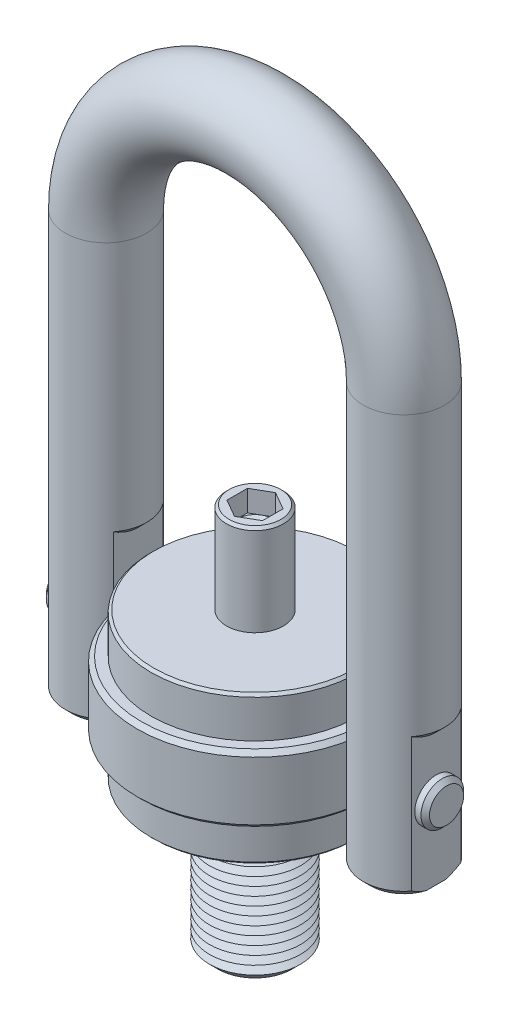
ISO-10303-21;
HEADER;
FILE_DESCRIPTION(('STEP AP214'),'2;1');
FILE_NAME('part.step','',(''),(''),'','','');
FILE_SCHEMA(('AUTOMOTIVE_DESIGN { 1 0 10303 214 1 1 1 1 }'));
ENDSEC;
DATA;
#1=APPLICATION_CONTEXT('core data for automotive mechanical design processes');
#2=APPLICATION_PROTOCOL_DEFINITION('international standard','automotive_design',2000,#1);
#3=PRODUCT_CONTEXT('',#1,'mechanical');
#4=PRODUCT('Part','Part','',(#3));
#5=PRODUCT_RELATED_PRODUCT_CATEGORY('part','',(#4));
#6=PRODUCT_DEFINITION_FORMATION('','',#4);
#7=PRODUCT_DEFINITION_CONTEXT('part definition',#1,'design');
#8=PRODUCT_DEFINITION('design','',#6,#7);
#9=PRODUCT_DEFINITION_SHAPE('','',#8);
#10=(LENGTH_UNIT() NAMED_UNIT(*) SI_UNIT(.MILLI.,.METRE.));
#11=(NAMED_UNIT(*) PLANE_ANGLE_UNIT() SI_UNIT($,.RADIAN.));
#12=(NAMED_UNIT(*) SI_UNIT($,.STERADIAN.) SOLID_ANGLE_UNIT());
#13=UNCERTAINTY_MEASURE_WITH_UNIT(LENGTH_MEASURE(1.E-05),#10,'distance_accuracy_value','');
#14=(GEOMETRIC_REPRESENTATION_CONTEXT(3) GLOBAL_UNCERTAINTY_ASSIGNED_CONTEXT((#13)) GLOBAL_UNIT_ASSIGNED_CONTEXT((#10,
#11,#12)) REPRESENTATION_CONTEXT('',''));
#15=CARTESIAN_POINT('',(0.,0.,0.));
#16=DIRECTION('',(0.,0.,1.));
#17=DIRECTION('',(1.,0.,0.));
#18=AXIS2_PLACEMENT_3D('',#15,#16,#17);
#19=CARTESIAN_POINT('',(134.7,0.,0.));
#20=DIRECTION('',(-1.,0.,0.));
#21=DIRECTION('',(0.,0.,1.));
#22=AXIS2_PLACEMENT_3D('',#19,#20,#21);
#23=CYLINDRICAL_SURFACE('',#22,15.);
#24=CARTESIAN_POINT('',(-131.7,0.,0.));
#25=DIRECTION('',(1.,0.,0.));
#26=DIRECTION('',(0.,0.,-1.));
#27=AXIS2_PLACEMENT_3D('',#24,#25,#26);
#28=CIRCLE('',#27,15.);
#29=CARTESIAN_POINT('',(-131.7,0.,-15.));
#30=VERTEX_POINT('',#29);
#31=EDGE_CURVE('P0_E25',#30,#30,#28,.T.);
#32=ORIENTED_EDGE('',*,*,#31,.T.);
#33=EDGE_LOOP('',(#32));
#34=FACE_BOUND('',#33,.T.);
#35=CARTESIAN_POINT('',(131.7,0.,0.));
#36=DIRECTION('',(1.,0.,0.));
#37=DIRECTION('',(0.,0.,-1.));
#38=AXIS2_PLACEMENT_3D('',#35,#36,#37);
#39=CIRCLE('',#38,15.);
#40=CARTESIAN_POINT('',(131.7,0.,15.));
#41=VERTEX_POINT('',#40);
#42=EDGE_CURVE('P0_E29',#41,#41,#39,.F.);
#43=ORIENTED_EDGE('',*,*,#42,.T.);
#44=EDGE_LOOP('',(#43));
#45=FACE_BOUND('',#44,.T.);
#46=ADVANCED_FACE('P0_F14',(#34,#45),#23,.T.);
#47=CARTESIAN_POINT('',(134.7,0.,0.));
#48=DIRECTION('',(1.,0.,0.));
#49=DIRECTION('',(0.,0.,-1.));
#50=AXIS2_PLACEMENT_3D('',#47,#48,#49);
#51=PLANE('',#50);
#52=CARTESIAN_POINT('',(134.7,0.,0.));
#53=DIRECTION('',(1.,0.,0.));
#54=DIRECTION('',(0.,0.,-1.));
#55=AXIS2_PLACEMENT_3D('',#52,#53,#54);
#56=CIRCLE('',#55,12.);
#57=CARTESIAN_POINT('',(134.7,0.,12.));
#58=VERTEX_POINT('',#57);
#59=EDGE_CURVE('P0_E10',#58,#58,#56,.T.);
#60=ORIENTED_EDGE('',*,*,#59,.T.);
#61=EDGE_LOOP('',(#60));
#62=FACE_BOUND('',#61,.T.);
#63=ADVANCED_FACE('P0_F46',(#62),#51,.T.);
#64=CARTESIAN_POINT('',(-134.7,0.,0.));
#65=DIRECTION('',(1.,0.,0.));
#66=DIRECTION('',(0.,0.,-1.));
#67=AXIS2_PLACEMENT_3D('',#64,#65,#66);
#68=PLANE('',#67);
#69=CARTESIAN_POINT('',(-134.7,0.,0.));
#70=DIRECTION('',(1.,0.,0.));
#71=DIRECTION('',(0.,0.,-1.));
#72=AXIS2_PLACEMENT_3D('',#69,#70,#71);
#73=CIRCLE('',#72,12.0000000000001);
#74=CARTESIAN_POINT('',(-134.7,0.,-12.0000000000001));
#75=VERTEX_POINT('',#74);
#76=EDGE_CURVE('P0_E21',#75,#75,#73,.F.);
#77=ORIENTED_EDGE('',*,*,#76,.T.);
#78=EDGE_LOOP('',(#77));
#79=FACE_BOUND('',#78,.T.);
#80=ADVANCED_FACE('P0_F43',(#79),#68,.F.);
#81=CARTESIAN_POINT('',(-131.7,0.,0.));
#82=DIRECTION('',(1.,0.,0.));
#83=DIRECTION('',(0.,0.,-1.));
#84=AXIS2_PLACEMENT_3D('',#81,#82,#83);
#85=CONICAL_SURFACE('',#84,15.,0.785398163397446);
#86=ORIENTED_EDGE('',*,*,#76,.F.);
#87=EDGE_LOOP('',(#86));
#88=FACE_BOUND('',#87,.T.);
#89=ORIENTED_EDGE('',*,*,#31,.F.);
#90=EDGE_LOOP('',(#89));
#91=FACE_BOUND('',#90,.T.);
#92=ADVANCED_FACE('P0_F38',(#88,#91),#85,.T.);
#93=CARTESIAN_POINT('',(134.7,0.,0.));
#94=DIRECTION('',(-1.,0.,0.));
#95=DIRECTION('',(0.,0.,1.));
#96=AXIS2_PLACEMENT_3D('',#93,#94,#95);
#97=CONICAL_SURFACE('',#96,12.,0.785398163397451);
#98=CARTESIAN_POINT('',(131.7,0.,15.));
#99=CARTESIAN_POINT('',(131.73125,0.,14.96875));
#100=CARTESIAN_POINT('',(131.7625,0.,14.9375));
#101=CARTESIAN_POINT('',(131.825,0.,14.875));
#102=CARTESIAN_POINT('',(131.85625,0.,14.84375));
#103=CARTESIAN_POINT('',(131.91875,0.,14.78125));
#104=CARTESIAN_POINT('',(131.95,0.,14.75));
#105=CARTESIAN_POINT('',(132.0125,0.,14.6875));
#106=CARTESIAN_POINT('',(132.04375,0.,14.65625));
#107=CARTESIAN_POINT('',(132.10625,0.,14.59375));
#108=CARTESIAN_POINT('',(132.1375,0.,14.5625));
#109=CARTESIAN_POINT('',(132.2,0.,14.5));
#110=CARTESIAN_POINT('',(132.23125,0.,14.46875));
#111=CARTESIAN_POINT('',(132.29375,0.,14.40625));
#112=CARTESIAN_POINT('',(132.325,0.,14.375));
#113=CARTESIAN_POINT('',(132.3875,0.,14.3125));
#114=CARTESIAN_POINT('',(132.41875,0.,14.28125));
#115=CARTESIAN_POINT('',(132.48125,0.,14.21875));
#116=CARTESIAN_POINT('',(132.5125,0.,14.1875));
#117=CARTESIAN_POINT('',(132.575,0.,14.125));
#118=CARTESIAN_POINT('',(132.60625,0.,14.09375));
#119=CARTESIAN_POINT('',(132.66875,0.,14.03125));
#120=CARTESIAN_POINT('',(132.7,0.,14.));
#121=CARTESIAN_POINT('',(132.7625,0.,13.9375));
#122=CARTESIAN_POINT('',(132.79375,0.,13.90625));
#123=CARTESIAN_POINT('',(132.85625,0.,13.84375));
#124=CARTESIAN_POINT('',(132.8875,0.,13.8125));
#125=CARTESIAN_POINT('',(132.95,0.,13.75));
#126=CARTESIAN_POINT('',(132.98125,0.,13.71875));
#127=CARTESIAN_POINT('',(133.04375,0.,13.65625));
#128=CARTESIAN_POINT('',(133.075,0.,13.625));
#129=CARTESIAN_POINT('',(133.1375,0.,13.5625));
#130=CARTESIAN_POINT('',(133.16875,0.,13.53125));
#131=CARTESIAN_POINT('',(133.23125,0.,13.46875));
#132=CARTESIAN_POINT('',(133.2625,0.,13.4375));
#133=CARTESIAN_POINT('',(133.325,0.,13.375));
#134=CARTESIAN_POINT('',(133.35625,0.,13.34375));
#135=CARTESIAN_POINT('',(133.41875,0.,13.28125));
#136=CARTESIAN_POINT('',(133.45,0.,13.25));
#137=CARTESIAN_POINT('',(133.5125,0.,13.1875));
#138=CARTESIAN_POINT('',(133.54375,0.,13.15625));
#139=CARTESIAN_POINT('',(133.60625,0.,13.09375));
#140=CARTESIAN_POINT('',(133.6375,0.,13.0625));
#141=CARTESIAN_POINT('',(133.7,0.,13.));
#142=CARTESIAN_POINT('',(133.73125,0.,12.96875));
#143=CARTESIAN_POINT('',(133.79375,0.,12.90625));
#144=CARTESIAN_POINT('',(133.825,0.,12.875));
#145=CARTESIAN_POINT('',(133.8875,0.,12.8125));
#146=CARTESIAN_POINT('',(133.91875,0.,12.78125));
#147=CARTESIAN_POINT('',(133.98125,0.,12.71875));
#148=CARTESIAN_POINT('',(134.0125,0.,12.6875));
#149=CARTESIAN_POINT('',(134.075,0.,12.625));
#150=CARTESIAN_POINT('',(134.10625,0.,12.59375));
#151=CARTESIAN_POINT('',(134.16875,0.,12.53125));
#152=CARTESIAN_POINT('',(134.2,0.,12.5));
#153=CARTESIAN_POINT('',(134.2625,0.,12.4375));
#154=CARTESIAN_POINT('',(134.29375,0.,12.40625));
#155=CARTESIAN_POINT('',(134.35625,0.,12.34375));
#156=CARTESIAN_POINT('',(134.3875,0.,12.3125));
#157=CARTESIAN_POINT('',(134.45,0.,12.25));
#158=CARTESIAN_POINT('',(134.48125,0.,12.21875));
#159=CARTESIAN_POINT('',(134.54375,0.,12.15625));
#160=CARTESIAN_POINT('',(134.575,0.,12.125));
#161=CARTESIAN_POINT('',(134.6375,0.,12.0625));
#162=CARTESIAN_POINT('',(134.66875,0.,12.03125));
#163=CARTESIAN_POINT('',(134.7,0.,12.));
#164=B_SPLINE_CURVE_WITH_KNOTS('',3,(#98,#99,#100,#101,#102,#103,#104,#105,#106,#107,#108,#109,
#110,#111,#112,#113,#114,#115,#116,#117,#118,#119,#120,#121,#122,#123,#124,#125,#126,#127,#128,
#129,#130,#131,#132,#133,#134,#135,#136,#137,#138,#139,#140,#141,#142,#143,#144,#145,#146,#147,
#148,#149,#150,#151,#152,#153,#154,#155,#156,#157,#158,#159,#160,#161,#162,#163),.UNSPECIFIED.,
.F.,.F.,(4,2,2,2,2,2,2,2,2,2,2,2,2,2,2,2,2,2,2,2,2,2,2,2,2,2,2,2,2,2,2,2,4),(0.,
0.132582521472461,0.265165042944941,0.397747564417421,0.5303300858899,0.66291260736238,
0.795495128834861,0.92807765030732,1.0606601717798,1.19324269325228,1.32582521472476,
1.45840773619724,1.59099025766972,1.72357277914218,1.85615530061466,1.98873782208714,
2.12132034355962,2.2539028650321,2.38648538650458,2.51906790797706,2.65165042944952,
2.784232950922,2.91681547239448,3.04939799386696,3.18198051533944,3.31456303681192,
3.44714555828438,3.57972807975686,3.71231060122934,3.84489312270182,3.9774756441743,
4.11005816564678,4.24264068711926),.UNSPECIFIED.);
#165=EDGE_CURVE('P0_BSEAM16',#41,#58,#164,.T.);
#166=ORIENTED_EDGE('',*,*,#42,.F.);
#167=ORIENTED_EDGE('',*,*,#59,.F.);
#168=ORIENTED_EDGE('',*,*,#165,.T.);
#169=ORIENTED_EDGE('',*,*,#165,.F.);
#170=EDGE_LOOP('',(#166,#168,#167,#169));
#171=FACE_BOUND('',#170,.T.);
#172=ADVANCED_FACE('P0_F16',(#171),#97,.T.);
#173=CLOSED_SHELL('',(#46,#63,#80,#92,#172));
#174=MANIFOLD_SOLID_BREP('P0_B1',#173);
#175=CARTESIAN_POINT('',(104.75,-52.,0.));
#176=DIRECTION('',(0.,-1.,0.));
#177=DIRECTION('',(0.,0.,1.));
#178=AXIS2_PLACEMENT_3D('',#175,#176,#177);
#179=PLANE('',#178);
#180=DIRECTION('',(0.,0.,-1.));
#181=VECTOR('',#180,1.);
#182=CARTESIAN_POINT('',(82.1289920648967,-52.,17.5));
#183=LINE('',#182,#181);
#184=CARTESIAN_POINT('',(82.1289920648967,-52.,6.72681202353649));
#185=VERTEX_POINT('',#184);
#186=CARTESIAN_POINT('',(82.1289920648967,-52.,-6.72681202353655));
#187=VERTEX_POINT('',#186);
#188=EDGE_CURVE('P1_E132',#185,#187,#183,.T.);
#189=ORIENTED_EDGE('',*,*,#188,.T.);
#190=CARTESIAN_POINT('',(104.75,-52.,0.));
#191=DIRECTION('',(0.,-1.,0.));
#192=DIRECTION('',(1.,0.,0.));
#193=AXIS2_PLACEMENT_3D('',#190,#191,#192);
#194=CIRCLE('',#193,23.6000000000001);
#195=CARTESIAN_POINT('',(127.371007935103,-52.,-6.72681202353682));
#196=VERTEX_POINT('',#195);
#197=EDGE_CURVE('P1_E192',#187,#196,#194,.T.);
#198=ORIENTED_EDGE('',*,*,#197,.T.);
#199=DIRECTION('',(0.,0.,1.));
#200=VECTOR('',#199,1.);
#201=CARTESIAN_POINT('',(127.371007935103,-52.,17.5));
#202=LINE('',#201,#200);
#203=CARTESIAN_POINT('',(127.371007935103,-52.,6.72681202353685));
#204=VERTEX_POINT('',#203);
#205=EDGE_CURVE('P1_E315',#196,#204,#202,.T.);
#206=ORIENTED_EDGE('',*,*,#205,.T.);
#207=CARTESIAN_POINT('',(104.75,-52.,0.));
#208=DIRECTION('',(0.,-1.,0.));
#209=DIRECTION('',(1.,0.,0.));
#210=AXIS2_PLACEMENT_3D('',#207,#208,#209);
#211=CIRCLE('',#210,23.6000000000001);
#212=CARTESIAN_POINT('',(104.75,-52.,23.6));
#213=VERTEX_POINT('',#212);
#214=EDGE_CURVE('P1_E370',#204,#213,#211,.T.);
#215=ORIENTED_EDGE('',*,*,#214,.T.);
#216=CARTESIAN_POINT('',(104.75,-52.,0.));
#217=DIRECTION('',(0.,-1.,0.));
#218=DIRECTION('',(1.,0.,0.));
#219=AXIS2_PLACEMENT_3D('',#216,#217,#218);
#220=CIRCLE('',#219,23.6);
#221=EDGE_CURVE('P1_E369',#213,#185,#220,.T.);
#222=ORIENTED_EDGE('',*,*,#221,.T.);
#223=EDGE_LOOP('',(#189,#198,#206,#215,#222));
#224=FACE_BOUND('',#223,.T.);
#225=ADVANCED_FACE('P1_F16',(#224),#179,.T.);
#226=CARTESIAN_POINT('',(104.75,243.15,0.));
#227=DIRECTION('',(0.,-1.,0.));
#228=DIRECTION('',(1.,0.,0.));
#229=AXIS2_PLACEMENT_3D('',#226,#227,#228);
#230=CYLINDRICAL_SURFACE('',#229,28.6);
#231=CARTESIAN_POINT('',(104.75,243.15,0.));
#232=DIRECTION('',(0.,-1.,0.));
#233=DIRECTION('',(0.,0.,1.));
#234=AXIS2_PLACEMENT_3D('',#231,#232,#233);
#235=CIRCLE('',#234,28.6);
#236=CARTESIAN_POINT('',(133.35,243.15,0.));
#237=VERTEX_POINT('',#236);
#238=EDGE_CURVE('P1_E143',#237,#237,#235,.T.);
#239=ORIENTED_EDGE('',*,*,#238,.T.);
#240=EDGE_LOOP('',(#239));
#241=FACE_BOUND('',#240,.T.);
#242=DIRECTION('',(0.,-1.,0.));
#243=VECTOR('',#242,1.);
#244=CARTESIAN_POINT('',(127.371007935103,38.,-17.5));
#245=LINE('',#244,#243);
#246=CARTESIAN_POINT('',(127.371007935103,47.0000000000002,-17.5));
#247=VERTEX_POINT('',#246);
#248=CARTESIAN_POINT('',(127.371007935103,-47.,-17.5));
#249=VERTEX_POINT('',#248);
#250=EDGE_CURVE('P1_E328',#247,#249,#245,.T.);
#251=ORIENTED_EDGE('',*,*,#250,.T.);
#252=CARTESIAN_POINT('',(104.75,-47.,0.));
#253=DIRECTION('',(0.,-1.,0.));
#254=DIRECTION('',(0.,0.,-1.));
#255=AXIS2_PLACEMENT_3D('',#252,#253,#254);
#256=CIRCLE('',#255,28.6);
#257=CARTESIAN_POINT('',(82.1289920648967,-47.,-17.5));
#258=VERTEX_POINT('',#257);
#259=EDGE_CURVE('P1_E128',#249,#258,#256,.F.);
#260=ORIENTED_EDGE('',*,*,#259,.T.);
#261=DIRECTION('',(0.,-1.,0.));
#262=VECTOR('',#261,1.);
#263=CARTESIAN_POINT('',(82.1289920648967,58.,-17.5));
#264=LINE('',#263,#262);
#265=CARTESIAN_POINT('',(82.1289920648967,67.0000000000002,-17.5));
#266=VERTEX_POINT('',#265);
#267=EDGE_CURVE('P1_E120',#266,#258,#264,.T.);
#268=ORIENTED_EDGE('',*,*,#267,.F.);
#269=CARTESIAN_POINT('',(104.75,67.0000000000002,0.));
#270=DIRECTION('',(0.,-1.,0.));
#271=DIRECTION('',(0.,0.,-1.));
#272=AXIS2_PLACEMENT_3D('',#269,#270,#271);
#273=CIRCLE('',#272,28.6);
#274=CARTESIAN_POINT('',(82.1289920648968,67.0000000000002,17.5));
#275=VERTEX_POINT('',#274);
#276=EDGE_CURVE('P1_E126',#266,#275,#273,.F.);
#277=ORIENTED_EDGE('',*,*,#276,.T.);
#278=DIRECTION('',(0.,-1.,0.));
#279=VECTOR('',#278,1.);
#280=CARTESIAN_POINT('',(82.1289920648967,58.,17.5));
#281=LINE('',#280,#279);
#282=CARTESIAN_POINT('',(82.1289920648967,-47.,17.5));
#283=VERTEX_POINT('',#282);
#284=EDGE_CURVE('P1_E131',#275,#283,#281,.T.);
#285=ORIENTED_EDGE('',*,*,#284,.T.);
#286=CARTESIAN_POINT('',(104.75,-47.,0.));
#287=DIRECTION('',(0.,-1.,0.));
#288=DIRECTION('',(0.,0.,-1.));
#289=AXIS2_PLACEMENT_3D('',#286,#287,#288);
#290=CIRCLE('',#289,28.6);
#291=CARTESIAN_POINT('',(104.75,-47.,28.6));
#292=VERTEX_POINT('',#291);
#293=EDGE_CURVE('P1_E530',#283,#292,#290,.F.);
#294=ORIENTED_EDGE('',*,*,#293,.T.);
#295=CARTESIAN_POINT('',(104.75,-47.,0.));
#296=DIRECTION('',(0.,-1.,0.));
#297=DIRECTION('',(0.,0.,-1.));
#298=AXIS2_PLACEMENT_3D('',#295,#296,#297);
#299=CIRCLE('',#298,28.6);
#300=CARTESIAN_POINT('',(127.371007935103,-47.,17.5));
#301=VERTEX_POINT('',#300);
#302=EDGE_CURVE('P1_E528',#292,#301,#299,.F.);
#303=ORIENTED_EDGE('',*,*,#302,.T.);
#304=DIRECTION('',(0.,-1.,0.));
#305=VECTOR('',#304,1.);
#306=CARTESIAN_POINT('',(127.371007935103,38.,17.5));
#307=LINE('',#306,#305);
#308=CARTESIAN_POINT('',(127.371007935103,47.0000000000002,17.5));
#309=VERTEX_POINT('',#308);
#310=EDGE_CURVE('P1_E327',#309,#301,#307,.T.);
#311=ORIENTED_EDGE('',*,*,#310,.F.);
#312=CARTESIAN_POINT('',(104.75,47.0000000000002,0.));
#313=DIRECTION('',(0.,-1.,0.));
#314=DIRECTION('',(0.,0.,-1.));
#315=AXIS2_PLACEMENT_3D('',#312,#313,#314);
#316=CIRCLE('',#315,28.6);
#317=EDGE_CURVE('P1_E142',#309,#247,#316,.F.);
#318=ORIENTED_EDGE('',*,*,#317,.T.);
#319=EDGE_LOOP('',(#251,#260,#268,#277,#285,#294,#303,#311,#318));
#320=FACE_BOUND('',#319,.T.);
#321=ADVANCED_FACE('P1_F123',(#241,#320),#230,.T.);
#322=CARTESIAN_POINT('',(-104.75,-52.,0.));
#323=DIRECTION('',(0.,1.,0.));
#324=DIRECTION('',(0.,0.,1.));
#325=AXIS2_PLACEMENT_3D('',#322,#323,#324);
#326=PLANE('',#325);
#327=DIRECTION('',(0.,0.,1.));
#328=VECTOR('',#327,1.);
#329=CARTESIAN_POINT('',(-127.371007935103,-52.,17.5));
#330=LINE('',#329,#328);
#331=CARTESIAN_POINT('',(-127.371007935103,-52.,-6.72681202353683));
#332=VERTEX_POINT('',#331);
#333=CARTESIAN_POINT('',(-127.371007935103,-52.,6.72681202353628));
#334=VERTEX_POINT('',#333);
#335=EDGE_CURVE('P1_E334',#332,#334,#330,.T.);
#336=ORIENTED_EDGE('',*,*,#335,.F.);
#337=CARTESIAN_POINT('',(-104.75,-52.,0.));
#338=DIRECTION('',(0.,1.,0.));
#339=DIRECTION('',(0.,0.,1.));
#340=AXIS2_PLACEMENT_3D('',#337,#338,#339);
#341=CIRCLE('',#340,23.6000000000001);
#342=CARTESIAN_POINT('',(-82.1289920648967,-52.,-6.72681202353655));
#343=VERTEX_POINT('',#342);
#344=EDGE_CURVE('P1_E40',#332,#343,#341,.F.);
#345=ORIENTED_EDGE('',*,*,#344,.T.);
#346=DIRECTION('',(0.,0.,-1.));
#347=VECTOR('',#346,1.);
#348=CARTESIAN_POINT('',(-82.1289920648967,-52.,17.5));
#349=LINE('',#348,#347);
#350=CARTESIAN_POINT('',(-82.1289920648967,-52.,6.72681202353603));
#351=VERTEX_POINT('',#350);
#352=EDGE_CURVE('P1_E303',#351,#343,#349,.T.);
#353=ORIENTED_EDGE('',*,*,#352,.F.);
#354=CARTESIAN_POINT('',(-104.75,-52.,0.));
#355=DIRECTION('',(0.,1.,0.));
#356=DIRECTION('',(0.,0.,1.));
#357=AXIS2_PLACEMENT_3D('',#354,#355,#356);
#358=CIRCLE('',#357,23.5999999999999);
#359=CARTESIAN_POINT('',(-104.75,-52.,23.5999999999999));
#360=VERTEX_POINT('',#359);
#361=EDGE_CURVE('P1_E34',#351,#360,#358,.F.);
#362=ORIENTED_EDGE('',*,*,#361,.T.);
#363=CARTESIAN_POINT('',(-104.75,-52.,0.));
#364=DIRECTION('',(0.,1.,0.));
#365=DIRECTION('',(0.,0.,1.));
#366=AXIS2_PLACEMENT_3D('',#363,#364,#365);
#367=CIRCLE('',#366,23.5999999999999);
#368=EDGE_CURVE('P1_E298',#360,#334,#367,.F.);
#369=ORIENTED_EDGE('',*,*,#368,.T.);
#370=EDGE_LOOP('',(#336,#345,#353,#362,#369));
#371=FACE_BOUND('',#370,.T.);
#372=ADVANCED_FACE('P1_F239',(#371),#326,.F.);
#373=CARTESIAN_POINT('',(-104.75,-52.,0.));
#374=DIRECTION('',(0.,1.,0.));
#375=DIRECTION('',(-1.,0.,0.));
#376=AXIS2_PLACEMENT_3D('',#373,#374,#375);
#377=CYLINDRICAL_SURFACE('',#376,28.6);
#378=DIRECTION('',(0.,-1.,0.));
#379=VECTOR('',#378,1.);
#380=CARTESIAN_POINT('',(-82.1289920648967,58.,-17.5));
#381=LINE('',#380,#379);
#382=CARTESIAN_POINT('',(-82.1289920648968,67.0000000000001,-17.5));
#383=VERTEX_POINT('',#382);
#384=CARTESIAN_POINT('',(-82.1289920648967,-47.,-17.5));
#385=VERTEX_POINT('',#384);
#386=EDGE_CURVE('P1_E340',#383,#385,#381,.T.);
#387=ORIENTED_EDGE('',*,*,#386,.T.);
#388=CARTESIAN_POINT('',(-104.75,-47.,0.));
#389=DIRECTION('',(0.,1.,0.));
#390=DIRECTION('',(0.,0.,1.));
#391=AXIS2_PLACEMENT_3D('',#388,#389,#390);
#392=CIRCLE('',#391,28.6);
#393=CARTESIAN_POINT('',(-127.371007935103,-47.,-17.5));
#394=VERTEX_POINT('',#393);
#395=EDGE_CURVE('P1_E287',#385,#394,#392,.T.);
#396=ORIENTED_EDGE('',*,*,#395,.T.);
#397=DIRECTION('',(0.,-1.,0.));
#398=VECTOR('',#397,1.);
#399=CARTESIAN_POINT('',(-127.371007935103,38.,-17.5));
#400=LINE('',#399,#398);
#401=CARTESIAN_POINT('',(-127.371007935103,47.0000000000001,-17.5));
#402=VERTEX_POINT('',#401);
#403=EDGE_CURVE('P1_E337',#402,#394,#400,.T.);
#404=ORIENTED_EDGE('',*,*,#403,.F.);
#405=CARTESIAN_POINT('',(-104.75,47.0000000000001,0.));
#406=DIRECTION('',(0.,-1.,0.));
#407=DIRECTION('',(0.,0.,-1.));
#408=AXIS2_PLACEMENT_3D('',#405,#406,#407);
#409=CIRCLE('',#408,28.6);
#410=CARTESIAN_POINT('',(-127.371007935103,47.0000000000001,17.5));
#411=VERTEX_POINT('',#410);
#412=EDGE_CURVE('P1_E146',#402,#411,#409,.F.);
#413=ORIENTED_EDGE('',*,*,#412,.T.);
#414=DIRECTION('',(0.,-1.,0.));
#415=VECTOR('',#414,1.);
#416=CARTESIAN_POINT('',(-127.371007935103,38.,17.5));
#417=LINE('',#416,#415);
#418=CARTESIAN_POINT('',(-127.371007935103,-46.9999999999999,17.5));
#419=VERTEX_POINT('',#418);
#420=EDGE_CURVE('P1_E308',#411,#419,#417,.T.);
#421=ORIENTED_EDGE('',*,*,#420,.T.);
#422=CARTESIAN_POINT('',(-104.75,-47.,0.));
#423=DIRECTION('',(0.,1.,0.));
#424=DIRECTION('',(0.,0.,1.));
#425=AXIS2_PLACEMENT_3D('',#422,#423,#424);
#426=CIRCLE('',#425,28.6);
#427=CARTESIAN_POINT('',(-104.75,-47.,28.6));
#428=VERTEX_POINT('',#427);
#429=EDGE_CURVE('P1_E284',#419,#428,#426,.T.);
#430=ORIENTED_EDGE('',*,*,#429,.T.);
#431=CARTESIAN_POINT('',(-104.75,-47.,0.));
#432=DIRECTION('',(0.,1.,0.));
#433=DIRECTION('',(0.,0.,1.));
#434=AXIS2_PLACEMENT_3D('',#431,#432,#433);
#435=CIRCLE('',#434,28.6);
#436=CARTESIAN_POINT('',(-82.1289920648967,-47.,17.5));
#437=VERTEX_POINT('',#436);
#438=EDGE_CURVE('P1_E277',#428,#437,#435,.T.);
#439=ORIENTED_EDGE('',*,*,#438,.T.);
#440=DIRECTION('',(0.,-1.,0.));
#441=VECTOR('',#440,1.);
#442=CARTESIAN_POINT('',(-82.1289920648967,58.,17.5));
#443=LINE('',#442,#441);
#444=CARTESIAN_POINT('',(-82.1289920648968,67.0000000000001,17.5));
#445=VERTEX_POINT('',#444);
#446=EDGE_CURVE('P1_E305',#445,#437,#443,.T.);
#447=ORIENTED_EDGE('',*,*,#446,.F.);
#448=CARTESIAN_POINT('',(-104.75,67.0000000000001,0.));
#449=DIRECTION('',(0.,-1.,0.));
#450=DIRECTION('',(0.,0.,-1.));
#451=AXIS2_PLACEMENT_3D('',#448,#449,#450);
#452=CIRCLE('',#451,28.6);
#453=EDGE_CURVE('P1_E155',#445,#383,#452,.F.);
#454=ORIENTED_EDGE('',*,*,#453,.T.);
#455=EDGE_LOOP('',(#387,#396,#404,#413,#421,#430,#439,#447,#454));
#456=FACE_BOUND('',#455,.T.);
#457=CARTESIAN_POINT('',(-104.75,243.15,0.));
#458=DIRECTION('',(0.,1.,0.));
#459=DIRECTION('',(0.,0.,1.));
#460=AXIS2_PLACEMENT_3D('',#457,#458,#459);
#461=CIRCLE('',#460,28.6);
#462=CARTESIAN_POINT('',(-133.35,243.15,0.));
#463=VERTEX_POINT('',#462);
#464=EDGE_CURVE('P1_E149',#463,#463,#461,.T.);
#465=ORIENTED_EDGE('',*,*,#464,.F.);
#466=EDGE_LOOP('',(#465));
#467=FACE_BOUND('',#466,.T.);
#468=ADVANCED_FACE('P1_F241',(#456,#467),#377,.T.);
#469=CARTESIAN_POINT('',(0.,243.15,0.));
#470=DIRECTION('',(0.,0.,-1.));
#471=DIRECTION('',(-1.,0.,0.));
#472=AXIS2_PLACEMENT_3D('',#469,#470,#471);
#473=TOROIDAL_SURFACE('',#472,104.75,28.6);
#474=CARTESIAN_POINT('',(0.,243.15,0.));
#475=DIRECTION('',(0.,0.,-1.));
#476=DIRECTION('',(-1.,0.,0.));
#477=AXIS2_PLACEMENT_3D('',#474,#475,#476);
#478=CIRCLE('',#477,133.35);
#479=EDGE_CURVE('',#463,#237,#478,.T.);
#480=ORIENTED_EDGE('',*,*,#464,.T.);
#481=ORIENTED_EDGE('',*,*,#238,.F.);
#482=ORIENTED_EDGE('',*,*,#479,.T.);
#483=ORIENTED_EDGE('',*,*,#479,.F.);
#484=EDGE_LOOP('',(#480,#482,#481,#483));
#485=FACE_BOUND('',#484,.T.);
#486=ADVANCED_FACE('P1_F237',(#485),#473,.T.);
#487=CARTESIAN_POINT('',(-82.1289920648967,58.,17.5));
#488=DIRECTION('',(-1.,0.,0.));
#489=DIRECTION('',(0.,0.,1.));
#490=AXIS2_PLACEMENT_3D('',#487,#488,#489);
#491=PLANE('',#490);
#492=CARTESIAN_POINT('',(-82.1289920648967,0.,0.));
#493=DIRECTION('',(-1.,0.,0.));
#494=DIRECTION('',(0.,0.,1.));
#495=AXIS2_PLACEMENT_3D('',#492,#493,#494);
#496=CIRCLE('',#495,15.);
#497=CARTESIAN_POINT('',(-82.1289920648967,0.,15.));
#498=VERTEX_POINT('',#497);
#499=EDGE_CURVE('P1_E313',#498,#498,#496,.T.);
#500=ORIENTED_EDGE('',*,*,#499,.T.);
#501=EDGE_LOOP('',(#500));
#502=FACE_BOUND('',#501,.T.);
#503=ORIENTED_EDGE('',*,*,#352,.T.);
#504=CARTESIAN_POINT('',(-82.1289920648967,-52.,-6.72681202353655));
#505=CARTESIAN_POINT('',(-82.1289920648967,-51.8634518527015,-7.20586182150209));
#506=CARTESIAN_POINT('',(-82.1289920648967,-51.7145478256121,-7.68125439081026));
#507=CARTESIAN_POINT('',(-82.1289920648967,-51.394783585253,-8.62433990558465));
#508=CARTESIAN_POINT('',(-82.1289920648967,-51.2239349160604,-9.0920367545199));
#509=CARTESIAN_POINT('',(-82.1289920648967,-50.8636824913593,-10.0178069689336));
#510=CARTESIAN_POINT('',(-82.1289920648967,-50.6743636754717,-10.4759136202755));
#511=CARTESIAN_POINT('',(-82.1289920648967,-50.2789113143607,-11.3848588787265));
#512=CARTESIAN_POINT('',(-82.1289920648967,-50.072775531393,-11.8356965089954));
#513=CARTESIAN_POINT('',(-82.1289920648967,-49.6461858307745,-12.7296721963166));
#514=CARTESIAN_POINT('',(-82.1289920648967,-49.4257543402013,-13.1728209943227));
#515=CARTESIAN_POINT('',(-82.1289920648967,-48.9721602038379,-14.0525390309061));
#516=CARTESIAN_POINT('',(-82.1289920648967,-48.7389975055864,-14.4891082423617));
#517=CARTESIAN_POINT('',(-82.1289920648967,-48.2604945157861,-15.3580870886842));
#518=CARTESIAN_POINT('',(-82.1289920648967,-48.0151037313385,-15.7904688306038));
#519=CARTESIAN_POINT('',(-82.1289920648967,-47.5145475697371,-16.6494406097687));
#520=CARTESIAN_POINT('',(-82.1289920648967,-47.2593839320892,-17.0760316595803));
#521=CARTESIAN_POINT('',(-82.1289920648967,-47.,-17.4999999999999));
#522=B_SPLINE_CURVE_WITH_KNOTS('',3,(#504,#505,#506,#507,#508,#509,#510,#511,#512,#513,#514,
#515,#516,#517,#518,#519,#520,#521),.UNSPECIFIED.,.F.,.F.,(4,2,2,2,2,2,2,2,4),(0.,
1.49403678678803,2.98729082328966,4.47397531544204,5.96085795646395,7.44546190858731,
8.9300719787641,10.4214240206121,11.9125118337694),.UNSPECIFIED.);
#523=EDGE_CURVE('P1_E11',#343,#385,#522,.T.);
#524=ORIENTED_EDGE('',*,*,#523,.T.);
#525=ORIENTED_EDGE('',*,*,#386,.F.);
#526=CARTESIAN_POINT('',(-82.1289920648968,67.0000000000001,-17.5));
#527=CARTESIAN_POINT('',(-82.1289920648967,66.741161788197,-17.0769239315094));
#528=CARTESIAN_POINT('',(-82.1289920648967,66.4865268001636,-16.6512369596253));
#529=CARTESIAN_POINT('',(-82.1289920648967,65.9869689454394,-15.7940728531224));
#530=CARTESIAN_POINT('',(-82.1289920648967,65.7420483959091,-15.3625943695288));
#531=CARTESIAN_POINT('',(-82.1289920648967,65.2623938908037,-14.4917447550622));
#532=CARTESIAN_POINT('',(-82.1289920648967,65.027704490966,-14.0523489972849));
#533=CARTESIAN_POINT('',(-82.1289920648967,64.5712412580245,-13.1669212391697));
#534=CARTESIAN_POINT('',(-82.1289920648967,64.3494666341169,-12.7208896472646));
#535=CARTESIAN_POINT('',(-82.1289920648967,63.9168315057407,-11.8135737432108));
#536=CARTESIAN_POINT('',(-82.1289920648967,63.7062416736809,-11.3521595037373));
#537=CARTESIAN_POINT('',(-82.1289920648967,63.3027204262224,-10.4216751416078));
#538=CARTESIAN_POINT('',(-82.1289920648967,63.1097903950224,-9.9526044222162));
#539=CARTESIAN_POINT('',(-82.1289920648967,62.5618917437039,-8.53495825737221));
#540=CARTESIAN_POINT('',(-82.1289920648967,62.236998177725,-7.57427691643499));
#541=CARTESIAN_POINT('',(-82.1289920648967,61.7811143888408,-5.94631722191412));
#542=CARTESIAN_POINT('',(-82.1289920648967,61.6215304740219,-5.28705627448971));
#543=CARTESIAN_POINT('',(-82.1289920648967,61.4219283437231,-4.29015521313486));
#544=CARTESIAN_POINT('',(-82.1289920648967,61.3620152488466,-3.95645232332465));
#545=CARTESIAN_POINT('',(-82.1289920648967,61.2561627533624,-3.28685047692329));
#546=CARTESIAN_POINT('',(-82.1289920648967,61.2102220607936,-2.9509517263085));
#547=CARTESIAN_POINT('',(-82.1289920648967,61.1331807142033,-2.2798743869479));
#548=CARTESIAN_POINT('',(-82.1289920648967,61.1019768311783,-1.94470766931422));
#549=CARTESIAN_POINT('',(-82.1289920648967,61.0543451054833,-1.27335690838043));
#550=CARTESIAN_POINT('',(-82.1289920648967,61.0379156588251,-0.937172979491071));
#551=CARTESIAN_POINT('',(-82.1289920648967,61.0200570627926,-0.264532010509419));
#552=CARTESIAN_POINT('',(-82.1289920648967,61.0186223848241,0.0719248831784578));
#553=CARTESIAN_POINT('',(-82.1289920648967,61.0307599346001,0.744531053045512));
#554=CARTESIAN_POINT('',(-82.1289920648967,61.0443301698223,1.08068036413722));
#555=CARTESIAN_POINT('',(-82.1289920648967,61.07804668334,1.62026282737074));
#556=CARTESIAN_POINT('',(-82.1289920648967,61.0935210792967,1.82399960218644));
#557=CARTESIAN_POINT('',(-82.1289920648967,61.1298498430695,2.23095119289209));
#558=CARTESIAN_POINT('',(-82.1289920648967,61.1507031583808,2.43416610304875));
#559=CARTESIAN_POINT('',(-82.1289920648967,61.2212117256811,3.0430606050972));
#560=CARTESIAN_POINT('',(-82.1289920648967,61.2788064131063,3.44784484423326));
#561=CARTESIAN_POINT('',(-82.1289920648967,61.4154331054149,4.2619725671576));
#562=CARTESIAN_POINT('',(-82.1289920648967,61.4948661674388,4.6712481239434));
#563=CARTESIAN_POINT('',(-82.1289920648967,61.6732328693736,5.48555296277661));
#564=CARTESIAN_POINT('',(-82.1289920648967,61.7721693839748,5.89058160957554));
#565=CARTESIAN_POINT('',(-82.1289920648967,62.0960750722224,7.0990354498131));
#566=CARTESIAN_POINT('',(-82.1289920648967,62.348049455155,7.89530772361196));
#567=CARTESIAN_POINT('',(-82.1289920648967,62.9121674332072,9.4699634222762));
#568=CARTESIAN_POINT('',(-82.1289920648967,63.2245869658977,10.2482457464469));
#569=CARTESIAN_POINT('',(-82.1289920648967,63.8968152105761,11.7836292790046));
#570=CARTESIAN_POINT('',(-82.1289920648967,64.2566095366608,12.540736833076));
#571=CARTESIAN_POINT('',(-82.1289920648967,64.8178785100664,13.6488378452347));
#572=CARTESIAN_POINT('',(-82.1289920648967,65.0049395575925,14.007256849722));
#573=CARTESIAN_POINT('',(-82.1289920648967,65.3869110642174,14.7198462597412));
#574=CARTESIAN_POINT('',(-82.1289920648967,65.58182062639,15.0740171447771));
#575=CARTESIAN_POINT('',(-82.1289920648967,65.9770796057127,15.7755721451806));
#576=CARTESIAN_POINT('',(-82.1289920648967,66.1773730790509,16.1229878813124));
#577=CARTESIAN_POINT('',(-82.1289920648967,66.5841891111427,16.8141711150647));
#578=CARTESIAN_POINT('',(-82.1289920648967,66.7907118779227,17.1579384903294));
#579=CARTESIAN_POINT('',(-82.1289920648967,67.0000000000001,17.4999999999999));
#580=B_SPLINE_CURVE_WITH_KNOTS('',3,(#526,#527,#528,#529,#530,#531,#532,#533,#534,#535,#536,
#537,#538,#539,#540,#541,#542,#543,#544,#545,#546,#547,#548,#549,#550,#551,#552,#553,#554,#555,
#556,#557,#558,#559,#560,#561,#562,#563,#564,#565,#566,#567,#568,#569,#570,#571,#572,#573,#574,
#575,#576,#577,#578,#579),.UNSPECIFIED.,.F.,.F.,(4,2,2,2,2,2,2,2,2,2,2,2,2,2,2,2,2,2,2,2,2,2,2,
2,2,2,4),(0.,1.48794802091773,2.97624884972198,4.47048947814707,5.96463851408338,
7.48586880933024,9.00721823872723,12.0443504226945,14.0772515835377,15.0941093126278,
16.1108729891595,17.1204047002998,18.129826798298,19.138876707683,20.1477926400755,
20.7606970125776,21.3734815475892,22.5994863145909,23.8497133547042,25.1001248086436,
27.6025277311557,30.1166360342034,32.6299826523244,33.8428031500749,35.0554854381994,
36.2584732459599,37.4615012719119),.UNSPECIFIED.);
#581=EDGE_CURVE('P1_E138',#383,#445,#580,.T.);
#582=ORIENTED_EDGE('',*,*,#581,.T.);
#583=ORIENTED_EDGE('',*,*,#446,.T.);
#584=CARTESIAN_POINT('',(-82.1289920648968,-47.,17.4999999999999));
#585=CARTESIAN_POINT('',(-82.1289920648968,-47.2593839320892,17.0760316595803));
#586=CARTESIAN_POINT('',(-82.1289920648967,-47.514547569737,16.6494406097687));
#587=CARTESIAN_POINT('',(-82.1289920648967,-48.0151037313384,15.7904688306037));
#588=CARTESIAN_POINT('',(-82.1289920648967,-48.2604945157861,15.358087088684));
#589=CARTESIAN_POINT('',(-82.1289920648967,-48.7389975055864,14.4891082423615));
#590=CARTESIAN_POINT('',(-82.1289920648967,-48.9721602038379,14.052539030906));
#591=CARTESIAN_POINT('',(-82.1289920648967,-49.4257543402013,13.1728209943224));
#592=CARTESIAN_POINT('',(-82.1289920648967,-49.6461858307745,12.7296721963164));
#593=CARTESIAN_POINT('',(-82.1289920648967,-50.072775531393,11.8356965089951));
#594=CARTESIAN_POINT('',(-82.1289920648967,-50.2789113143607,11.3848588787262));
#595=CARTESIAN_POINT('',(-82.1289920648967,-50.6743636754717,10.4759136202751));
#596=CARTESIAN_POINT('',(-82.1289920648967,-50.8636824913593,10.0178069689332));
#597=CARTESIAN_POINT('',(-82.1289920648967,-51.2239349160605,9.0920367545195));
#598=CARTESIAN_POINT('',(-82.1289920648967,-51.394783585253,8.62433990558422));
#599=CARTESIAN_POINT('',(-82.1289920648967,-51.7145478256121,7.68125439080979));
#600=CARTESIAN_POINT('',(-82.1289920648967,-51.8634518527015,7.20586182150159));
#601=CARTESIAN_POINT('',(-82.1289920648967,-52.,6.72681202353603));
#602=B_SPLINE_CURVE_WITH_KNOTS('',3,(#584,#585,#586,#587,#588,#589,#590,#591,#592,#593,#594,
#595,#596,#597,#598,#599,#600,#601),.UNSPECIFIED.,.F.,.F.,(4,2,2,2,2,2,2,2,4),(0.,
1.4910878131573,2.9824398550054,4.46704992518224,5.95165387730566,7.43853651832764,
8.92522101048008,10.4184750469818,11.9125118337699),.UNSPECIFIED.);
#603=EDGE_CURVE('P1_E26',#437,#351,#602,.T.);
#604=ORIENTED_EDGE('',*,*,#603,.T.);
#605=EDGE_LOOP('',(#503,#524,#525,#582,#583,#604));
#606=FACE_BOUND('',#605,.T.);
#607=ADVANCED_FACE('P1_F232',(#502,#606),#491,.F.);
#608=CARTESIAN_POINT('',(-127.371007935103,38.,17.5));
#609=DIRECTION('',(1.,0.,0.));
#610=DIRECTION('',(0.,0.,-1.));
#611=AXIS2_PLACEMENT_3D('',#608,#609,#610);
#612=PLANE('',#611);
#613=CARTESIAN_POINT('',(-127.371007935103,0.,0.));
#614=DIRECTION('',(1.,0.,0.));
#615=DIRECTION('',(0.,0.,-1.));
#616=AXIS2_PLACEMENT_3D('',#613,#614,#615);
#617=CIRCLE('',#616,15.);
#618=CARTESIAN_POINT('',(-127.371007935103,0.,-15.));
#619=VERTEX_POINT('',#618);
#620=EDGE_CURVE('P1_E321',#619,#619,#617,.F.);
#621=ORIENTED_EDGE('',*,*,#620,.F.);
#622=EDGE_LOOP('',(#621));
#623=FACE_BOUND('',#622,.T.);
#624=ORIENTED_EDGE('',*,*,#403,.T.);
#625=CARTESIAN_POINT('',(-127.371007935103,-47.,-17.5));
#626=CARTESIAN_POINT('',(-127.371007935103,-47.2593839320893,-17.0760316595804));
#627=CARTESIAN_POINT('',(-127.371007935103,-47.5145475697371,-16.6494406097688));
#628=CARTESIAN_POINT('',(-127.371007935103,-48.0151037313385,-15.7904688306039));
#629=CARTESIAN_POINT('',(-127.371007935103,-48.2604945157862,-15.3580870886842));
#630=CARTESIAN_POINT('',(-127.371007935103,-48.7389975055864,-14.4891082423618));
#631=CARTESIAN_POINT('',(-127.371007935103,-48.9721602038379,-14.0525390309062));
#632=CARTESIAN_POINT('',(-127.371007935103,-49.4257543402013,-13.1728209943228));
#633=CARTESIAN_POINT('',(-127.371007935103,-49.6461858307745,-12.7296721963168));
#634=CARTESIAN_POINT('',(-127.371007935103,-50.072775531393,-11.8356965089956));
#635=CARTESIAN_POINT('',(-127.371007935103,-50.2789113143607,-11.3848588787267));
#636=CARTESIAN_POINT('',(-127.371007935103,-50.6743636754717,-10.4759136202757));
#637=CARTESIAN_POINT('',(-127.371007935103,-50.8636824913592,-10.0178069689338));
#638=CARTESIAN_POINT('',(-127.371007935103,-51.2239349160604,-9.09203675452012));
#639=CARTESIAN_POINT('',(-127.371007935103,-51.394783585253,-8.62433990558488));
#640=CARTESIAN_POINT('',(-127.371007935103,-51.7145478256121,-7.68125439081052));
#641=CARTESIAN_POINT('',(-127.371007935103,-51.8634518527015,-7.20586182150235));
#642=CARTESIAN_POINT('',(-127.371007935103,-52.,-6.72681202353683));
#643=B_SPLINE_CURVE_WITH_KNOTS('',3,(#625,#626,#627,#628,#629,#630,#631,#632,#633,#634,#635,
#636,#637,#638,#639,#640,#641,#642),.UNSPECIFIED.,.F.,.F.,(4,2,2,2,2,2,2,2,4),(0.,
1.49108781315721,2.98243985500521,4.46704992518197,5.9516538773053,7.43853651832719,
8.92522101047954,10.4184750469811,11.9125118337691),.UNSPECIFIED.);
#644=EDGE_CURVE('P1_E216',#394,#332,#643,.T.);
#645=ORIENTED_EDGE('',*,*,#644,.T.);
#646=ORIENTED_EDGE('',*,*,#335,.T.);
#647=CARTESIAN_POINT('',(-127.371007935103,-52.,6.72681202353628));
#648=CARTESIAN_POINT('',(-127.371007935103,-51.8634518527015,7.20586182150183));
#649=CARTESIAN_POINT('',(-127.371007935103,-51.7145478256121,7.68125439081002));
#650=CARTESIAN_POINT('',(-127.371007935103,-51.394783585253,8.62433990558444));
#651=CARTESIAN_POINT('',(-127.371007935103,-51.2239349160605,9.0920367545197));
#652=CARTESIAN_POINT('',(-127.371007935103,-50.8636824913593,10.0178069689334));
#653=CARTESIAN_POINT('',(-127.371007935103,-50.6743636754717,10.4759136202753));
#654=CARTESIAN_POINT('',(-127.371007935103,-50.2789113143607,11.3848588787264));
#655=CARTESIAN_POINT('',(-127.371007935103,-50.072775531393,11.8356965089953));
#656=CARTESIAN_POINT('',(-127.371007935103,-49.6461858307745,12.7296721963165));
#657=CARTESIAN_POINT('',(-127.371007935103,-49.4257543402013,13.1728209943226));
#658=CARTESIAN_POINT('',(-127.371007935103,-48.9721602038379,14.0525390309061));
#659=CARTESIAN_POINT('',(-127.371007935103,-48.7389975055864,14.4891082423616));
#660=CARTESIAN_POINT('',(-127.371007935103,-48.2604945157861,15.3580870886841));
#661=CARTESIAN_POINT('',(-127.371007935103,-48.0151037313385,15.7904688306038));
#662=CARTESIAN_POINT('',(-127.371007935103,-47.514547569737,16.6494406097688));
#663=CARTESIAN_POINT('',(-127.371007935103,-47.2593839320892,17.0760316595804));
#664=CARTESIAN_POINT('',(-127.371007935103,-46.9999999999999,17.5));
#665=B_SPLINE_CURVE_WITH_KNOTS('',3,(#647,#648,#649,#650,#651,#652,#653,#654,#655,#656,#657,
#658,#659,#660,#661,#662,#663,#664),.UNSPECIFIED.,.F.,.F.,(4,2,2,2,2,2,2,2,4),(0.,
1.49403678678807,2.98729082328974,4.47397531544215,5.96085795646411,7.4454619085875,
8.93007197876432,10.4214240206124,11.9125118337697),.UNSPECIFIED.);
#666=EDGE_CURVE('P1_E289',#334,#419,#665,.T.);
#667=ORIENTED_EDGE('',*,*,#666,.T.);
#668=ORIENTED_EDGE('',*,*,#420,.F.);
#669=CARTESIAN_POINT('',(-127.371007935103,47.0000000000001,17.5));
#670=CARTESIAN_POINT('',(-127.371007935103,46.741161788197,17.0769239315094));
#671=CARTESIAN_POINT('',(-127.371007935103,46.4865268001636,16.6512369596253));
#672=CARTESIAN_POINT('',(-127.371007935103,45.9869689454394,15.7940728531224));
#673=CARTESIAN_POINT('',(-127.371007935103,45.7420483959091,15.3625943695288));
#674=CARTESIAN_POINT('',(-127.371007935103,45.2623938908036,14.4917447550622));
#675=CARTESIAN_POINT('',(-127.371007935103,45.0277044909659,14.0523489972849));
#676=CARTESIAN_POINT('',(-127.371007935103,44.5712412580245,13.1669212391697));
#677=CARTESIAN_POINT('',(-127.371007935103,44.3494666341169,12.7208896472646));
#678=CARTESIAN_POINT('',(-127.371007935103,43.9168315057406,11.8135737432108));
#679=CARTESIAN_POINT('',(-127.371007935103,43.7062416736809,11.3521595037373));
#680=CARTESIAN_POINT('',(-127.371007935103,43.3027204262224,10.4216751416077));
#681=CARTESIAN_POINT('',(-127.371007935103,43.1097903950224,9.9526044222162));
#682=CARTESIAN_POINT('',(-127.371007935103,42.5618917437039,8.5349582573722));
#683=CARTESIAN_POINT('',(-127.371007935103,42.236998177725,7.57427691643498));
#684=CARTESIAN_POINT('',(-127.371007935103,41.7811143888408,5.9463172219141));
#685=CARTESIAN_POINT('',(-127.371007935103,41.6215304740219,5.28705627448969));
#686=CARTESIAN_POINT('',(-127.371007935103,41.421928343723,4.29015521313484));
#687=CARTESIAN_POINT('',(-127.371007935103,41.3620152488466,3.95645232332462));
#688=CARTESIAN_POINT('',(-127.371007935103,41.2561627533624,3.28685047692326));
#689=CARTESIAN_POINT('',(-127.371007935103,41.2102220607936,2.95095172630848));
#690=CARTESIAN_POINT('',(-127.371007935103,41.1331807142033,2.27987438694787));
#691=CARTESIAN_POINT('',(-127.371007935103,41.1019768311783,1.94470766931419));
#692=CARTESIAN_POINT('',(-127.371007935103,41.0543451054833,1.2733569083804));
#693=CARTESIAN_POINT('',(-127.371007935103,41.0379156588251,0.937172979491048));
#694=CARTESIAN_POINT('',(-127.371007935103,41.0200570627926,0.264532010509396));
#695=CARTESIAN_POINT('',(-127.371007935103,41.0186223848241,-0.0719248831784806));
#696=CARTESIAN_POINT('',(-127.371007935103,41.0307599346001,-0.744531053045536));
#697=CARTESIAN_POINT('',(-127.371007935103,41.0443301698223,-1.08068036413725));
#698=CARTESIAN_POINT('',(-127.371007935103,41.07804668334,-1.62026282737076));
#699=CARTESIAN_POINT('',(-127.371007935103,41.0935210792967,-1.82399960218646));
#700=CARTESIAN_POINT('',(-127.371007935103,41.1298498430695,-2.23095119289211));
#701=CARTESIAN_POINT('',(-127.371007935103,41.1507031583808,-2.43416610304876));
#702=CARTESIAN_POINT('',(-127.371007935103,41.2212117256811,-3.0430606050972));
#703=CARTESIAN_POINT('',(-127.371007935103,41.2788064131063,-3.44784484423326));
#704=CARTESIAN_POINT('',(-127.371007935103,41.4154331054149,-4.26197256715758));
#705=CARTESIAN_POINT('',(-127.371007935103,41.4948661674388,-4.67124812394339));
#706=CARTESIAN_POINT('',(-127.371007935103,41.6732328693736,-5.48555296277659));
#707=CARTESIAN_POINT('',(-127.371007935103,41.7721693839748,-5.89058160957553));
#708=CARTESIAN_POINT('',(-127.371007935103,42.0960750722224,-7.09903544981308));
#709=CARTESIAN_POINT('',(-127.371007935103,42.348049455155,-7.89530772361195));
#710=CARTESIAN_POINT('',(-127.371007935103,42.9121674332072,-9.46996342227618));
#711=CARTESIAN_POINT('',(-127.371007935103,43.2245869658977,-10.2482457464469));
#712=CARTESIAN_POINT('',(-127.371007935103,43.8968152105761,-11.7836292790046));
#713=CARTESIAN_POINT('',(-127.371007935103,44.2566095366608,-12.540736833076));
#714=CARTESIAN_POINT('',(-127.371007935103,44.8178785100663,-13.6488378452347));
#715=CARTESIAN_POINT('',(-127.371007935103,45.0049395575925,-14.0072568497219));
#716=CARTESIAN_POINT('',(-127.371007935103,45.3869110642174,-14.7198462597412));
#717=CARTESIAN_POINT('',(-127.371007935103,45.5818206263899,-15.074017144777));
#718=CARTESIAN_POINT('',(-127.371007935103,45.9770796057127,-15.7755721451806));
#719=CARTESIAN_POINT('',(-127.371007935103,46.1773730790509,-16.1229878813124));
#720=CARTESIAN_POINT('',(-127.371007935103,46.5841891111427,-16.8141711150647));
#721=CARTESIAN_POINT('',(-127.371007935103,46.7907118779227,-17.1579384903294));
#722=CARTESIAN_POINT('',(-127.371007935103,47.0000000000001,-17.4999999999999));
#723=B_SPLINE_CURVE_WITH_KNOTS('',3,(#669,#670,#671,#672,#673,#674,#675,#676,#677,#678,#679,
#680,#681,#682,#683,#684,#685,#686,#687,#688,#689,#690,#691,#692,#693,#694,#695,#696,#697,#698,
#699,#700,#701,#702,#703,#704,#705,#706,#707,#708,#709,#710,#711,#712,#713,#714,#715,#716,#717,
#718,#719,#720,#721,#722),.UNSPECIFIED.,.F.,.F.,(4,2,2,2,2,2,2,2,2,2,2,2,2,2,2,2,2,2,2,2,2,2,2,
2,2,2,4),(0.,1.48794802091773,2.97624884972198,4.47048947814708,5.96463851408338,
7.48586880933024,9.00721823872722,12.0443504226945,14.0772515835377,15.0941093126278,
16.1108729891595,17.1204047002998,18.129826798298,19.138876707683,20.1477926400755,
20.7606970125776,21.3734815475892,22.5994863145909,23.8497133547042,25.1001248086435,
27.6025277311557,30.1166360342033,32.6299826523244,33.8428031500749,35.0554854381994,
36.2584732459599,37.4615012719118),.UNSPECIFIED.);
#724=EDGE_CURVE('P1_E251',#411,#402,#723,.T.);
#725=ORIENTED_EDGE('',*,*,#724,.T.);
#726=EDGE_LOOP('',(#624,#645,#646,#667,#668,#725));
#727=FACE_BOUND('',#726,.T.);
#728=ADVANCED_FACE('P1_F236',(#623,#727),#612,.F.);
#729=CARTESIAN_POINT('',(82.1289920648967,58.,17.5));
#730=DIRECTION('',(-1.,0.,0.));
#731=DIRECTION('',(0.,0.,1.));
#732=AXIS2_PLACEMENT_3D('',#729,#730,#731);
#733=PLANE('',#732);
#734=CARTESIAN_POINT('',(82.1289920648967,0.,0.));
#735=DIRECTION('',(-1.,0.,0.));
#736=DIRECTION('',(0.,0.,1.));
#737=AXIS2_PLACEMENT_3D('',#734,#735,#736);
#738=CIRCLE('',#737,15.);
#739=CARTESIAN_POINT('',(82.1289920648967,0.,15.));
#740=VERTEX_POINT('',#739);
#741=EDGE_CURVE('P1_E317',#740,#740,#738,.T.);
#742=ORIENTED_EDGE('',*,*,#741,.F.);
#743=EDGE_LOOP('',(#742));
#744=FACE_BOUND('',#743,.T.);
#745=ORIENTED_EDGE('',*,*,#267,.T.);
#746=CARTESIAN_POINT('',(82.1289920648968,-47.,-17.4999999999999));
#747=CARTESIAN_POINT('',(82.1289920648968,-47.2593839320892,-17.0760316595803));
#748=CARTESIAN_POINT('',(82.1289920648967,-47.5145475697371,-16.6494406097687));
#749=CARTESIAN_POINT('',(82.1289920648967,-48.0151037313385,-15.7904688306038));
#750=CARTESIAN_POINT('',(82.1289920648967,-48.2604945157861,-15.3580870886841));
#751=CARTESIAN_POINT('',(82.1289920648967,-48.7389975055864,-14.4891082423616));
#752=CARTESIAN_POINT('',(82.1289920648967,-48.9721602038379,-14.0525390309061));
#753=CARTESIAN_POINT('',(82.1289920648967,-49.4257543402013,-13.1728209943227));
#754=CARTESIAN_POINT('',(82.1289920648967,-49.6461858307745,-12.7296721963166));
#755=CARTESIAN_POINT('',(82.1289920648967,-50.072775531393,-11.8356965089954));
#756=CARTESIAN_POINT('',(82.1289920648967,-50.2789113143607,-11.3848588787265));
#757=CARTESIAN_POINT('',(82.1289920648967,-50.6743636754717,-10.4759136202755));
#758=CARTESIAN_POINT('',(82.1289920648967,-50.8636824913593,-10.0178069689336));
#759=CARTESIAN_POINT('',(82.1289920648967,-51.2239349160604,-9.09203675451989));
#760=CARTESIAN_POINT('',(82.1289920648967,-51.394783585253,-8.62433990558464));
#761=CARTESIAN_POINT('',(82.1289920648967,-51.7145478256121,-7.68125439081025));
#762=CARTESIAN_POINT('',(82.1289920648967,-51.8634518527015,-7.20586182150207));
#763=CARTESIAN_POINT('',(82.1289920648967,-52.,-6.72681202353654));
#764=B_SPLINE_CURVE_WITH_KNOTS('',3,(#746,#747,#748,#749,#750,#751,#752,#753,#754,#755,#756,
#757,#758,#759,#760,#761,#762,#763),.UNSPECIFIED.,.F.,.F.,(4,2,2,2,2,2,2,2,4),(0.,
1.49108781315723,2.98243985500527,4.46704992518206,5.95165387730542,7.43853651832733,
8.92522101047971,10.4184750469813,11.9125118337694),.UNSPECIFIED.);
#765=EDGE_CURVE('P1_E271',#258,#187,#764,.T.);
#766=ORIENTED_EDGE('',*,*,#765,.T.);
#767=ORIENTED_EDGE('',*,*,#188,.F.);
#768=CARTESIAN_POINT('',(82.1289920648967,-52.,6.72681202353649));
#769=CARTESIAN_POINT('',(82.1289920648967,-51.8634518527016,7.20586182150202));
#770=CARTESIAN_POINT('',(82.1289920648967,-51.7145478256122,7.6812543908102));
#771=CARTESIAN_POINT('',(82.1289920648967,-51.394783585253,8.6243399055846));
#772=CARTESIAN_POINT('',(82.1289920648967,-51.2239349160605,9.09203675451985));
#773=CARTESIAN_POINT('',(82.1289920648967,-50.8636824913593,10.0178069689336));
#774=CARTESIAN_POINT('',(82.1289920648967,-50.6743636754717,10.4759136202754));
#775=CARTESIAN_POINT('',(82.1289920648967,-50.2789113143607,11.3848588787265));
#776=CARTESIAN_POINT('',(82.1289920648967,-50.072775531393,11.8356965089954));
#777=CARTESIAN_POINT('',(82.1289920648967,-49.6461858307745,12.7296721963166));
#778=CARTESIAN_POINT('',(82.1289920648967,-49.4257543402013,13.1728209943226));
#779=CARTESIAN_POINT('',(82.1289920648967,-48.9721602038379,14.0525390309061));
#780=CARTESIAN_POINT('',(82.1289920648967,-48.7389975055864,14.4891082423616));
#781=CARTESIAN_POINT('',(82.1289920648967,-48.2604945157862,15.3580870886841));
#782=CARTESIAN_POINT('',(82.1289920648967,-48.0151037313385,15.7904688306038));
#783=CARTESIAN_POINT('',(82.1289920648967,-47.5145475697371,16.6494406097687));
#784=CARTESIAN_POINT('',(82.1289920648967,-47.2593839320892,17.0760316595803));
#785=CARTESIAN_POINT('',(82.1289920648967,-47.,17.4999999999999));
#786=B_SPLINE_CURVE_WITH_KNOTS('',3,(#768,#769,#770,#771,#772,#773,#774,#775,#776,#777,#778,
#779,#780,#781,#782,#783,#784,#785),.UNSPECIFIED.,.F.,.F.,(4,2,2,2,2,2,2,2,4),(0.,
1.49403678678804,2.98729082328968,4.47397531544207,5.96085795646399,7.44546190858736,
8.93007197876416,10.4214240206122,11.9125118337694),.UNSPECIFIED.);
#787=EDGE_CURVE('P1_E278',#185,#283,#786,.T.);
#788=ORIENTED_EDGE('',*,*,#787,.T.);
#789=ORIENTED_EDGE('',*,*,#284,.F.);
#790=CARTESIAN_POINT('',(82.1289920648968,67.0000000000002,17.5));
#791=CARTESIAN_POINT('',(82.1289920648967,66.8402254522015,17.2388765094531));
#792=CARTESIAN_POINT('',(82.1289920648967,66.6820735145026,16.9767618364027));
#793=CARTESIAN_POINT('',(82.1289920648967,66.3692964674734,16.4504220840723));
#794=CARTESIAN_POINT('',(82.1289920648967,66.2146715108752,16.1861969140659));
#795=CARTESIAN_POINT('',(82.1289920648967,65.7563855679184,15.3899464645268));
#796=CARTESIAN_POINT('',(82.1289920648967,65.4584652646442,14.8545931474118));
#797=CARTESIAN_POINT('',(82.1289920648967,64.8780625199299,13.7691701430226));
#798=CARTESIAN_POINT('',(82.1289920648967,64.5957484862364,13.2190101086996));
#799=CARTESIAN_POINT('',(82.1289920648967,64.053052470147,12.1080142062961));
#800=CARTESIAN_POINT('',(82.1289920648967,63.792667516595,11.5471797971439));
#801=CARTESIAN_POINT('',(82.1289920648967,63.2953565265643,10.4083522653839));
#802=CARTESIAN_POINT('',(82.1289920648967,63.0586952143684,9.83024280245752));
#803=CARTESIAN_POINT('',(82.1289920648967,62.6166900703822,8.66200656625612));
#804=CARTESIAN_POINT('',(82.1289920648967,62.4113497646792,8.07187844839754));
#805=CARTESIAN_POINT('',(82.1289920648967,62.0380591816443,6.88225738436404));
#806=CARTESIAN_POINT('',(82.1289920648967,61.8699707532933,6.28280817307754));
#807=CARTESIAN_POINT('',(82.1289920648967,61.5756489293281,5.07385664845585));
#808=CARTESIAN_POINT('',(82.1289920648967,61.4493984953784,4.46435853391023));
#809=CARTESIAN_POINT('',(82.1289920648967,61.2520983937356,3.28870340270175));
#810=CARTESIAN_POINT('',(82.1289920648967,61.1773204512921,2.72317571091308));
#811=CARTESIAN_POINT('',(82.1289920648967,61.0696348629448,1.58794331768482));
#812=CARTESIAN_POINT('',(82.1289920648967,61.0367382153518,1.01823755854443));
#813=CARTESIAN_POINT('',(82.1289920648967,61.0142323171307,-0.118043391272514));
#814=CARTESIAN_POINT('',(82.1289920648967,61.0243221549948,-0.68461263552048));
#815=CARTESIAN_POINT('',(82.1289920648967,61.0867163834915,-1.81543005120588));
#816=CARTESIAN_POINT('',(82.1289920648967,61.1390213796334,-2.37967818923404));
#817=CARTESIAN_POINT('',(82.1289920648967,61.263350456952,-3.34403694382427));
#818=CARTESIAN_POINT('',(82.1289920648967,61.3256158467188,-3.74544258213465));
#819=CARTESIAN_POINT('',(82.1289920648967,61.4696806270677,-4.54475028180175));
#820=CARTESIAN_POINT('',(82.1289920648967,61.5514819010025,-4.9426520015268));
#821=CARTESIAN_POINT('',(82.1289920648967,61.8242993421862,-6.13035163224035));
#822=CARTESIAN_POINT('',(82.1289920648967,62.0427034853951,-6.91395362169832));
#823=CARTESIAN_POINT('',(82.1289920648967,62.5425203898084,-8.46745320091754));
#824=CARTESIAN_POINT('',(82.1289920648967,62.824437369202,-9.23718472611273));
#825=CARTESIAN_POINT('',(82.1289920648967,63.4383809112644,-10.7560739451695));
#826=CARTESIAN_POINT('',(82.1289920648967,63.7703994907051,-11.5052348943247));
#827=CARTESIAN_POINT('',(82.1289920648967,64.3385659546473,-12.6987568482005));
#828=CARTESIAN_POINT('',(82.1289920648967,64.5622493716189,-13.1491467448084));
#829=CARTESIAN_POINT('',(82.1289920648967,65.0227638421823,-14.0430878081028));
#830=CARTESIAN_POINT('',(82.1289920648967,65.2595932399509,-14.4866398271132));
#831=CARTESIAN_POINT('',(82.1289920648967,65.741555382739,-15.3617191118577));
#832=CARTESIAN_POINT('',(82.1289920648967,65.9865411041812,-15.7933277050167));
#833=CARTESIAN_POINT('',(82.1289920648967,66.4862819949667,-16.6508278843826));
#834=CARTESIAN_POINT('',(82.1289920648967,66.7410366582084,-17.0767197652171));
#835=CARTESIAN_POINT('',(82.1289920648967,67.0000000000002,-17.4999999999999));
#836=B_SPLINE_CURVE_WITH_KNOTS('',3,(#790,#791,#792,#793,#794,#795,#796,#797,#798,#799,#800,
#801,#802,#803,#804,#805,#806,#807,#808,#809,#810,#811,#812,#813,#814,#815,#816,#817,#818,#819,
#820,#821,#822,#823,#824,#825,#826,#827,#828,#829,#830,#831,#832,#833,#834,#835),.UNSPECIFIED.,
.F.,.F.,(4,2,2,2,2,2,2,2,2,2,2,2,2,2,2,2,2,2,2,2,2,2,4),(0.,0.91836821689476,1.83677612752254,
3.67446108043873,5.52915485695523,7.38359693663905,9.25684810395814,11.1303100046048,
12.9967032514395,14.8623354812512,16.5722278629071,18.2825691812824,19.9809576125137,
21.6793704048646,22.8975065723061,24.1157602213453,26.5528415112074,29.0099984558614,
31.4667642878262,32.9752014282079,34.4834490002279,35.97218792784,37.4608498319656),.UNSPECIFIED.);
#837=EDGE_CURVE('P1_E135',#275,#266,#836,.T.);
#838=ORIENTED_EDGE('',*,*,#837,.T.);
#839=EDGE_LOOP('',(#745,#766,#767,#788,#789,#838));
#840=FACE_BOUND('',#839,.T.);
#841=ADVANCED_FACE('P1_F136',(#744,#840),#733,.T.);
#842=CARTESIAN_POINT('',(127.371007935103,38.,17.5));
#843=DIRECTION('',(1.,0.,0.));
#844=DIRECTION('',(0.,0.,-1.));
#845=AXIS2_PLACEMENT_3D('',#842,#843,#844);
#846=PLANE('',#845);
#847=CARTESIAN_POINT('',(127.371007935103,0.,0.));
#848=DIRECTION('',(1.,0.,0.));
#849=DIRECTION('',(0.,0.,-1.));
#850=AXIS2_PLACEMENT_3D('',#847,#848,#849);
#851=CIRCLE('',#850,15.);
#852=CARTESIAN_POINT('',(127.371007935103,0.,-15.));
#853=VERTEX_POINT('',#852);
#854=EDGE_CURVE('P1_E520',#853,#853,#851,.T.);
#855=ORIENTED_EDGE('',*,*,#854,.F.);
#856=EDGE_LOOP('',(#855));
#857=FACE_BOUND('',#856,.T.);
#858=ORIENTED_EDGE('',*,*,#205,.F.);
#859=CARTESIAN_POINT('',(127.371007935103,-52.,-6.72681202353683));
#860=CARTESIAN_POINT('',(127.371007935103,-51.8634518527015,-7.20586182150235));
#861=CARTESIAN_POINT('',(127.371007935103,-51.7145478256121,-7.68125439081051));
#862=CARTESIAN_POINT('',(127.371007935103,-51.394783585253,-8.62433990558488));
#863=CARTESIAN_POINT('',(127.371007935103,-51.2239349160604,-9.09203675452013));
#864=CARTESIAN_POINT('',(127.371007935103,-50.8636824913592,-10.0178069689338));
#865=CARTESIAN_POINT('',(127.371007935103,-50.6743636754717,-10.4759136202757));
#866=CARTESIAN_POINT('',(127.371007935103,-50.2789113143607,-11.3848588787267));
#867=CARTESIAN_POINT('',(127.371007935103,-50.072775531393,-11.8356965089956));
#868=CARTESIAN_POINT('',(127.371007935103,-49.6461858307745,-12.7296721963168));
#869=CARTESIAN_POINT('',(127.371007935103,-49.4257543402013,-13.1728209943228));
#870=CARTESIAN_POINT('',(127.371007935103,-48.9721602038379,-14.0525390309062));
#871=CARTESIAN_POINT('',(127.371007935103,-48.7389975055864,-14.4891082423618));
#872=CARTESIAN_POINT('',(127.371007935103,-48.2604945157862,-15.3580870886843));
#873=CARTESIAN_POINT('',(127.371007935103,-48.0151037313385,-15.7904688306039));
#874=CARTESIAN_POINT('',(127.371007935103,-47.5145475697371,-16.6494406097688));
#875=CARTESIAN_POINT('',(127.371007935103,-47.2593839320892,-17.0760316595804));
#876=CARTESIAN_POINT('',(127.371007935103,-47.,-17.5));
#877=B_SPLINE_CURVE_WITH_KNOTS('',3,(#859,#860,#861,#862,#863,#864,#865,#866,#867,#868,#869,
#870,#871,#872,#873,#874,#875,#876),.UNSPECIFIED.,.F.,.F.,(4,2,2,2,2,2,2,2,4),(0.,
1.494036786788,2.9872908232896,4.47397531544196,5.96085795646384,7.44546190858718,
8.93007197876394,10.4214240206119,11.9125118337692),.UNSPECIFIED.);
#878=EDGE_CURVE('P1_E191',#196,#249,#877,.T.);
#879=ORIENTED_EDGE('',*,*,#878,.T.);
#880=ORIENTED_EDGE('',*,*,#250,.F.);
#881=CARTESIAN_POINT('',(127.371007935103,47.0000000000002,-17.5));
#882=CARTESIAN_POINT('',(127.371007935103,46.8402254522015,-17.2388765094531));
#883=CARTESIAN_POINT('',(127.371007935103,46.6820735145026,-16.9767618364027));
#884=CARTESIAN_POINT('',(127.371007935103,46.3692964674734,-16.4504220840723));
#885=CARTESIAN_POINT('',(127.371007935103,46.2146715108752,-16.1861969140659));
#886=CARTESIAN_POINT('',(127.371007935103,45.7563855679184,-15.3899464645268));
#887=CARTESIAN_POINT('',(127.371007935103,45.4584652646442,-14.8545931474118));
#888=CARTESIAN_POINT('',(127.371007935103,44.8780625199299,-13.7691701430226));
#889=CARTESIAN_POINT('',(127.371007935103,44.5957484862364,-13.2190101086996));
#890=CARTESIAN_POINT('',(127.371007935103,44.053052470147,-12.1080142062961));
#891=CARTESIAN_POINT('',(127.371007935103,43.792667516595,-11.5471797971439));
#892=CARTESIAN_POINT('',(127.371007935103,43.2953565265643,-10.4083522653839));
#893=CARTESIAN_POINT('',(127.371007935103,43.0586952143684,-9.83024280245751));
#894=CARTESIAN_POINT('',(127.371007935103,42.6166900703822,-8.66200656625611));
#895=CARTESIAN_POINT('',(127.371007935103,42.4113497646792,-8.07187844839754));
#896=CARTESIAN_POINT('',(127.371007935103,42.0380591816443,-6.88225738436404));
#897=CARTESIAN_POINT('',(127.371007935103,41.8699707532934,-6.28280817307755));
#898=CARTESIAN_POINT('',(127.371007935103,41.5756489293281,-5.07385664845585));
#899=CARTESIAN_POINT('',(127.371007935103,41.4493984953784,-4.46435853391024));
#900=CARTESIAN_POINT('',(127.371007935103,41.2520983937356,-3.28870340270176));
#901=CARTESIAN_POINT('',(127.371007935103,41.1773204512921,-2.7231757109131));
#902=CARTESIAN_POINT('',(127.371007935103,41.0696348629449,-1.58794331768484));
#903=CARTESIAN_POINT('',(127.371007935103,41.0367382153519,-1.01823755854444));
#904=CARTESIAN_POINT('',(127.371007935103,41.0142323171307,0.1180433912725));
#905=CARTESIAN_POINT('',(127.371007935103,41.0243221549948,0.684612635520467));
#906=CARTESIAN_POINT('',(127.371007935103,41.0867163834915,1.81543005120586));
#907=CARTESIAN_POINT('',(127.371007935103,41.1390213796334,2.37967818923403));
#908=CARTESIAN_POINT('',(127.371007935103,41.263350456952,3.34403694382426));
#909=CARTESIAN_POINT('',(127.371007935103,41.3256158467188,3.74544258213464));
#910=CARTESIAN_POINT('',(127.371007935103,41.4696806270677,4.54475028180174));
#911=CARTESIAN_POINT('',(127.371007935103,41.5514819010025,4.94265200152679));
#912=CARTESIAN_POINT('',(127.371007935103,41.8242993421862,6.13035163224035));
#913=CARTESIAN_POINT('',(127.371007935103,42.0427034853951,6.91395362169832));
#914=CARTESIAN_POINT('',(127.371007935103,42.5425203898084,8.46745320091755));
#915=CARTESIAN_POINT('',(127.371007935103,42.824437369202,9.23718472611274));
#916=CARTESIAN_POINT('',(127.371007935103,43.4383809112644,10.7560739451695));
#917=CARTESIAN_POINT('',(127.371007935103,43.7703994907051,11.5052348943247));
#918=CARTESIAN_POINT('',(127.371007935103,44.3385659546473,12.6987568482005));
#919=CARTESIAN_POINT('',(127.371007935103,44.5622493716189,13.1491467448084));
#920=CARTESIAN_POINT('',(127.371007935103,45.0227638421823,14.0430878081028));
#921=CARTESIAN_POINT('',(127.371007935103,45.259593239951,14.4866398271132));
#922=CARTESIAN_POINT('',(127.371007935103,45.741555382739,15.3617191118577));
#923=CARTESIAN_POINT('',(127.371007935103,45.9865411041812,15.7933277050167));
#924=CARTESIAN_POINT('',(127.371007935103,46.4862819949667,16.6508278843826));
#925=CARTESIAN_POINT('',(127.371007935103,46.7410366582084,17.0767197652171));
#926=CARTESIAN_POINT('',(127.371007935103,47.0000000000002,17.4999999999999));
#927=B_SPLINE_CURVE_WITH_KNOTS('',3,(#881,#882,#883,#884,#885,#886,#887,#888,#889,#890,#891,
#892,#893,#894,#895,#896,#897,#898,#899,#900,#901,#902,#903,#904,#905,#906,#907,#908,#909,#910,
#911,#912,#913,#914,#915,#916,#917,#918,#919,#920,#921,#922,#923,#924,#925,#926),.UNSPECIFIED.,
.F.,.F.,(4,2,2,2,2,2,2,2,2,2,2,2,2,2,2,2,2,2,2,2,2,2,4),(0.,0.918368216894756,1.83677612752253,
3.67446108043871,5.52915485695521,7.38359693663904,9.25684810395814,11.1303100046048,
12.9967032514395,14.8623354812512,16.572227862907,18.2825691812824,19.9809576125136,
21.6793704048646,22.8975065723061,24.1157602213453,26.5528415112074,29.0099984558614,
31.4667642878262,32.9752014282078,34.4834490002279,35.97218792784,37.4608498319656),.UNSPECIFIED.);
#928=EDGE_CURVE('P1_E139',#247,#309,#927,.T.);
#929=ORIENTED_EDGE('',*,*,#928,.T.);
#930=ORIENTED_EDGE('',*,*,#310,.T.);
#931=CARTESIAN_POINT('',(127.371007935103,-47.,17.5));
#932=CARTESIAN_POINT('',(127.371007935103,-47.2593839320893,17.0760316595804));
#933=CARTESIAN_POINT('',(127.371007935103,-47.5145475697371,16.6494406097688));
#934=CARTESIAN_POINT('',(127.371007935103,-48.0151037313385,15.7904688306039));
#935=CARTESIAN_POINT('',(127.371007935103,-48.2604945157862,15.3580870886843));
#936=CARTESIAN_POINT('',(127.371007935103,-48.7389975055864,14.4891082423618));
#937=CARTESIAN_POINT('',(127.371007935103,-48.9721602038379,14.0525390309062));
#938=CARTESIAN_POINT('',(127.371007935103,-49.4257543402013,13.1728209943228));
#939=CARTESIAN_POINT('',(127.371007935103,-49.6461858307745,12.7296721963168));
#940=CARTESIAN_POINT('',(127.371007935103,-50.072775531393,11.8356965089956));
#941=CARTESIAN_POINT('',(127.371007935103,-50.2789113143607,11.3848588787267));
#942=CARTESIAN_POINT('',(127.371007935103,-50.6743636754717,10.4759136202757));
#943=CARTESIAN_POINT('',(127.371007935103,-50.8636824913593,10.0178069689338));
#944=CARTESIAN_POINT('',(127.371007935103,-51.2239349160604,9.09203675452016));
#945=CARTESIAN_POINT('',(127.371007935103,-51.394783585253,8.62433990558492));
#946=CARTESIAN_POINT('',(127.371007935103,-51.7145478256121,7.68125439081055));
#947=CARTESIAN_POINT('',(127.371007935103,-51.8634518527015,7.20586182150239));
#948=CARTESIAN_POINT('',(127.371007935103,-52.,6.72681202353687));
#949=B_SPLINE_CURVE_WITH_KNOTS('',3,(#931,#932,#933,#934,#935,#936,#937,#938,#939,#940,#941,
#942,#943,#944,#945,#946,#947,#948),.UNSPECIFIED.,.F.,.F.,(4,2,2,2,2,2,2,2,4),(0.,
1.4910878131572,2.98243985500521,4.46704992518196,5.95165387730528,7.43853651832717,
8.92522101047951,10.4184750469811,11.9125118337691),.UNSPECIFIED.);
#950=EDGE_CURVE('P1_E185',#301,#204,#949,.T.);
#951=ORIENTED_EDGE('',*,*,#950,.T.);
#952=EDGE_LOOP('',(#858,#879,#880,#929,#930,#951));
#953=FACE_BOUND('',#952,.T.);
#954=ADVANCED_FACE('P1_F173',(#857,#953),#846,.T.);
#955=CARTESIAN_POINT('',(104.75,47.0000000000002,0.));
#956=DIRECTION('',(0.,1.,0.));
#957=DIRECTION('',(0.,0.,1.));
#958=AXIS2_PLACEMENT_3D('',#955,#956,#957);
#959=CONICAL_SURFACE('',#958,28.6,0.785398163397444);
#960=ORIENTED_EDGE('',*,*,#317,.F.);
#961=ORIENTED_EDGE('',*,*,#928,.F.);
#962=EDGE_LOOP('',(#960,#961));
#963=FACE_BOUND('',#962,.T.);
#964=ADVANCED_FACE('P1_F170',(#963),#959,.T.);
#965=CARTESIAN_POINT('',(104.75,67.0000000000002,0.));
#966=DIRECTION('',(0.,1.,0.));
#967=DIRECTION('',(0.,0.,1.));
#968=AXIS2_PLACEMENT_3D('',#965,#966,#967);
#969=CONICAL_SURFACE('',#968,28.6,0.785398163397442);
#970=ORIENTED_EDGE('',*,*,#276,.F.);
#971=ORIENTED_EDGE('',*,*,#837,.F.);
#972=EDGE_LOOP('',(#970,#971));
#973=FACE_BOUND('',#972,.T.);
#974=ADVANCED_FACE('P1_F141',(#973),#969,.T.);
#975=CARTESIAN_POINT('',(-104.75,58.,0.));
#976=DIRECTION('',(0.,1.,0.));
#977=DIRECTION('',(0.,0.,1.));
#978=AXIS2_PLACEMENT_3D('',#975,#976,#977);
#979=CONICAL_SURFACE('',#978,19.5999999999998,0.785398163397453);
#980=ORIENTED_EDGE('',*,*,#581,.F.);
#981=ORIENTED_EDGE('',*,*,#453,.F.);
#982=EDGE_LOOP('',(#980,#981));
#983=FACE_BOUND('',#982,.T.);
#984=ADVANCED_FACE('P1_F257',(#983),#979,.T.);
#985=CARTESIAN_POINT('',(-104.75,38.,0.));
#986=DIRECTION('',(0.,1.,0.));
#987=DIRECTION('',(0.,0.,1.));
#988=AXIS2_PLACEMENT_3D('',#985,#986,#987);
#989=CONICAL_SURFACE('',#988,19.5999999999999,0.785398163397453);
#990=ORIENTED_EDGE('',*,*,#724,.F.);
#991=ORIENTED_EDGE('',*,*,#412,.F.);
#992=EDGE_LOOP('',(#990,#991));
#993=FACE_BOUND('',#992,.T.);
#994=ADVANCED_FACE('P1_F260',(#993),#989,.T.);
#995=CARTESIAN_POINT('',(104.75,-52.,0.));
#996=DIRECTION('',(0.,1.,0.));
#997=DIRECTION('',(0.,0.,1.));
#998=AXIS2_PLACEMENT_3D('',#995,#996,#997);
#999=CONICAL_SURFACE('',#998,23.6000000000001,0.785398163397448);
#1000=ORIENTED_EDGE('',*,*,#765,.F.);
#1001=ORIENTED_EDGE('',*,*,#259,.F.);
#1002=ORIENTED_EDGE('',*,*,#878,.F.);
#1003=ORIENTED_EDGE('',*,*,#197,.F.);
#1004=EDGE_LOOP('',(#1000,#1001,#1002,#1003));
#1005=FACE_BOUND('',#1004,.T.);
#1006=ADVANCED_FACE('P1_F205',(#1005),#999,.T.);
#1007=CARTESIAN_POINT('',(104.75,-52.,0.));
#1008=DIRECTION('',(0.,1.,0.));
#1009=DIRECTION('',(0.,0.,1.));
#1010=AXIS2_PLACEMENT_3D('',#1007,#1008,#1009);
#1011=CONICAL_SURFACE('',#1010,23.6000000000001,0.785398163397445);
#1012=ORIENTED_EDGE('',*,*,#950,.F.);
#1013=ORIENTED_EDGE('',*,*,#302,.F.);
#1014=DIRECTION('',(0.,0.707106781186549,0.707106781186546));
#1015=VECTOR('',#1014,1.);
#1016=CARTESIAN_POINT('',(104.75,-52.,23.6));
#1017=LINE('',#1016,#1015);
#1018=EDGE_CURVE('P1_E231',#213,#292,#1017,.T.);
#1019=ORIENTED_EDGE('',*,*,#1018,.F.);
#1020=ORIENTED_EDGE('',*,*,#214,.F.);
#1021=EDGE_LOOP('',(#1012,#1013,#1019,#1020));
#1022=FACE_BOUND('',#1021,.T.);
#1023=ADVANCED_FACE('P1_F199',(#1022),#1011,.T.);
#1024=CARTESIAN_POINT('',(104.75,-52.,0.));
#1025=DIRECTION('',(0.,1.,0.));
#1026=DIRECTION('',(0.,0.,1.));
#1027=AXIS2_PLACEMENT_3D('',#1024,#1025,#1026);
#1028=CONICAL_SURFACE('',#1027,23.6000000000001,0.785398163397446);
#1029=ORIENTED_EDGE('',*,*,#1018,.T.);
#1030=ORIENTED_EDGE('',*,*,#293,.F.);
#1031=ORIENTED_EDGE('',*,*,#787,.F.);
#1032=ORIENTED_EDGE('',*,*,#221,.F.);
#1033=EDGE_LOOP('',(#1029,#1030,#1031,#1032));
#1034=FACE_BOUND('',#1033,.T.);
#1035=ADVANCED_FACE('P1_F204',(#1034),#1028,.T.);
#1036=CARTESIAN_POINT('',(-104.75,-47.,0.));
#1037=DIRECTION('',(0.,1.,0.));
#1038=DIRECTION('',(0.,0.,1.));
#1039=AXIS2_PLACEMENT_3D('',#1036,#1037,#1038);
#1040=CONICAL_SURFACE('',#1039,28.6,0.785398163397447);
#1041=ORIENTED_EDGE('',*,*,#523,.F.);
#1042=ORIENTED_EDGE('',*,*,#344,.F.);
#1043=ORIENTED_EDGE('',*,*,#644,.F.);
#1044=ORIENTED_EDGE('',*,*,#395,.F.);
#1045=EDGE_LOOP('',(#1041,#1042,#1043,#1044));
#1046=FACE_BOUND('',#1045,.T.);
#1047=ADVANCED_FACE('P1_F208',(#1046),#1040,.T.);
#1048=CARTESIAN_POINT('',(-104.75,-47.,0.));
#1049=DIRECTION('',(0.,1.,0.));
#1050=DIRECTION('',(0.,0.,1.));
#1051=AXIS2_PLACEMENT_3D('',#1048,#1049,#1050);
#1052=CONICAL_SURFACE('',#1051,28.6,0.785398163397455);
#1053=ORIENTED_EDGE('',*,*,#603,.F.);
#1054=ORIENTED_EDGE('',*,*,#438,.F.);
#1055=DIRECTION('',(0.,0.707106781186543,0.707106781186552));
#1056=VECTOR('',#1055,1.);
#1057=CARTESIAN_POINT('',(-104.75,-52.,23.5999999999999));
#1058=LINE('',#1057,#1056);
#1059=EDGE_CURVE('P1_E21',#360,#428,#1058,.T.);
#1060=ORIENTED_EDGE('',*,*,#1059,.F.);
#1061=ORIENTED_EDGE('',*,*,#361,.F.);
#1062=EDGE_LOOP('',(#1053,#1054,#1060,#1061));
#1063=FACE_BOUND('',#1062,.T.);
#1064=ADVANCED_FACE('P1_F18',(#1063),#1052,.T.);
#1065=CARTESIAN_POINT('',(-104.75,-47.,0.));
#1066=DIRECTION('',(0.,1.,0.));
#1067=DIRECTION('',(0.,0.,1.));
#1068=AXIS2_PLACEMENT_3D('',#1065,#1066,#1067);
#1069=CONICAL_SURFACE('',#1068,28.6,0.785398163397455);
#1070=ORIENTED_EDGE('',*,*,#666,.F.);
#1071=ORIENTED_EDGE('',*,*,#368,.F.);
#1072=ORIENTED_EDGE('',*,*,#1059,.T.);
#1073=ORIENTED_EDGE('',*,*,#429,.F.);
#1074=EDGE_LOOP('',(#1070,#1071,#1072,#1073));
#1075=FACE_BOUND('',#1074,.T.);
#1076=ADVANCED_FACE('P1_F212',(#1075),#1069,.T.);
#1077=CARTESIAN_POINT('',(-169.797414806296,0.,0.));
#1078=DIRECTION('',(1.,0.,0.));
#1079=DIRECTION('',(0.,0.,-1.));
#1080=AXIS2_PLACEMENT_3D('',#1077,#1078,#1079);
#1081=CYLINDRICAL_SURFACE('',#1080,15.);
#1082=ORIENTED_EDGE('',*,*,#741,.T.);
#1083=EDGE_LOOP('',(#1082));
#1084=FACE_BOUND('',#1083,.T.);
#1085=ORIENTED_EDGE('',*,*,#854,.T.);
#1086=EDGE_LOOP('',(#1085));
#1087=FACE_BOUND('',#1086,.T.);
#1088=ADVANCED_FACE('P1_F178',(#1084,#1087),#1081,.F.);
#1089=ORIENTED_EDGE('',*,*,#620,.T.);
#1090=EDGE_LOOP('',(#1089));
#1091=FACE_BOUND('',#1090,.T.);
#1092=ORIENTED_EDGE('',*,*,#499,.F.);
#1093=EDGE_LOOP('',(#1092));
#1094=FACE_BOUND('',#1093,.T.);
#1095=ADVANCED_FACE('P1_F384',(#1091,#1094),#1081,.F.);
#1096=CLOSED_SHELL('',(#225,#321,#372,#468,#486,#607,#728,#841,#954,#964,#974,#984,#994,#1006,
#1023,#1035,#1047,#1064,#1076,#1088,#1095));
#1097=MANIFOLD_SOLID_BREP('P1_B1',#1096);
#1098=CARTESIAN_POINT('',(0.,101.,0.));
#1099=DIRECTION('',(0.,1.,0.));
#1100=DIRECTION('',(0.,0.,1.));
#1101=AXIS2_PLACEMENT_3D('',#1098,#1099,#1100);
#1102=PLANE('',#1101);
#1103=CARTESIAN_POINT('',(0.,101.,0.));
#1104=DIRECTION('',(0.,1.,0.));
#1105=DIRECTION('',(0.,0.,1.));
#1106=AXIS2_PLACEMENT_3D('',#1103,#1104,#1105);
#1107=CIRCLE('',#1106,12.5);
#1108=CARTESIAN_POINT('',(6.25,101.,10.8253175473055));
#1109=VERTEX_POINT('',#1108);
#1110=CARTESIAN_POINT('',(12.5,101.,0.));
#1111=VERTEX_POINT('',#1110);
#1112=EDGE_CURVE('P2_E98',#1109,#1111,#1107,.T.);
#1113=ORIENTED_EDGE('',*,*,#1112,.F.);
#1114=DIRECTION('',(0.866025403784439,0.,-0.5));
#1115=VECTOR('',#1114,1.);
#1116=CARTESIAN_POINT('',(0.,101.,14.4337567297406));
#1117=LINE('',#1116,#1115);
#1118=CARTESIAN_POINT('',(12.5,101.,7.21687836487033));
#1119=VERTEX_POINT('',#1118);
#1120=EDGE_CURVE('P2_E127',#1109,#1119,#1117,.T.);
#1121=ORIENTED_EDGE('',*,*,#1120,.T.);
#1122=DIRECTION('',(0.,0.,-1.));
#1123=VECTOR('',#1122,1.);
#1124=CARTESIAN_POINT('',(12.5,101.,7.21687836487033));
#1125=LINE('',#1124,#1123);
#1126=EDGE_CURVE('P2_E123',#1119,#1111,#1125,.T.);
#1127=ORIENTED_EDGE('',*,*,#1126,.T.);
#1128=EDGE_LOOP('',(#1113,#1121,#1127));
#1129=FACE_BOUND('',#1128,.T.);
#1130=ADVANCED_FACE('P2_F15',(#1129),#1102,.T.);
#1131=CARTESIAN_POINT('',(0.,101.,0.));
#1132=DIRECTION('',(0.,1.,0.));
#1133=DIRECTION('',(0.,0.,1.));
#1134=AXIS2_PLACEMENT_3D('',#1131,#1132,#1133);
#1135=CIRCLE('',#1134,12.5);
#1136=CARTESIAN_POINT('',(6.25,101.,-10.8253175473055));
#1137=VERTEX_POINT('',#1136);
#1138=EDGE_CURVE('P2_E100',#1111,#1137,#1135,.T.);
#1139=ORIENTED_EDGE('',*,*,#1138,.F.);
#1140=CARTESIAN_POINT('',(12.5,101.,-7.21687836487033));
#1141=VERTEX_POINT('',#1140);
#1142=EDGE_CURVE('P2_E112',#1111,#1141,#1125,.T.);
#1143=ORIENTED_EDGE('',*,*,#1142,.T.);
#1144=DIRECTION('',(-0.866025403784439,0.,-0.5));
#1145=VECTOR('',#1144,1.);
#1146=CARTESIAN_POINT('',(12.5,101.,-7.21687836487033));
#1147=LINE('',#1146,#1145);
#1148=EDGE_CURVE('P2_E115',#1141,#1137,#1147,.T.);
#1149=ORIENTED_EDGE('',*,*,#1148,.T.);
#1150=EDGE_LOOP('',(#1139,#1143,#1149));
#1151=FACE_BOUND('',#1150,.T.);
#1152=ADVANCED_FACE('P2_F111',(#1151),#1102,.T.);
#1153=CARTESIAN_POINT('',(-6.25,101.,-10.8253175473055));
#1154=VERTEX_POINT('',#1153);
#1155=EDGE_CURVE('P2_E117',#1137,#1154,#1135,.T.);
#1156=ORIENTED_EDGE('',*,*,#1155,.F.);
#1157=CARTESIAN_POINT('',(0.,101.,-14.4337567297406));
#1158=VERTEX_POINT('',#1157);
#1159=EDGE_CURVE('P2_E150',#1137,#1158,#1147,.T.);
#1160=ORIENTED_EDGE('',*,*,#1159,.T.);
#1161=DIRECTION('',(-0.866025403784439,0.,0.5));
#1162=VECTOR('',#1161,1.);
#1163=CARTESIAN_POINT('',(0.,101.,-14.4337567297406));
#1164=LINE('',#1163,#1162);
#1165=EDGE_CURVE('P2_E410',#1158,#1154,#1164,.T.);
#1166=ORIENTED_EDGE('',*,*,#1165,.T.);
#1167=EDGE_LOOP('',(#1156,#1160,#1166));
#1168=FACE_BOUND('',#1167,.T.);
#1169=ADVANCED_FACE('P2_F397',(#1168),#1102,.T.);
#1170=CARTESIAN_POINT('',(-12.5,101.,0.));
#1171=VERTEX_POINT('',#1170);
#1172=EDGE_CURVE('P2_E412',#1154,#1171,#1135,.T.);
#1173=ORIENTED_EDGE('',*,*,#1172,.F.);
#1174=CARTESIAN_POINT('',(-12.5,101.,-7.21687836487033));
#1175=VERTEX_POINT('',#1174);
#1176=EDGE_CURVE('P2_E414',#1154,#1175,#1164,.T.);
#1177=ORIENTED_EDGE('',*,*,#1176,.T.);
#1178=DIRECTION('',(0.,0.,1.));
#1179=VECTOR('',#1178,1.);
#1180=CARTESIAN_POINT('',(-12.5,101.,-7.21687836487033));
#1181=LINE('',#1180,#1179);
#1182=EDGE_CURVE('P2_E419',#1175,#1171,#1181,.T.);
#1183=ORIENTED_EDGE('',*,*,#1182,.T.);
#1184=EDGE_LOOP('',(#1173,#1177,#1183));
#1185=FACE_BOUND('',#1184,.T.);
#1186=ADVANCED_FACE('P2_F401',(#1185),#1102,.T.);
#1187=CARTESIAN_POINT('',(-6.25,101.,10.8253175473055));
#1188=VERTEX_POINT('',#1187);
#1189=EDGE_CURVE('P2_E34',#1171,#1188,#1135,.T.);
#1190=ORIENTED_EDGE('',*,*,#1189,.F.);
#1191=CARTESIAN_POINT('',(-12.5,101.,7.21687836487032));
#1192=VERTEX_POINT('',#1191);
#1193=EDGE_CURVE('P2_E418',#1171,#1192,#1181,.T.);
#1194=ORIENTED_EDGE('',*,*,#1193,.T.);
#1195=DIRECTION('',(0.866025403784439,0.,0.5));
#1196=VECTOR('',#1195,1.);
#1197=CARTESIAN_POINT('',(-12.5,101.,7.21687836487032));
#1198=LINE('',#1197,#1196);
#1199=EDGE_CURVE('P2_E422',#1192,#1188,#1198,.T.);
#1200=ORIENTED_EDGE('',*,*,#1199,.T.);
#1201=EDGE_LOOP('',(#1190,#1194,#1200));
#1202=FACE_BOUND('',#1201,.T.);
#1203=ADVANCED_FACE('P2_F349',(#1202),#1102,.T.);
#1204=CARTESIAN_POINT('',(0.,52.,73.05));
#1205=DIRECTION('',(0.,1.,0.));
#1206=DIRECTION('',(0.,0.,1.));
#1207=AXIS2_PLACEMENT_3D('',#1204,#1205,#1206);
#1208=PLANE('',#1207);
#1209=CARTESIAN_POINT('',(0.,52.,0.));
#1210=DIRECTION('',(0.,1.,0.));
#1211=DIRECTION('',(0.,0.,1.));
#1212=AXIS2_PLACEMENT_3D('',#1209,#1210,#1211);
#1213=CIRCLE('',#1212,71.25);
#1214=CARTESIAN_POINT('',(0.,52.,71.25));
#1215=VERTEX_POINT('',#1214);
#1216=EDGE_CURVE('P2_E186',#1215,#1215,#1213,.T.);
#1217=ORIENTED_EDGE('',*,*,#1216,.T.);
#1218=EDGE_LOOP('',(#1217));
#1219=FACE_BOUND('',#1218,.T.);
#1220=CARTESIAN_POINT('',(0.,52.,0.));
#1221=DIRECTION('',(0.,1.,0.));
#1222=DIRECTION('',(0.,0.,1.));
#1223=AXIS2_PLACEMENT_3D('',#1220,#1221,#1222);
#1224=CIRCLE('',#1223,20.);
#1225=CARTESIAN_POINT('',(0.,52.,20.));
#1226=VERTEX_POINT('',#1225);
#1227=EDGE_CURVE('P2_E160',#1226,#1226,#1224,.T.);
#1228=ORIENTED_EDGE('',*,*,#1227,.F.);
#1229=EDGE_LOOP('',(#1228));
#1230=FACE_BOUND('',#1229,.T.);
#1231=ADVANCED_FACE('P2_F442',(#1219,#1230),#1208,.T.);
#1232=CARTESIAN_POINT('',(0.,-52.,0.));
#1233=DIRECTION('',(0.,-1.,0.));
#1234=DIRECTION('',(0.,0.,-1.));
#1235=AXIS2_PLACEMENT_3D('',#1232,#1233,#1234);
#1236=PLANE('',#1235);
#1237=CARTESIAN_POINT('',(0.,-52.,0.));
#1238=DIRECTION('',(0.,1.,0.));
#1239=DIRECTION('',(0.,0.,1.));
#1240=AXIS2_PLACEMENT_3D('',#1237,#1238,#1239);
#1241=CIRCLE('',#1240,32.);
#1242=CARTESIAN_POINT('',(0.,-52.,32.));
#1243=VERTEX_POINT('',#1242);
#1244=EDGE_CURVE('P2_E106',#1243,#1243,#1241,.T.);
#1245=ORIENTED_EDGE('',*,*,#1244,.T.);
#1246=EDGE_LOOP('',(#1245));
#1247=FACE_BOUND('',#1246,.T.);
#1248=CARTESIAN_POINT('',(0.,-52.,0.));
#1249=DIRECTION('',(0.,-1.,0.));
#1250=DIRECTION('',(0.,0.,-1.));
#1251=AXIS2_PLACEMENT_3D('',#1248,#1249,#1250);
#1252=CIRCLE('',#1251,71.25);
#1253=CARTESIAN_POINT('',(0.,-52.,71.25));
#1254=VERTEX_POINT('',#1253);
#1255=EDGE_CURVE('P2_E183',#1254,#1254,#1252,.T.);
#1256=ORIENTED_EDGE('',*,*,#1255,.T.);
#1257=EDGE_LOOP('',(#1256));
#1258=FACE_BOUND('',#1257,.T.);
#1259=ADVANCED_FACE('P2_F446',(#1247,#1258),#1236,.T.);
#1260=CARTESIAN_POINT('',(0.,59.0086077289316,0.));
#1261=DIRECTION('',(0.,1.,0.));
#1262=DIRECTION('',(0.,0.,1.));
#1263=AXIS2_PLACEMENT_3D('',#1260,#1261,#1262);
#1264=CYLINDRICAL_SURFACE('',#1263,73.05);
#1265=CARTESIAN_POINT('',(0.,-50.2,0.));
#1266=DIRECTION('',(0.,-1.,0.));
#1267=DIRECTION('',(0.,0.,-1.));
#1268=AXIS2_PLACEMENT_3D('',#1265,#1266,#1267);
#1269=CIRCLE('',#1268,73.05);
#1270=CARTESIAN_POINT('',(0.,-50.2,73.05));
#1271=VERTEX_POINT('',#1270);
#1272=EDGE_CURVE('P2_E163',#1271,#1271,#1269,.F.);
#1273=ORIENTED_EDGE('',*,*,#1272,.T.);
#1274=EDGE_LOOP('',(#1273));
#1275=FACE_BOUND('',#1274,.T.);
#1276=CARTESIAN_POINT('',(0.,-23.6,0.));
#1277=DIRECTION('',(0.,1.,0.));
#1278=DIRECTION('',(0.,0.,1.));
#1279=AXIS2_PLACEMENT_3D('',#1276,#1277,#1278);
#1280=CIRCLE('',#1279,73.05);
#1281=CARTESIAN_POINT('',(0.,-23.6,73.05));
#1282=VERTEX_POINT('',#1281);
#1283=EDGE_CURVE('P2_E167',#1282,#1282,#1280,.T.);
#1284=ORIENTED_EDGE('',*,*,#1283,.F.);
#1285=EDGE_LOOP('',(#1284));
#1286=FACE_BOUND('',#1285,.T.);
#1287=ADVANCED_FACE('P2_F452',(#1275,#1286),#1264,.T.);
#1288=CARTESIAN_POINT('',(0.,-23.6,73.05));
#1289=DIRECTION('',(0.,-1.,0.));
#1290=DIRECTION('',(0.,0.,-1.));
#1291=AXIS2_PLACEMENT_3D('',#1288,#1289,#1290);
#1292=PLANE('',#1291);
#1293=CARTESIAN_POINT('',(0.,-23.6,0.));
#1294=DIRECTION('',(0.,-1.,0.));
#1295=DIRECTION('',(0.,0.,-1.));
#1296=AXIS2_PLACEMENT_3D('',#1293,#1294,#1295);
#1297=CIRCLE('',#1296,79.7999999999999);
#1298=CARTESIAN_POINT('',(0.,-23.6,79.7999999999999));
#1299=VERTEX_POINT('',#1298);
#1300=EDGE_CURVE('P2_E176',#1299,#1299,#1297,.T.);
#1301=ORIENTED_EDGE('',*,*,#1300,.T.);
#1302=EDGE_LOOP('',(#1301));
#1303=FACE_BOUND('',#1302,.T.);
#1304=ORIENTED_EDGE('',*,*,#1283,.T.);
#1305=EDGE_LOOP('',(#1304));
#1306=FACE_BOUND('',#1305,.T.);
#1307=ADVANCED_FACE('P2_F390',(#1303,#1306),#1292,.T.);
#1308=CARTESIAN_POINT('',(0.,59.0086077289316,0.));
#1309=DIRECTION('',(0.,1.,0.));
#1310=DIRECTION('',(0.,0.,1.));
#1311=AXIS2_PLACEMENT_3D('',#1308,#1309,#1310);
#1312=CYLINDRICAL_SURFACE('',#1311,82.8);
#1313=CARTESIAN_POINT('',(-82.8,15.,0.));
#1314=CARTESIAN_POINT('',(-82.8000033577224,15.0000071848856,-0.417758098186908));
#1315=CARTESIAN_POINT('',(-82.796832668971,14.9825427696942,-0.835422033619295));
#1316=CARTESIAN_POINT('',(-82.7842457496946,14.9128336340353,-1.66786972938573));
#1317=CARTESIAN_POINT('',(-82.774828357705,14.8605824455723,-2.08265293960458));
#1318=CARTESIAN_POINT('',(-82.7499971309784,14.7216394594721,-2.90655013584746));
#1319=CARTESIAN_POINT('',(-82.7345785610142,14.6349204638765,-3.31565938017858));
#1320=CARTESIAN_POINT('',(-82.6981785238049,14.4277207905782,-4.12496447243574));
#1321=CARTESIAN_POINT('',(-82.6771973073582,14.3072416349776,-4.52516072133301));
#1322=CARTESIAN_POINT('',(-82.6302758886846,14.0335539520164,-5.31350309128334));
#1323=CARTESIAN_POINT('',(-82.604340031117,13.8803740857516,-5.70165942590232));
#1324=CARTESIAN_POINT('',(-82.5482139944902,13.5423555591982,-6.46361487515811));
#1325=CARTESIAN_POINT('',(-82.5180237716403,13.357516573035,-6.83741384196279));
#1326=CARTESIAN_POINT('',(-82.4542226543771,12.957537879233,-7.56806807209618));
#1327=CARTESIAN_POINT('',(-82.4206121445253,12.7424015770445,-7.9249252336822));
#1328=CARTESIAN_POINT('',(-82.3508875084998,12.2833271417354,-8.61934574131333));
#1329=CARTESIAN_POINT('',(-82.3147733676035,12.0393888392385,-8.95690897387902));
#1330=CARTESIAN_POINT('',(-82.2406569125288,11.5218004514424,-9.61377697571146));
#1331=CARTESIAN_POINT('',(-82.2026392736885,11.247876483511,-9.93286423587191));
#1332=CARTESIAN_POINT('',(-82.1261150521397,10.6742470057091,-10.5468941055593));
#1333=CARTESIAN_POINT('',(-82.0876084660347,10.3745413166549,-10.8418365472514));
#1334=CARTESIAN_POINT('',(-82.0111799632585,9.75137142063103,-11.4055821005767));
#1335=CARTESIAN_POINT('',(-81.9732580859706,9.4279056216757,-11.6743834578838));
#1336=CARTESIAN_POINT('',(-81.8990675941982,8.75942853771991,-12.1839667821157));
#1337=CARTESIAN_POINT('',(-81.8627989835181,8.41441720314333,-12.4247486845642));
#1338=CARTESIAN_POINT('',(-81.7926852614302,7.702577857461,-12.878264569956));
#1339=CARTESIAN_POINT('',(-81.7588599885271,7.33560775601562,-13.0907786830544));
#1340=CARTESIAN_POINT('',(-81.694913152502,6.58473541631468,-13.4840975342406));
#1341=CARTESIAN_POINT('',(-81.6647916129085,6.20083307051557,-13.6649020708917));
#1342=CARTESIAN_POINT('',(-81.6091393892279,5.41882892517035,-13.9934322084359));
#1343=CARTESIAN_POINT('',(-81.5836084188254,5.02072801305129,-14.1411598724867));
#1344=CARTESIAN_POINT('',(-81.5378942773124,4.21315750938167,-14.4024095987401));
#1345=CARTESIAN_POINT('',(-81.5177110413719,3.80368805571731,-14.5159320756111));
#1346=CARTESIAN_POINT('',(-81.483484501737,2.9808361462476,-14.7068373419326));
#1347=CARTESIAN_POINT('',(-81.4693771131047,2.56754399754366,-14.7845979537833));
#1348=CARTESIAN_POINT('',(-81.4474057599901,1.735727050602,-14.9051622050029));
#1349=CARTESIAN_POINT('',(-81.4395417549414,1.31720228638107,-14.9479660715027));
#1350=CARTESIAN_POINT('',(-81.4302919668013,0.477995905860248,-14.9982734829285));
#1351=CARTESIAN_POINT('',(-81.4289057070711,0.0573144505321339,-15.0057796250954));
#1352=CARTESIAN_POINT('',(-81.4326516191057,-0.78316202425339,-14.9854381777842));
#1353=CARTESIAN_POINT('',(-81.4377837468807,-1.20295704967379,-14.9575908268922));
#1354=CARTESIAN_POINT('',(-81.4543105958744,-2.03346461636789,-14.8673249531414));
#1355=CARTESIAN_POINT('',(-81.4656276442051,-2.44422538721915,-14.8053351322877));
#1356=CARTESIAN_POINT('',(-81.4941425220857,-3.25899235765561,-14.6475646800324));
#1357=CARTESIAN_POINT('',(-81.5113402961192,-3.66299862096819,-14.5517843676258));
#1358=CARTESIAN_POINT('',(-81.5511221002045,-4.4614486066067,-14.327158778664));
#1359=CARTESIAN_POINT('',(-81.573706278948,-4.85589206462,-14.1983125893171));
#1360=CARTESIAN_POINT('',(-81.6236166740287,-5.63249289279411,-13.9085154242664));
#1361=CARTESIAN_POINT('',(-81.6509429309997,-6.01465015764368,-13.7475641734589));
#1362=CARTESIAN_POINT('',(-81.7097312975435,-6.76619054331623,-13.3937349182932));
#1363=CARTESIAN_POINT('',(-81.7412157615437,-7.13548991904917,-13.2006827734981));
#1364=CARTESIAN_POINT('',(-81.8073126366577,-7.85654600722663,-12.7846757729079));
#1365=CARTESIAN_POINT('',(-81.8419250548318,-8.20830268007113,-12.561720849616));
#1366=CARTESIAN_POINT('',(-81.9133149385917,-8.89194950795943,-12.0874449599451));
#1367=CARTESIAN_POINT('',(-81.9500925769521,-9.22383807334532,-11.8361217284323));
#1368=CARTESIAN_POINT('',(-82.0247937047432,-9.86551317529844,-11.306839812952));
#1369=CARTESIAN_POINT('',(-82.0627172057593,-10.1752994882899,-11.0288808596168));
#1370=CARTESIAN_POINT('',(-82.1392276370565,-10.7750873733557,-10.4439235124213));
#1371=CARTESIAN_POINT('',(-82.1778161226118,-11.0647310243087,-10.1365581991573));
#1372=CARTESIAN_POINT('',(-82.2540149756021,-11.6171357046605,-9.49843407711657));
#1373=CARTESIAN_POINT('',(-82.2916253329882,-11.8798964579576,-9.16767502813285));
#1374=CARTESIAN_POINT('',(-82.3648115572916,-12.3766945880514,-8.48502422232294));
#1375=CARTESIAN_POINT('',(-82.4003873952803,-12.6107315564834,-8.13313216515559));
#1376=CARTESIAN_POINT('',(-82.4685032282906,-13.0484012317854,-7.41064165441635));
#1377=CARTESIAN_POINT('',(-82.5010432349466,-13.252034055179,-7.04004327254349));
#1378=CARTESIAN_POINT('',(-82.5622038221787,-13.6276149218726,-6.28228651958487));
#1379=CARTESIAN_POINT('',(-82.5908199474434,-13.7995270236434,-5.89510996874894));
#1380=CARTESIAN_POINT('',(-82.6432762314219,-14.1100867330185,-5.10731976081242));
#1381=CARTESIAN_POINT('',(-82.6671163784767,-14.2487342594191,-4.7067060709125));
#1382=CARTESIAN_POINT('',(-82.709337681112,-14.4916825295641,-3.8949474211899));
#1383=CARTESIAN_POINT('',(-82.7277192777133,-14.5959860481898,-3.48380331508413));
#1384=CARTESIAN_POINT('',(-82.7584977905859,-14.7694364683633,-2.65394549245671));
#1385=CARTESIAN_POINT('',(-82.7708947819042,-14.8385838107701,-2.23523187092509));
#1386=CARTESIAN_POINT('',(-82.7892193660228,-14.9404591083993,-1.39913699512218));
#1387=CARTESIAN_POINT('',(-82.7952340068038,-14.9736772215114,-0.981817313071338));
#1388=CARTESIAN_POINT('',(-82.8009266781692,-15.0051225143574,-0.145820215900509));
#1389=CARTESIAN_POINT('',(-82.8006047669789,-15.0033500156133,0.272857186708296));
#1390=CARTESIAN_POINT('',(-82.7936335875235,-14.9648293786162,1.10852755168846));
#1391=CARTESIAN_POINT('',(-82.7869845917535,-14.9280827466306,1.52552058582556));
#1392=CARTESIAN_POINT('',(-82.7675466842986,-14.819905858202,2.3548368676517));
#1393=CARTESIAN_POINT('',(-82.754757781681,-14.74847565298,2.76716012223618));
#1394=CARTESIAN_POINT('',(-82.7235129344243,-14.5721327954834,3.58121993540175));
#1395=CARTESIAN_POINT('',(-82.705098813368,-14.46746703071,3.9830116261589));
#1396=CARTESIAN_POINT('',(-82.6630802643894,-14.2252960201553,4.77628905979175));
#1397=CARTESIAN_POINT('',(-82.6394758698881,-14.0877909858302,5.16777486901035));
#1398=CARTESIAN_POINT('',(-82.5877215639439,-13.7809508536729,5.93777456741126));
#1399=CARTESIAN_POINT('',(-82.5595714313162,-13.6116142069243,6.31628782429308));
#1400=CARTESIAN_POINT('',(-82.4994927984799,-13.2423367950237,7.05776599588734));
#1401=CARTESIAN_POINT('',(-82.4675642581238,-13.0423957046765,7.4207307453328));
#1402=CARTESIAN_POINT('',(-82.4004508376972,-12.6111109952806,8.1323272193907));
#1403=CARTESIAN_POINT('',(-82.365235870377,-12.3794658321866,8.48077335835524));
#1404=CARTESIAN_POINT('',(-82.2928035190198,-11.8880007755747,9.15697208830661));
#1405=CARTESIAN_POINT('',(-82.2555861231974,-11.628180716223,9.48472455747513));
#1406=CARTESIAN_POINT('',(-82.1801711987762,-11.0821316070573,10.1173598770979));
#1407=CARTESIAN_POINT('',(-82.1419735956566,-10.7959005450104,10.4222409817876));
#1408=CARTESIAN_POINT('',(-82.0656548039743,-10.198985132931,11.0070561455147));
#1409=CARTESIAN_POINT('',(-82.0275336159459,-9.88830061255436,11.2869900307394));
#1410=CARTESIAN_POINT('',(-81.9519594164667,-9.24058200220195,11.8233080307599));
#1411=CARTESIAN_POINT('',(-81.9145204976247,-8.90326957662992,12.0793581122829));
#1412=CARTESIAN_POINT('',(-81.8418746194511,-8.20804076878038,12.5621324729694));
#1413=CARTESIAN_POINT('',(-81.8066676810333,-7.85012419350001,12.7888564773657));
#1414=CARTESIAN_POINT('',(-81.7395033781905,-7.11617354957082,13.2113345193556));
#1415=CARTESIAN_POINT('',(-81.7075459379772,-6.74013990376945,13.4070892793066));
#1416=CARTESIAN_POINT('',(-81.6478128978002,-5.97258051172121,13.7661832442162));
#1417=CARTESIAN_POINT('',(-81.6200372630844,-5.58105489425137,13.929522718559));
#1418=CARTESIAN_POINT('',(-81.5696057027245,-4.78714528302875,14.2218614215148));
#1419=CARTESIAN_POINT('',(-81.5469265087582,-4.38482043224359,14.3510172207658));
#1420=CARTESIAN_POINT('',(-81.5071942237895,-3.57044749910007,14.5749868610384));
#1421=CARTESIAN_POINT('',(-81.4901411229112,-3.15839943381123,14.6698007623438));
#1422=CARTESIAN_POINT('',(-81.4621716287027,-2.32760376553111,14.8243303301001));
#1423=CARTESIAN_POINT('',(-81.4512546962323,-1.90885675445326,14.8840490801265));
#1424=CARTESIAN_POINT('',(-81.4358838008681,-1.06769960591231,14.9679209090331));
#1425=CARTESIAN_POINT('',(-81.43142976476,-0.645289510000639,14.9920743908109));
#1426=CARTESIAN_POINT('',(-81.429135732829,0.193810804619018,15.0045288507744));
#1427=CARTESIAN_POINT('',(-81.4311987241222,0.610493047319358,14.99335570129));
#1428=CARTESIAN_POINT('',(-81.4416666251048,1.44140048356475,14.9363909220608));
#1429=CARTESIAN_POINT('',(-81.4500714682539,1.85562570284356,14.8905996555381));
#1430=CARTESIAN_POINT('',(-81.472977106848,2.67866112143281,14.7647580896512));
#1431=CARTESIAN_POINT('',(-81.4874778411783,3.08747137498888,14.6847081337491));
#1432=CARTESIAN_POINT('',(-81.5221536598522,3.89679394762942,14.490967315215));
#1433=CARTESIAN_POINT('',(-81.5423287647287,4.29730623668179,14.3772763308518));
#1434=CARTESIAN_POINT('',(-81.5877343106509,5.08658844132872,14.1173287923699));
#1435=CARTESIAN_POINT('',(-81.6129563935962,5.47537656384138,13.97112603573));
#1436=CARTESIAN_POINT('',(-81.6677592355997,6.23923381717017,13.6471270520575));
#1437=CARTESIAN_POINT('',(-81.6973399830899,6.61430298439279,13.4693309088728));
#1438=CARTESIAN_POINT('',(-81.7600300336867,7.34821157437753,13.083412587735));
#1439=CARTESIAN_POINT('',(-81.793139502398,7.70705023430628,12.8752889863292));
#1440=CARTESIAN_POINT('',(-81.8619653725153,8.40609196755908,12.4301777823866));
#1441=CARTESIAN_POINT('',(-81.8976818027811,8.74629483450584,12.193189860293));
#1442=CARTESIAN_POINT('',(-81.971250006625,9.41043488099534,11.688459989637));
#1443=CARTESIAN_POINT('',(-82.0091246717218,9.73407772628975,11.4203339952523));
#1444=CARTESIAN_POINT('',(-82.0854804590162,10.3576975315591,10.8579192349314));
#1445=CARTESIAN_POINT('',(-82.1239615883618,10.657674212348,10.5636301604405));
#1446=CARTESIAN_POINT('',(-82.2004648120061,11.2319834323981,9.95082543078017));
#1447=CARTESIAN_POINT('',(-82.2384867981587,11.5063100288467,9.63230419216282));
#1448=CARTESIAN_POINT('',(-82.3130035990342,12.0273465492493,8.97325970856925));
#1449=CARTESIAN_POINT('',(-82.349498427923,12.2740567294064,8.63273666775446));
#1450=CARTESIAN_POINT('',(-82.4202399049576,12.7400727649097,7.9290669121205));
#1451=CARTESIAN_POINT('',(-82.4544652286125,12.9591325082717,7.5657549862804));
#1452=CARTESIAN_POINT('',(-82.5193594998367,13.3658147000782,6.82164069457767));
#1453=CARTESIAN_POINT('',(-82.5500284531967,13.5534371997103,6.44083835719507));
#1454=CARTESIAN_POINT('',(-82.6069122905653,13.8956989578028,5.66473574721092));
#1455=CARTESIAN_POINT('',(-82.6331309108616,14.0503659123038,5.2694479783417));
#1456=CARTESIAN_POINT('',(-82.6803918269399,14.3256944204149,4.46704009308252));
#1457=CARTESIAN_POINT('',(-82.7014351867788,14.4463629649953,4.05992242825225));
#1458=CARTESIAN_POINT('',(-82.7458393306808,14.6988419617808,3.05292918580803));
#1459=CARTESIAN_POINT('',(-82.7660504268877,14.8116340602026,2.44803885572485));
#1460=CARTESIAN_POINT('',(-82.7931281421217,14.9622069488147,1.22869768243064));
#1461=CARTESIAN_POINT('',(-82.7999950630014,14.9999894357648,0.614247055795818));
#1462=CARTESIAN_POINT('',(-82.8,15.,0.));
#1463=B_SPLINE_CURVE_WITH_KNOTS('',3,(#1313,#1314,#1315,#1316,#1317,#1318,#1319,#1320,#1321,
#1322,#1323,#1324,#1325,#1326,#1327,#1328,#1329,#1330,#1331,#1332,#1333,#1334,#1335,#1336,#1337,
#1338,#1339,#1340,#1341,#1342,#1343,#1344,#1345,#1346,#1347,#1348,#1349,#1350,#1351,#1352,#1353,
#1354,#1355,#1356,#1357,#1358,#1359,#1360,#1361,#1362,#1363,#1364,#1365,#1366,#1367,#1368,#1369,
#1370,#1371,#1372,#1373,#1374,#1375,#1376,#1377,#1378,#1379,#1380,#1381,#1382,#1383,#1384,#1385,
#1386,#1387,#1388,#1389,#1390,#1391,#1392,#1393,#1394,#1395,#1396,#1397,#1398,#1399,#1400,#1401,
#1402,#1403,#1404,#1405,#1406,#1407,#1408,#1409,#1410,#1411,#1412,#1413,#1414,#1415,#1416,#1417,
#1418,#1419,#1420,#1421,#1422,#1423,#1424,#1425,#1426,#1427,#1428,#1429,#1430,#1431,#1432,#1433,
#1434,#1435,#1436,#1437,#1438,#1439,#1440,#1441,#1442,#1443,#1444,#1445,#1446,#1447,#1448,#1449,
#1450,#1451,#1452,#1453,#1454,#1455,#1456,#1457,#1458,#1459,#1460,#1461,#1462),.UNSPECIFIED.,
.T.,.F.,(4,2,2,2,2,2,2,2,2,2,2,2,2,2,2,2,2,2,2,2,2,2,2,2,2,2,2,2,2,2,2,2,2,2,2,2,2,2,2,2,2,2,2,
2,2,2,2,2,2,2,2,2,2,2,2,2,2,2,2,2,2,2,2,2,2,2,2,2,2,2,2,2,2,2,4),(0.,1.25273549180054,
2.50570397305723,3.75966311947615,5.01356573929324,6.26637383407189,7.51919482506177,
8.77187510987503,10.0245627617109,11.2898357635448,12.5551175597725,13.8204842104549,
15.0858537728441,16.3605522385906,17.6352588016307,18.909885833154,20.1844974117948,
21.4453146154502,22.7061236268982,23.9668398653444,25.2275475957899,26.4727749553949,
27.7179905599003,28.9632405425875,30.2085011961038,31.4607517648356,32.7130051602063,
33.9653586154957,35.2177247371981,36.4885068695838,37.7593020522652,39.030115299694,
40.3009236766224,41.5731632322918,42.8454058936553,44.1175457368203,45.3896696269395,
46.6442109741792,47.8987407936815,49.1532165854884,50.4076905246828,51.653055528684,
52.8984125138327,54.1438301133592,55.3892609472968,56.6474882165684,57.9057228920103,
59.164053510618,60.4223928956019,61.6962933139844,62.9702056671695,64.2440883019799,
65.5179603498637,66.7858925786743,68.0538225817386,69.321641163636,70.5894453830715,
71.8384664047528,73.0874743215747,74.336469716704,75.5854696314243,76.8324179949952,
78.0793630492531,79.3263666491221,80.5733840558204,81.8378565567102,83.1023439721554,
84.3671236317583,85.63189155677,86.9072236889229,88.1825537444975,89.456807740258,
90.7307995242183,92.5727901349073,94.4147390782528),.UNSPECIFIED.);
#1464=CARTESIAN_POINT('',(-82.8,15.,0.));
#1465=VERTEX_POINT('',#1464);
#1466=EDGE_CURVE('P2_E10',#1465,#1465,#1463,.T.);
#1467=ORIENTED_EDGE('',*,*,#1466,.F.);
#1468=EDGE_LOOP('',(#1467));
#1469=FACE_BOUND('',#1468,.T.);
#1470=CARTESIAN_POINT('',(81.429969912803,0.,-15.));
#1471=CARTESIAN_POINT('',(81.4299663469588,0.417694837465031,-15.0000072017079));
#1472=CARTESIAN_POINT('',(81.4331898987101,0.835295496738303,-14.9825480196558));
#1473=CARTESIAN_POINT('',(81.4459817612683,1.66761492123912,-14.9128603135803));
#1474=CARTESIAN_POINT('',(81.4555512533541,2.08233313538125,-14.8606253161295));
#1475=CARTESIAN_POINT('',(81.4807689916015,2.90609900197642,-14.7217266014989));
#1476=CARTESIAN_POINT('',(81.4964220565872,3.31514189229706,-14.6350355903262));
#1477=CARTESIAN_POINT('',(81.5333466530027,4.12431275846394,-14.4279049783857));
#1478=CARTESIAN_POINT('',(81.5546179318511,4.52444113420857,-14.30746689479));
#1479=CARTESIAN_POINT('',(81.6021414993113,5.31263913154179,-14.0338783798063));
#1480=CARTESIAN_POINT('',(81.628389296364,5.7007192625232,-13.8807574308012));
#1481=CARTESIAN_POINT('',(81.685126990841,6.46252874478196,-13.5428710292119));
#1482=CARTESIAN_POINT('',(81.7156169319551,6.83625794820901,-13.3581052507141));
#1483=CARTESIAN_POINT('',(81.7799721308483,7.56678488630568,-12.9582842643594));
#1484=CARTESIAN_POINT('',(81.8138370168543,7.92358447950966,-12.7432323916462));
#1485=CARTESIAN_POINT('',(81.8839970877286,8.6179054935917,-12.2843345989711));
#1486=CARTESIAN_POINT('',(81.9202922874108,8.95542679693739,-12.0404885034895));
#1487=CARTESIAN_POINT('',(81.9946928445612,9.61235074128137,-11.5229929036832));
#1488=CARTESIAN_POINT('',(82.0328131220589,9.93152796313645,-11.2490593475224));
#1489=CARTESIAN_POINT('',(82.1094375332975,10.5457387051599,-10.6753916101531));
#1490=CARTESIAN_POINT('',(82.1479416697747,10.8407720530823,-10.3756572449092));
#1491=CARTESIAN_POINT('',(82.2242604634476,11.4046956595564,-9.75241186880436));
#1492=CARTESIAN_POINT('',(82.2620750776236,11.6735842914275,-9.42889938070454));
#1493=CARTESIAN_POINT('',(82.3359584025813,12.1833355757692,-8.76031100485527));
#1494=CARTESIAN_POINT('',(82.3720271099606,12.4241981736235,-8.41523507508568));
#1495=CARTESIAN_POINT('',(82.4416599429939,12.8778065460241,-7.70334321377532));
#1496=CARTESIAN_POINT('',(82.4752044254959,13.0903401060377,-7.33639008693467));
#1497=CARTESIAN_POINT('',(82.5385513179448,13.4836995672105,-6.5855499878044));
#1498=CARTESIAN_POINT('',(82.5683537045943,13.664525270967,-6.20166291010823));
#1499=CARTESIAN_POINT('',(82.6233657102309,13.9930986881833,-5.4196897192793));
#1500=CARTESIAN_POINT('',(82.6485756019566,14.1408483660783,-5.02160445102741));
#1501=CARTESIAN_POINT('',(82.693682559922,14.4021426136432,-4.21406909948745));
#1502=CARTESIAN_POINT('',(82.7135796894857,14.5156875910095,-3.80461915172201));
#1503=CARTESIAN_POINT('',(82.7473043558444,14.70663521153,-2.9818284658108));
#1504=CARTESIAN_POINT('',(82.7611954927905,14.7844171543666,-2.56857834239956));
#1505=CARTESIAN_POINT('',(82.7828267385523,14.9050304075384,-1.73684886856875));
#1506=CARTESIAN_POINT('',(82.7905668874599,14.9478619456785,-1.31836955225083));
#1507=CARTESIAN_POINT('',(82.7996760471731,14.9982322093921,-0.479252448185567));
#1508=CARTESIAN_POINT('',(82.8010455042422,15.0057734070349,-0.0586148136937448));
#1509=CARTESIAN_POINT('',(82.7973754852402,14.985509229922,0.781778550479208));
#1510=CARTESIAN_POINT('',(82.7923360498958,14.9577040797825,1.20153428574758));
#1511=CARTESIAN_POINT('',(82.7760876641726,14.8675022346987,2.03220849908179));
#1512=CARTESIAN_POINT('',(82.7649516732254,14.8055145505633,2.44317289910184));
#1513=CARTESIAN_POINT('',(82.7368690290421,14.6477137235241,3.25834832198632));
#1514=CARTESIAN_POINT('',(82.7199224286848,14.5519008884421,3.66255940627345));
#1515=CARTESIAN_POINT('',(82.6806853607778,14.32717556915,4.46141394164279));
#1516=CARTESIAN_POINT('',(82.6583947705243,14.1982623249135,4.85605717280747));
#1517=CARTESIAN_POINT('',(82.6090813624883,13.90829682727,5.63304825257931));
#1518=CARTESIAN_POINT('',(82.5820585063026,13.7472443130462,6.01539600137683));
#1519=CARTESIAN_POINT('',(82.5238639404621,13.3932351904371,6.76718500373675));
#1520=CARTESIAN_POINT('',(82.4926709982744,13.2001139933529,7.13654710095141));
#1521=CARTESIAN_POINT('',(82.4271035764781,12.7839589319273,7.85771694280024));
#1522=CARTESIAN_POINT('',(82.3927290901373,12.5609250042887,8.20952465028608));
#1523=CARTESIAN_POINT('',(82.3217354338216,12.0864850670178,8.89325807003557));
#1524=CARTESIAN_POINT('',(82.2851160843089,11.8350767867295,9.22518218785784));
#1525=CARTESIAN_POINT('',(82.2106345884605,11.3056230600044,9.86691069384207));
#1526=CARTESIAN_POINT('',(82.1727724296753,11.0275773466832,10.1767148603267));
#1527=CARTESIAN_POINT('',(82.0962951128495,10.4425546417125,10.7764106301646));
#1528=CARTESIAN_POINT('',(82.0576769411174,10.1352200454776,11.0659531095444));
#1529=CARTESIAN_POINT('',(81.9813155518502,9.4971781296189,11.6181589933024));
#1530=CARTESIAN_POINT('',(81.9435723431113,9.16647057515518,11.8808221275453));
#1531=CARTESIAN_POINT('',(81.8700320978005,8.48394017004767,12.3774342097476));
#1532=CARTESIAN_POINT('',(81.834235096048,8.1321169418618,12.6113826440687));
#1533=CARTESIAN_POINT('',(81.7656136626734,7.40977849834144,13.0488879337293));
#1534=CARTESIAN_POINT('',(81.732789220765,7.03926334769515,13.2524448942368));
#1535=CARTESIAN_POINT('',(81.6710161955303,6.28153335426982,13.6279638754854));
#1536=CARTESIAN_POINT('',(81.6420735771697,5.89429399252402,13.7998774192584));
#1537=CARTESIAN_POINT('',(81.5889732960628,5.10637250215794,14.1104313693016));
#1538=CARTESIAN_POINT('',(81.5648156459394,4.70569033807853,14.2490716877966));
#1539=CARTESIAN_POINT('',(81.5220049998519,3.893790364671,14.491995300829));
#1540=CARTESIAN_POINT('',(81.5033515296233,3.48257346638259,14.596281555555));
#1541=CARTESIAN_POINT('',(81.4721065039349,2.65256477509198,14.7696864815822));
#1542=CARTESIAN_POINT('',(81.459514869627,2.23377308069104,14.8388056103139));
#1543=CARTESIAN_POINT('',(81.4409058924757,1.39763429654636,14.9405986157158));
#1544=CARTESIAN_POINT('',(81.4347984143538,0.980349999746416,14.9737723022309));
#1545=CARTESIAN_POINT('',(81.4290254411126,0.144425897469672,15.0051349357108));
#1546=CARTESIAN_POINT('',(81.4293598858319,-0.274213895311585,15.0033242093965));
#1547=CARTESIAN_POINT('',(81.4364606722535,-1.10980418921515,14.9647336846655));
#1548=CARTESIAN_POINT('',(81.4432267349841,-1.52675476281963,14.9279554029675));
#1549=CARTESIAN_POINT('',(81.4629905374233,-2.35597958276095,14.8197230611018));
#1550=CARTESIAN_POINT('',(81.4759882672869,-2.76825383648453,14.748269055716));
#1551=CARTESIAN_POINT('',(81.5077112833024,-3.58204762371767,14.5719233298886));
#1552=CARTESIAN_POINT('',(81.5263919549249,-3.98362533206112,14.4672918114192));
#1553=CARTESIAN_POINT('',(81.568977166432,-4.77647905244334,14.2252258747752));
#1554=CARTESIAN_POINT('',(81.5928816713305,-5.16775513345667,14.087791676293));
#1555=CARTESIAN_POINT('',(81.6452367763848,-5.93734794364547,13.7811280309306));
#1556=CARTESIAN_POINT('',(81.6736876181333,-6.31566398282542,13.6118968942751));
#1557=CARTESIAN_POINT('',(81.7343350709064,-7.05676583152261,13.2428628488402));
#1558=CARTESIAN_POINT('',(81.7665317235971,-7.41955146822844,13.0430595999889));
#1559=CARTESIAN_POINT('',(81.834139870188,-8.13100353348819,12.6119644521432));
#1560=CARTESIAN_POINT('',(81.8695823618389,-8.47947487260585,12.380355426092));
#1561=CARTESIAN_POINT('',(81.942384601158,-9.15573196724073,11.888956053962));
#1562=CARTESIAN_POINT('',(81.9797443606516,-9.48351759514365,11.6291655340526));
#1563=CARTESIAN_POINT('',(82.0553432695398,-10.1162266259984,11.0831665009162));
#1564=CARTESIAN_POINT('',(82.0935824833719,-10.4211483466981,10.7969560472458));
#1565=CARTESIAN_POINT('',(82.1698793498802,-11.0060515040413,10.2000700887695));
#1566=CARTESIAN_POINT('',(82.2079370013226,-11.2860327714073,9.88939441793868));
#1567=CARTESIAN_POINT('',(82.283287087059,-11.8224681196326,9.24165922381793));
#1568=CARTESIAN_POINT('',(82.3205641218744,-12.078586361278,8.90431966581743));
#1569=CARTESIAN_POINT('',(82.3928036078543,-12.5614929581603,8.20902282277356));
#1570=CARTESIAN_POINT('',(82.4277660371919,-12.7882810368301,7.85106534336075));
#1571=CARTESIAN_POINT('',(82.4943862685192,-13.2108789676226,7.11702334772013));
#1572=CARTESIAN_POINT('',(82.5260441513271,-13.4066895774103,6.74093927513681));
#1573=CARTESIAN_POINT('',(82.5851571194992,-13.7658845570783,5.9732738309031));
#1574=CARTESIAN_POINT('',(82.6126122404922,-13.9292692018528,5.5816925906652));
#1575=CARTESIAN_POINT('',(82.6624118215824,-14.2216380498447,4.78780235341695));
#1576=CARTESIAN_POINT('',(82.6847811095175,-14.3507899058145,4.38555666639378));
#1577=CARTESIAN_POINT('',(82.7239479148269,-14.5747634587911,3.57134992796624));
#1578=CARTESIAN_POINT('',(82.7407454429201,-14.6695852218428,3.15938889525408));
#1579=CARTESIAN_POINT('',(82.7682878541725,-14.8241446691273,2.3287708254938));
#1580=CARTESIAN_POINT('',(82.779033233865,-14.8838852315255,1.91011434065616));
#1581=CARTESIAN_POINT('',(82.7941652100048,-14.9678156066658,1.06914010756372));
#1582=CARTESIAN_POINT('',(82.7985518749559,-14.9920058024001,0.646822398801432));
#1583=CARTESIAN_POINT('',(82.800824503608,-15.0045516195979,-0.192312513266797));
#1584=CARTESIAN_POINT('',(82.7988025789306,-14.9934149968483,-0.609121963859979));
#1585=CARTESIAN_POINT('',(82.788515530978,-14.9365017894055,-1.44028799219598));
#1586=CARTESIAN_POINT('',(82.7802504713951,-14.8907255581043,-1.85464459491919));
#1587=CARTESIAN_POINT('',(82.757707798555,-14.7648915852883,-2.6779453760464));
#1588=CARTESIAN_POINT('',(82.7434302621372,-14.684834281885,-3.08688962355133));
#1589=CARTESIAN_POINT('',(82.7092594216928,-14.491055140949,-3.89648179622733));
#1590=CARTESIAN_POINT('',(82.6893660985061,-14.3773331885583,-4.29712969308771));
#1591=CARTESIAN_POINT('',(82.6445490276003,-14.1172889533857,-5.08671330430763));
#1592=CARTESIAN_POINT('',(82.6196331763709,-13.9710178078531,-5.47566631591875));
#1593=CARTESIAN_POINT('',(82.5654352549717,-13.646853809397,-6.23984337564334));
#1594=CARTESIAN_POINT('',(82.5361531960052,-13.4689610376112,-6.61506745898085));
#1595=CARTESIAN_POINT('',(82.4740202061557,-13.0828247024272,-7.34926832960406));
#1596=CARTESIAN_POINT('',(82.4411691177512,-12.87457979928,-7.70824439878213));
#1597=CARTESIAN_POINT('',(82.3727912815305,-12.4292053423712,-8.40753847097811));
#1598=CARTESIAN_POINT('',(82.3372645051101,-12.1920754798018,-8.74785627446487));
#1599=CARTESIAN_POINT('',(82.2640089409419,-11.6871881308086,-9.41201157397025));
#1600=CARTESIAN_POINT('',(82.2262569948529,-11.419062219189,-9.73556649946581));
#1601=CARTESIAN_POINT('',(82.1500432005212,-10.8566659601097,-10.3590082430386));
#1602=CARTESIAN_POINT('',(82.1115813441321,-10.5623953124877,-10.6588947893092));
#1603=CARTESIAN_POINT('',(82.0350111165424,-9.94964545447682,-11.2330257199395));
#1604=CARTESIAN_POINT('',(81.9969028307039,-9.63116056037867,-11.5072640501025));
#1605=CARTESIAN_POINT('',(81.9221176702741,-8.97220693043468,-12.0281288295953));
#1606=CARTESIAN_POINT('',(81.8854407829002,-8.63173839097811,-12.2747555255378));
#1607=CARTESIAN_POINT('',(81.8142499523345,-7.9281153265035,-12.7406648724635));
#1608=CARTESIAN_POINT('',(81.7797572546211,-7.56479129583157,-12.9596948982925));
#1609=CARTESIAN_POINT('',(81.7142827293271,-6.82065656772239,-13.3663167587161));
#1610=CARTESIAN_POINT('',(81.6833008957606,-6.43984590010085,-13.5539086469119));
#1611=CARTESIAN_POINT('',(81.6257818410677,-5.6637281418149,-13.8961094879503));
#1612=CARTESIAN_POINT('',(81.5992408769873,-5.26843360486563,-14.0507462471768));
#1613=CARTESIAN_POINT('',(81.5513625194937,-4.46600980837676,-14.3260155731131));
#1614=CARTESIAN_POINT('',(81.5300240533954,-4.05888300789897,-14.4466551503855));
#1615=CARTESIAN_POINT('',(81.4849823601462,-3.052052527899,-14.699016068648));
#1616=CARTESIAN_POINT('',(81.4644586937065,-2.44733807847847,-14.8117424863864));
#1617=CARTESIAN_POINT('',(81.4369552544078,-1.2283477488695,-14.9622282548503));
#1618=CARTESIAN_POINT('',(81.429975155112,-0.614072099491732,-14.999989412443));
#1619=CARTESIAN_POINT('',(81.429969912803,0.,-15.));
#1620=B_SPLINE_CURVE_WITH_KNOTS('',3,(#1470,#1471,#1472,#1473,#1474,#1475,#1476,#1477,#1478,
#1479,#1480,#1481,#1482,#1483,#1484,#1485,#1486,#1487,#1488,#1489,#1490,#1491,#1492,#1493,#1494,
#1495,#1496,#1497,#1498,#1499,#1500,#1501,#1502,#1503,#1504,#1505,#1506,#1507,#1508,#1509,#1510,
#1511,#1512,#1513,#1514,#1515,#1516,#1517,#1518,#1519,#1520,#1521,#1522,#1523,#1524,#1525,#1526,
#1527,#1528,#1529,#1530,#1531,#1532,#1533,#1534,#1535,#1536,#1537,#1538,#1539,#1540,#1541,#1542,
#1543,#1544,#1545,#1546,#1547,#1548,#1549,#1550,#1551,#1552,#1553,#1554,#1555,#1556,#1557,#1558,
#1559,#1560,#1561,#1562,#1563,#1564,#1565,#1566,#1567,#1568,#1569,#1570,#1571,#1572,#1573,#1574,
#1575,#1576,#1577,#1578,#1579,#1580,#1581,#1582,#1583,#1584,#1585,#1586,#1587,#1588,#1589,#1590,
#1591,#1592,#1593,#1594,#1595,#1596,#1597,#1598,#1599,#1600,#1601,#1602,#1603,#1604,#1605,#1606,
#1607,#1608,#1609,#1610,#1611,#1612,#1613,#1614,#1615,#1616,#1617,#1618,#1619),.UNSPECIFIED.,
.T.,.F.,(4,2,2,2,2,2,2,2,2,2,2,2,2,2,2,2,2,2,2,2,2,2,2,2,2,2,2,2,2,2,2,2,2,2,2,2,2,2,2,2,2,2,2,
2,2,2,2,2,2,2,2,2,2,2,2,2,2,2,2,2,2,2,2,2,2,2,2,2,2,2,2,2,2,2,4),(0.,1.25254546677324,
2.50532415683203,3.7590972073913,5.0128139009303,6.2654043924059,7.51800778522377,
8.77047334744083,10.022946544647,11.2884693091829,12.5540011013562,13.8196115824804,
15.0852245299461,16.3598411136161,17.6344656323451,18.9090144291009,20.1835480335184,
21.4442331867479,22.7049101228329,23.9654987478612,25.2260793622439,26.471893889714,
27.7176970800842,28.9635288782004,30.2093707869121,31.461816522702,32.7142649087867,
33.9668135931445,35.2193748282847,36.4898921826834,37.760422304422,39.030975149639,
40.3015235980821,41.5740025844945,42.8464849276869,44.1188575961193,45.3912137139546,
46.6456416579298,47.9000578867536,49.15441970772,50.4087795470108,51.6535354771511,
52.8982830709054,54.1430968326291,55.3879244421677,56.6462124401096,57.9045081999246,
59.1628964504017,60.421293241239,61.6953375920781,62.9693939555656,64.2434191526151,
65.5174335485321,66.7850881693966,68.0527403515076,69.3202885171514,70.5878230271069,
71.8372221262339,73.0866084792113,74.3359788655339,75.5853535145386,76.8327789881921,
78.0802012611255,79.3276786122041,80.5751693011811,81.8394069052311,83.1036590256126,
84.3682088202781,85.6327473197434,86.9081298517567,88.1835102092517,89.4578101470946,
90.7318471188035,92.5733153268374,94.4147391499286),.UNSPECIFIED.);
#1621=CARTESIAN_POINT('',(81.429969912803,0.,-15.));
#1622=VERTEX_POINT('',#1621);
#1623=EDGE_CURVE('P2_E27',#1622,#1622,#1620,.T.);
#1624=ORIENTED_EDGE('',*,*,#1623,.F.);
#1625=EDGE_LOOP('',(#1624));
#1626=FACE_BOUND('',#1625,.T.);
#1627=CARTESIAN_POINT('',(0.,-20.5999999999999,0.));
#1628=DIRECTION('',(0.,-1.,0.));
#1629=DIRECTION('',(0.,0.,-1.));
#1630=AXIS2_PLACEMENT_3D('',#1627,#1628,#1629);
#1631=CIRCLE('',#1630,82.8);
#1632=CARTESIAN_POINT('',(0.,-20.5999999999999,82.8));
#1633=VERTEX_POINT('',#1632);
#1634=EDGE_CURVE('P2_E173',#1633,#1633,#1631,.F.);
#1635=ORIENTED_EDGE('',*,*,#1634,.T.);
#1636=EDGE_LOOP('',(#1635));
#1637=FACE_BOUND('',#1636,.T.);
#1638=CARTESIAN_POINT('',(0.,20.6,0.));
#1639=DIRECTION('',(0.,1.,0.));
#1640=DIRECTION('',(0.,0.,1.));
#1641=AXIS2_PLACEMENT_3D('',#1638,#1639,#1640);
#1642=CIRCLE('',#1641,82.8);
#1643=CARTESIAN_POINT('',(0.,20.6,82.8));
#1644=VERTEX_POINT('',#1643);
#1645=EDGE_CURVE('P2_E170',#1644,#1644,#1642,.F.);
#1646=ORIENTED_EDGE('',*,*,#1645,.T.);
#1647=EDGE_LOOP('',(#1646));
#1648=FACE_BOUND('',#1647,.T.);
#1649=ADVANCED_FACE('P2_F202',(#1469,#1626,#1637,#1648),#1312,.T.);
#1650=CARTESIAN_POINT('',(0.,23.6,82.8));
#1651=DIRECTION('',(0.,1.,0.));
#1652=DIRECTION('',(0.,0.,1.));
#1653=AXIS2_PLACEMENT_3D('',#1650,#1651,#1652);
#1654=PLANE('',#1653);
#1655=CARTESIAN_POINT('',(0.,23.6,0.));
#1656=DIRECTION('',(0.,1.,0.));
#1657=DIRECTION('',(0.,0.,1.));
#1658=AXIS2_PLACEMENT_3D('',#1655,#1656,#1657);
#1659=CIRCLE('',#1658,79.8);
#1660=CARTESIAN_POINT('',(0.,23.6,79.8));
#1661=VERTEX_POINT('',#1660);
#1662=EDGE_CURVE('P2_E164',#1661,#1661,#1659,.T.);
#1663=ORIENTED_EDGE('',*,*,#1662,.T.);
#1664=EDGE_LOOP('',(#1663));
#1665=FACE_BOUND('',#1664,.T.);
#1666=CARTESIAN_POINT('',(0.,23.6,0.));
#1667=DIRECTION('',(0.,1.,0.));
#1668=DIRECTION('',(0.,0.,1.));
#1669=AXIS2_PLACEMENT_3D('',#1666,#1667,#1668);
#1670=CIRCLE('',#1669,73.05);
#1671=CARTESIAN_POINT('',(0.,23.6,73.05));
#1672=VERTEX_POINT('',#1671);
#1673=EDGE_CURVE('P2_E152',#1672,#1672,#1670,.T.);
#1674=ORIENTED_EDGE('',*,*,#1673,.F.);
#1675=EDGE_LOOP('',(#1674));
#1676=FACE_BOUND('',#1675,.T.);
#1677=ADVANCED_FACE('P2_F382',(#1665,#1676),#1654,.T.);
#1678=CARTESIAN_POINT('',(0.,59.0086077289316,0.));
#1679=DIRECTION('',(0.,1.,0.));
#1680=DIRECTION('',(0.,0.,1.));
#1681=AXIS2_PLACEMENT_3D('',#1678,#1679,#1680);
#1682=CYLINDRICAL_SURFACE('',#1681,73.05);
#1683=CARTESIAN_POINT('',(0.,50.2,0.));
#1684=DIRECTION('',(0.,1.,0.));
#1685=DIRECTION('',(0.,0.,1.));
#1686=AXIS2_PLACEMENT_3D('',#1683,#1684,#1685);
#1687=CIRCLE('',#1686,73.05);
#1688=CARTESIAN_POINT('',(0.,50.2,73.05));
#1689=VERTEX_POINT('',#1688);
#1690=EDGE_CURVE('P2_E189',#1689,#1689,#1687,.F.);
#1691=ORIENTED_EDGE('',*,*,#1690,.T.);
#1692=EDGE_LOOP('',(#1691));
#1693=FACE_BOUND('',#1692,.T.);
#1694=ORIENTED_EDGE('',*,*,#1673,.T.);
#1695=EDGE_LOOP('',(#1694));
#1696=FACE_BOUND('',#1695,.T.);
#1697=ADVANCED_FACE('P2_F379',(#1693,#1696),#1682,.T.);
#1698=CARTESIAN_POINT('',(0.,-20.5999999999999,0.));
#1699=DIRECTION('',(0.,1.,0.));
#1700=DIRECTION('',(0.,0.,1.));
#1701=AXIS2_PLACEMENT_3D('',#1698,#1699,#1700);
#1702=CONICAL_SURFACE('',#1701,82.8,0.785398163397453);
#1703=CARTESIAN_POINT('',(0.,-23.6,79.7999999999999));
#1704=CARTESIAN_POINT('',(0.,-23.56875,79.8312499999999));
#1705=CARTESIAN_POINT('',(0.,-23.5375,79.8624999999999));
#1706=CARTESIAN_POINT('',(0.,-23.475,79.9249999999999));
#1707=CARTESIAN_POINT('',(0.,-23.44375,79.9562499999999));
#1708=CARTESIAN_POINT('',(0.,-23.38125,80.0187499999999));
#1709=CARTESIAN_POINT('',(0.,-23.35,80.0499999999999));
#1710=CARTESIAN_POINT('',(0.,-23.2875,80.1124999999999));
#1711=CARTESIAN_POINT('',(0.,-23.25625,80.1437499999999));
#1712=CARTESIAN_POINT('',(0.,-23.19375,80.2062499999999));
#1713=CARTESIAN_POINT('',(0.,-23.1625,80.2374999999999));
#1714=CARTESIAN_POINT('',(0.,-23.1,80.2999999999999));
#1715=CARTESIAN_POINT('',(0.,-23.06875,80.3312499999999));
#1716=CARTESIAN_POINT('',(0.,-23.00625,80.3937499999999));
#1717=CARTESIAN_POINT('',(0.,-22.975,80.4249999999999));
#1718=CARTESIAN_POINT('',(0.,-22.9125,80.4874999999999));
#1719=CARTESIAN_POINT('',(0.,-22.88125,80.5187499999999));
#1720=CARTESIAN_POINT('',(0.,-22.81875,80.5812499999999));
#1721=CARTESIAN_POINT('',(0.,-22.7875,80.6124999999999));
#1722=CARTESIAN_POINT('',(0.,-22.725,80.6749999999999));
#1723=CARTESIAN_POINT('',(0.,-22.69375,80.7062499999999));
#1724=CARTESIAN_POINT('',(0.,-22.63125,80.7687499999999));
#1725=CARTESIAN_POINT('',(0.,-22.6,80.7999999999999));
#1726=CARTESIAN_POINT('',(0.,-22.5375,80.8624999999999));
#1727=CARTESIAN_POINT('',(0.,-22.50625,80.8937499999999));
#1728=CARTESIAN_POINT('',(0.,-22.44375,80.9562499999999));
#1729=CARTESIAN_POINT('',(0.,-22.4125,80.9874999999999));
#1730=CARTESIAN_POINT('',(0.,-22.35,81.0499999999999));
#1731=CARTESIAN_POINT('',(0.,-22.31875,81.0812499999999));
#1732=CARTESIAN_POINT('',(0.,-22.25625,81.1437499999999));
#1733=CARTESIAN_POINT('',(0.,-22.225,81.1749999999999));
#1734=CARTESIAN_POINT('',(0.,-22.1625,81.2374999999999));
#1735=CARTESIAN_POINT('',(0.,-22.13125,81.2687499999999));
#1736=CARTESIAN_POINT('',(0.,-22.06875,81.3312499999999));
#1737=CARTESIAN_POINT('',(0.,-22.0375,81.3624999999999));
#1738=CARTESIAN_POINT('',(0.,-21.975,81.4249999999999));
#1739=CARTESIAN_POINT('',(0.,-21.94375,81.4562499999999));
#1740=CARTESIAN_POINT('',(0.,-21.88125,81.5187499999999));
#1741=CARTESIAN_POINT('',(0.,-21.85,81.5499999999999));
#1742=CARTESIAN_POINT('',(0.,-21.7875,81.6124999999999));
#1743=CARTESIAN_POINT('',(0.,-21.75625,81.6437499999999));
#1744=CARTESIAN_POINT('',(0.,-21.69375,81.7062499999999));
#1745=CARTESIAN_POINT('',(0.,-21.6625,81.7375));
#1746=CARTESIAN_POINT('',(0.,-21.6,81.7999999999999));
#1747=CARTESIAN_POINT('',(0.,-21.56875,81.83125));
#1748=CARTESIAN_POINT('',(0.,-21.50625,81.8937499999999));
#1749=CARTESIAN_POINT('',(0.,-21.475,81.925));
#1750=CARTESIAN_POINT('',(0.,-21.4125,81.9875));
#1751=CARTESIAN_POINT('',(0.,-21.38125,82.01875));
#1752=CARTESIAN_POINT('',(0.,-21.31875,82.08125));
#1753=CARTESIAN_POINT('',(0.,-21.2875,82.1125));
#1754=CARTESIAN_POINT('',(0.,-21.225,82.175));
#1755=CARTESIAN_POINT('',(0.,-21.19375,82.20625));
#1756=CARTESIAN_POINT('',(0.,-21.13125,82.26875));
#1757=CARTESIAN_POINT('',(0.,-21.0999999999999,82.3));
#1758=CARTESIAN_POINT('',(0.,-21.0374999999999,82.3625));
#1759=CARTESIAN_POINT('',(0.,-21.0062499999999,82.39375));
#1760=CARTESIAN_POINT('',(0.,-20.9437499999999,82.45625));
#1761=CARTESIAN_POINT('',(0.,-20.9124999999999,82.4875));
#1762=CARTESIAN_POINT('',(0.,-20.8499999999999,82.55));
#1763=CARTESIAN_POINT('',(0.,-20.8187499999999,82.58125));
#1764=CARTESIAN_POINT('',(0.,-20.7562499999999,82.64375));
#1765=CARTESIAN_POINT('',(0.,-20.7249999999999,82.675));
#1766=CARTESIAN_POINT('',(0.,-20.6624999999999,82.7375));
#1767=CARTESIAN_POINT('',(0.,-20.6312499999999,82.76875));
#1768=CARTESIAN_POINT('',(0.,-20.5999999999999,82.8));
#1769=B_SPLINE_CURVE_WITH_KNOTS('',3,(#1703,#1704,#1705,#1706,#1707,#1708,#1709,#1710,#1711,
#1712,#1713,#1714,#1715,#1716,#1717,#1718,#1719,#1720,#1721,#1722,#1723,#1724,#1725,#1726,#1727,
#1728,#1729,#1730,#1731,#1732,#1733,#1734,#1735,#1736,#1737,#1738,#1739,#1740,#1741,#1742,#1743,
#1744,#1745,#1746,#1747,#1748,#1749,#1750,#1751,#1752,#1753,#1754,#1755,#1756,#1757,#1758,#1759,
#1760,#1761,#1762,#1763,#1764,#1765,#1766,#1767,#1768),.UNSPECIFIED.,.F.,.F.,(4,2,2,2,2,2,2,2,2,
2,2,2,2,2,2,2,2,2,2,2,2,2,2,2,2,2,2,2,2,2,2,2,4),(0.,0.13258252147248,0.265165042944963,
0.397747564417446,0.530330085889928,0.662912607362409,0.795495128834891,0.928077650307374,
1.06066017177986,1.19324269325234,1.32582521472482,1.4584077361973,1.59099025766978,
1.72357277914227,1.85615530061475,1.98873782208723,2.12132034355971,2.25390286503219,
2.38648538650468,2.51906790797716,2.65165042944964,2.78423295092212,2.9168154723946,
3.04939799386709,3.18198051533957,3.31456303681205,3.44714555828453,3.57972807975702,
3.7123106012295,3.84489312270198,3.97747564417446,4.11005816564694,4.24264068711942),.UNSPECIFIED.);
#1770=EDGE_CURVE('P2_BSEAM381',#1299,#1633,#1769,.T.);
#1771=ORIENTED_EDGE('',*,*,#1300,.F.);
#1772=ORIENTED_EDGE('',*,*,#1634,.F.);
#1773=ORIENTED_EDGE('',*,*,#1770,.T.);
#1774=ORIENTED_EDGE('',*,*,#1770,.F.);
#1775=EDGE_LOOP('',(#1771,#1773,#1772,#1774));
#1776=FACE_BOUND('',#1775,.T.);
#1777=ADVANCED_FACE('P2_F381',(#1776),#1702,.T.);
#1778=CARTESIAN_POINT('',(0.,23.6,0.));
#1779=DIRECTION('',(0.,-1.,0.));
#1780=DIRECTION('',(0.,0.,-1.));
#1781=AXIS2_PLACEMENT_3D('',#1778,#1779,#1780);
#1782=CONICAL_SURFACE('',#1781,79.8,0.785398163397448);
#1783=ORIENTED_EDGE('',*,*,#1645,.F.);
#1784=EDGE_LOOP('',(#1783));
#1785=FACE_BOUND('',#1784,.T.);
#1786=ORIENTED_EDGE('',*,*,#1662,.F.);
#1787=EDGE_LOOP('',(#1786));
#1788=FACE_BOUND('',#1787,.T.);
#1789=ADVANCED_FACE('P2_F377',(#1785,#1788),#1782,.T.);
#1790=CARTESIAN_POINT('',(0.,116.,0.));
#1791=DIRECTION('',(0.,-1.,0.));
#1792=DIRECTION('',(0.,0.,-1.));
#1793=AXIS2_PLACEMENT_3D('',#1790,#1791,#1792);
#1794=CYLINDRICAL_SURFACE('',#1793,20.);
#1795=CARTESIAN_POINT('',(0.,114.2,0.));
#1796=DIRECTION('',(0.,1.,0.));
#1797=DIRECTION('',(0.,0.,1.));
#1798=AXIS2_PLACEMENT_3D('',#1795,#1796,#1797);
#1799=CIRCLE('',#1798,20.);
#1800=CARTESIAN_POINT('',(0.,114.2,20.));
#1801=VERTEX_POINT('',#1800);
#1802=EDGE_CURVE('P2_E195',#1801,#1801,#1799,.F.);
#1803=ORIENTED_EDGE('',*,*,#1802,.T.);
#1804=EDGE_LOOP('',(#1803));
#1805=FACE_BOUND('',#1804,.T.);
#1806=ORIENTED_EDGE('',*,*,#1227,.T.);
#1807=EDGE_LOOP('',(#1806));
#1808=FACE_BOUND('',#1807,.T.);
#1809=ADVANCED_FACE('P2_F373',(#1805,#1808),#1794,.T.);
#1810=CARTESIAN_POINT('',(0.,116.,0.));
#1811=DIRECTION('',(0.,1.,0.));
#1812=DIRECTION('',(0.,0.,1.));
#1813=AXIS2_PLACEMENT_3D('',#1810,#1811,#1812);
#1814=PLANE('',#1813);
#1815=CARTESIAN_POINT('',(0.,116.,0.));
#1816=DIRECTION('',(0.,1.,0.));
#1817=DIRECTION('',(0.,0.,1.));
#1818=AXIS2_PLACEMENT_3D('',#1815,#1816,#1817);
#1819=CIRCLE('',#1818,18.1999999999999);
#1820=CARTESIAN_POINT('',(0.,116.,18.1999999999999));
#1821=VERTEX_POINT('',#1820);
#1822=EDGE_CURVE('P2_E192',#1821,#1821,#1819,.T.);
#1823=ORIENTED_EDGE('',*,*,#1822,.T.);
#1824=EDGE_LOOP('',(#1823));
#1825=FACE_BOUND('',#1824,.T.);
#1826=DIRECTION('',(-0.866025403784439,0.,-0.5));
#1827=VECTOR('',#1826,1.);
#1828=CARTESIAN_POINT('',(12.5,116.,-7.21687836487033));
#1829=LINE('',#1828,#1827);
#1830=CARTESIAN_POINT('',(12.5,116.,-7.21687836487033));
#1831=VERTEX_POINT('',#1830);
#1832=CARTESIAN_POINT('',(0.,116.,-14.4337567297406));
#1833=VERTEX_POINT('',#1832);
#1834=EDGE_CURVE('P2_E42',#1831,#1833,#1829,.T.);
#1835=ORIENTED_EDGE('',*,*,#1834,.F.);
#1836=DIRECTION('',(0.,0.,-1.));
#1837=VECTOR('',#1836,1.);
#1838=CARTESIAN_POINT('',(12.5,116.,7.21687836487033));
#1839=LINE('',#1838,#1837);
#1840=CARTESIAN_POINT('',(12.5,116.,7.21687836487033));
#1841=VERTEX_POINT('',#1840);
#1842=EDGE_CURVE('P2_E148',#1841,#1831,#1839,.T.);
#1843=ORIENTED_EDGE('',*,*,#1842,.F.);
#1844=DIRECTION('',(0.866025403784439,0.,-0.5));
#1845=VECTOR('',#1844,1.);
#1846=CARTESIAN_POINT('',(0.,116.,14.4337567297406));
#1847=LINE('',#1846,#1845);
#1848=CARTESIAN_POINT('',(0.,116.,14.4337567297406));
#1849=VERTEX_POINT('',#1848);
#1850=EDGE_CURVE('P2_E145',#1849,#1841,#1847,.T.);
#1851=ORIENTED_EDGE('',*,*,#1850,.F.);
#1852=DIRECTION('',(0.866025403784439,0.,0.5));
#1853=VECTOR('',#1852,1.);
#1854=CARTESIAN_POINT('',(-12.5,116.,7.21687836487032));
#1855=LINE('',#1854,#1853);
#1856=CARTESIAN_POINT('',(-12.5,116.,7.21687836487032));
#1857=VERTEX_POINT('',#1856);
#1858=EDGE_CURVE('P2_E142',#1857,#1849,#1855,.T.);
#1859=ORIENTED_EDGE('',*,*,#1858,.F.);
#1860=DIRECTION('',(0.,0.,1.));
#1861=VECTOR('',#1860,1.);
#1862=CARTESIAN_POINT('',(-12.5,116.,-7.21687836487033));
#1863=LINE('',#1862,#1861);
#1864=CARTESIAN_POINT('',(-12.5,116.,-7.21687836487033));
#1865=VERTEX_POINT('',#1864);
#1866=EDGE_CURVE('P2_E139',#1865,#1857,#1863,.T.);
#1867=ORIENTED_EDGE('',*,*,#1866,.F.);
#1868=DIRECTION('',(-0.866025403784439,0.,0.5));
#1869=VECTOR('',#1868,1.);
#1870=CARTESIAN_POINT('',(0.,116.,-14.4337567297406));
#1871=LINE('',#1870,#1869);
#1872=EDGE_CURVE('P2_E136',#1833,#1865,#1871,.T.);
#1873=ORIENTED_EDGE('',*,*,#1872,.F.);
#1874=EDGE_LOOP('',(#1835,#1843,#1851,#1859,#1867,#1873));
#1875=FACE_BOUND('',#1874,.T.);
#1876=ADVANCED_FACE('P2_F370',(#1825,#1875),#1814,.T.);
#1877=CARTESIAN_POINT('',(12.5,101.,-7.21687836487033));
#1878=DIRECTION('',(0.5,0.,-0.866025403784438));
#1879=DIRECTION('',(-0.866025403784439,0.,-0.5));
#1880=AXIS2_PLACEMENT_3D('',#1877,#1878,#1879);
#1881=PLANE('',#1880);
#1882=ORIENTED_EDGE('',*,*,#1834,.T.);
#1883=DIRECTION('',(0.,1.,0.));
#1884=VECTOR('',#1883,1.);
#1885=CARTESIAN_POINT('',(0.,101.,-14.4337567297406));
#1886=LINE('',#1885,#1884);
#1887=EDGE_CURVE('P2_E129',#1158,#1833,#1886,.T.);
#1888=ORIENTED_EDGE('',*,*,#1887,.F.);
#1889=ORIENTED_EDGE('',*,*,#1159,.F.);
#1890=ORIENTED_EDGE('',*,*,#1148,.F.);
#1891=DIRECTION('',(0.,1.,0.));
#1892=VECTOR('',#1891,1.);
#1893=CARTESIAN_POINT('',(12.5,101.,-7.21687836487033));
#1894=LINE('',#1893,#1892);
#1895=EDGE_CURVE('P2_E124',#1141,#1831,#1894,.T.);
#1896=ORIENTED_EDGE('',*,*,#1895,.T.);
#1897=EDGE_LOOP('',(#1882,#1888,#1889,#1890,#1896));
#1898=FACE_BOUND('',#1897,.T.);
#1899=ADVANCED_FACE('P2_F353',(#1898),#1881,.F.);
#1900=CARTESIAN_POINT('',(12.5,101.,7.21687836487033));
#1901=DIRECTION('',(1.,0.,0.));
#1902=DIRECTION('',(0.,0.,-1.));
#1903=AXIS2_PLACEMENT_3D('',#1900,#1901,#1902);
#1904=PLANE('',#1903);
#1905=ORIENTED_EDGE('',*,*,#1842,.T.);
#1906=ORIENTED_EDGE('',*,*,#1895,.F.);
#1907=ORIENTED_EDGE('',*,*,#1142,.F.);
#1908=ORIENTED_EDGE('',*,*,#1126,.F.);
#1909=DIRECTION('',(0.,1.,0.));
#1910=VECTOR('',#1909,1.);
#1911=CARTESIAN_POINT('',(12.5,101.,7.21687836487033));
#1912=LINE('',#1911,#1910);
#1913=EDGE_CURVE('P2_E153',#1119,#1841,#1912,.T.);
#1914=ORIENTED_EDGE('',*,*,#1913,.T.);
#1915=EDGE_LOOP('',(#1905,#1906,#1907,#1908,#1914));
#1916=FACE_BOUND('',#1915,.T.);
#1917=ADVANCED_FACE('P2_F122',(#1916),#1904,.F.);
#1918=CARTESIAN_POINT('',(0.,101.,14.4337567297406));
#1919=DIRECTION('',(0.5,0.,0.866025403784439));
#1920=DIRECTION('',(0.866025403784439,0.,-0.5));
#1921=AXIS2_PLACEMENT_3D('',#1918,#1919,#1920);
#1922=PLANE('',#1921);
#1923=ORIENTED_EDGE('',*,*,#1850,.T.);
#1924=ORIENTED_EDGE('',*,*,#1913,.F.);
#1925=ORIENTED_EDGE('',*,*,#1120,.F.);
#1926=CARTESIAN_POINT('',(0.,101.,14.4337567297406));
#1927=VERTEX_POINT('',#1926);
#1928=EDGE_CURVE('P2_E125',#1927,#1109,#1117,.T.);
#1929=ORIENTED_EDGE('',*,*,#1928,.F.);
#1930=DIRECTION('',(0.,1.,0.));
#1931=VECTOR('',#1930,1.);
#1932=CARTESIAN_POINT('',(0.,101.,14.4337567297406));
#1933=LINE('',#1932,#1931);
#1934=EDGE_CURVE('P2_E155',#1927,#1849,#1933,.T.);
#1935=ORIENTED_EDGE('',*,*,#1934,.T.);
#1936=EDGE_LOOP('',(#1923,#1924,#1925,#1929,#1935));
#1937=FACE_BOUND('',#1936,.T.);
#1938=ADVANCED_FACE('P2_F352',(#1937),#1922,.F.);
#1939=CARTESIAN_POINT('',(-12.5,101.,7.21687836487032));
#1940=DIRECTION('',(-0.5,0.,0.866025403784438));
#1941=DIRECTION('',(0.866025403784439,0.,0.5));
#1942=AXIS2_PLACEMENT_3D('',#1939,#1940,#1941);
#1943=PLANE('',#1942);
#1944=ORIENTED_EDGE('',*,*,#1858,.T.);
#1945=ORIENTED_EDGE('',*,*,#1934,.F.);
#1946=EDGE_CURVE('P2_E421',#1188,#1927,#1198,.T.);
#1947=ORIENTED_EDGE('',*,*,#1946,.F.);
#1948=ORIENTED_EDGE('',*,*,#1199,.F.);
#1949=DIRECTION('',(0.,1.,0.));
#1950=VECTOR('',#1949,1.);
#1951=CARTESIAN_POINT('',(-12.5,101.,7.21687836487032));
#1952=LINE('',#1951,#1950);
#1953=EDGE_CURVE('P2_E157',#1192,#1857,#1952,.T.);
#1954=ORIENTED_EDGE('',*,*,#1953,.T.);
#1955=EDGE_LOOP('',(#1944,#1945,#1947,#1948,#1954));
#1956=FACE_BOUND('',#1955,.T.);
#1957=ADVANCED_FACE('P2_F356',(#1956),#1943,.F.);
#1958=CARTESIAN_POINT('',(-12.5,101.,-7.21687836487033));
#1959=DIRECTION('',(-1.,0.,0.));
#1960=DIRECTION('',(0.,0.,1.));
#1961=AXIS2_PLACEMENT_3D('',#1958,#1959,#1960);
#1962=PLANE('',#1961);
#1963=ORIENTED_EDGE('',*,*,#1866,.T.);
#1964=ORIENTED_EDGE('',*,*,#1953,.F.);
#1965=ORIENTED_EDGE('',*,*,#1193,.F.);
#1966=ORIENTED_EDGE('',*,*,#1182,.F.);
#1967=DIRECTION('',(0.,1.,0.));
#1968=VECTOR('',#1967,1.);
#1969=CARTESIAN_POINT('',(-12.5,101.,-7.21687836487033));
#1970=LINE('',#1969,#1968);
#1971=EDGE_CURVE('P2_E130',#1175,#1865,#1970,.T.);
#1972=ORIENTED_EDGE('',*,*,#1971,.T.);
#1973=EDGE_LOOP('',(#1963,#1964,#1965,#1966,#1972));
#1974=FACE_BOUND('',#1973,.T.);
#1975=ADVANCED_FACE('P2_F360',(#1974),#1962,.F.);
#1976=CARTESIAN_POINT('',(0.,101.,-14.4337567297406));
#1977=DIRECTION('',(-0.5,0.,-0.866025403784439));
#1978=DIRECTION('',(-0.866025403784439,0.,0.5));
#1979=AXIS2_PLACEMENT_3D('',#1976,#1977,#1978);
#1980=PLANE('',#1979);
#1981=ORIENTED_EDGE('',*,*,#1872,.T.);
#1982=ORIENTED_EDGE('',*,*,#1971,.F.);
#1983=ORIENTED_EDGE('',*,*,#1176,.F.);
#1984=ORIENTED_EDGE('',*,*,#1165,.F.);
#1985=ORIENTED_EDGE('',*,*,#1887,.T.);
#1986=EDGE_LOOP('',(#1981,#1982,#1983,#1984,#1985));
#1987=FACE_BOUND('',#1986,.T.);
#1988=ADVANCED_FACE('P2_F347',(#1987),#1980,.F.);
#1989=EDGE_CURVE('P2_E102',#1188,#1109,#1135,.T.);
#1990=ORIENTED_EDGE('',*,*,#1989,.F.);
#1991=ORIENTED_EDGE('',*,*,#1946,.T.);
#1992=ORIENTED_EDGE('',*,*,#1928,.T.);
#1993=EDGE_LOOP('',(#1990,#1991,#1992));
#1994=FACE_BOUND('',#1993,.T.);
#1995=ADVANCED_FACE('P2_F343',(#1994),#1102,.T.);
#1996=CARTESIAN_POINT('',(0.,-50.2,0.));
#1997=DIRECTION('',(0.,1.,0.));
#1998=DIRECTION('',(0.,0.,1.));
#1999=AXIS2_PLACEMENT_3D('',#1996,#1997,#1998);
#2000=CONICAL_SURFACE('',#1999,73.05,0.785398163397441);
#2001=CARTESIAN_POINT('',(0.,-52.,71.25));
#2002=CARTESIAN_POINT('',(0.,-51.98125,71.26875));
#2003=CARTESIAN_POINT('',(0.,-51.9625,71.2875));
#2004=CARTESIAN_POINT('',(0.,-51.925,71.325));
#2005=CARTESIAN_POINT('',(0.,-51.90625,71.34375));
#2006=CARTESIAN_POINT('',(0.,-51.86875,71.38125));
#2007=CARTESIAN_POINT('',(0.,-51.85,71.4));
#2008=CARTESIAN_POINT('',(0.,-51.8125,71.4375));
#2009=CARTESIAN_POINT('',(0.,-51.79375,71.45625));
#2010=CARTESIAN_POINT('',(0.,-51.75625,71.49375));
#2011=CARTESIAN_POINT('',(0.,-51.7375,71.5125));
#2012=CARTESIAN_POINT('',(0.,-51.7,71.55));
#2013=CARTESIAN_POINT('',(0.,-51.68125,71.56875));
#2014=CARTESIAN_POINT('',(0.,-51.64375,71.60625));
#2015=CARTESIAN_POINT('',(0.,-51.625,71.625));
#2016=CARTESIAN_POINT('',(0.,-51.5875,71.6625));
#2017=CARTESIAN_POINT('',(0.,-51.56875,71.68125));
#2018=CARTESIAN_POINT('',(0.,-51.53125,71.71875));
#2019=CARTESIAN_POINT('',(0.,-51.5125,71.7375));
#2020=CARTESIAN_POINT('',(0.,-51.475,71.775));
#2021=CARTESIAN_POINT('',(0.,-51.45625,71.79375));
#2022=CARTESIAN_POINT('',(0.,-51.41875,71.83125));
#2023=CARTESIAN_POINT('',(0.,-51.4,71.85));
#2024=CARTESIAN_POINT('',(0.,-51.3625,71.8875));
#2025=CARTESIAN_POINT('',(0.,-51.34375,71.90625));
#2026=CARTESIAN_POINT('',(0.,-51.30625,71.94375));
#2027=CARTESIAN_POINT('',(0.,-51.2875,71.9625));
#2028=CARTESIAN_POINT('',(0.,-51.25,72.));
#2029=CARTESIAN_POINT('',(0.,-51.23125,72.01875));
#2030=CARTESIAN_POINT('',(0.,-51.19375,72.05625));
#2031=CARTESIAN_POINT('',(0.,-51.175,72.075));
#2032=CARTESIAN_POINT('',(0.,-51.1375,72.1125));
#2033=CARTESIAN_POINT('',(0.,-51.11875,72.13125));
#2034=CARTESIAN_POINT('',(0.,-51.08125,72.16875));
#2035=CARTESIAN_POINT('',(0.,-51.0625,72.1875));
#2036=CARTESIAN_POINT('',(0.,-51.025,72.225));
#2037=CARTESIAN_POINT('',(0.,-51.00625,72.24375));
#2038=CARTESIAN_POINT('',(0.,-50.96875,72.28125));
#2039=CARTESIAN_POINT('',(0.,-50.95,72.3));
#2040=CARTESIAN_POINT('',(0.,-50.9125,72.3375));
#2041=CARTESIAN_POINT('',(0.,-50.89375,72.35625));
#2042=CARTESIAN_POINT('',(0.,-50.85625,72.39375));
#2043=CARTESIAN_POINT('',(0.,-50.8375,72.4125));
#2044=CARTESIAN_POINT('',(0.,-50.8,72.45));
#2045=CARTESIAN_POINT('',(0.,-50.78125,72.46875));
#2046=CARTESIAN_POINT('',(0.,-50.74375,72.50625));
#2047=CARTESIAN_POINT('',(0.,-50.725,72.525));
#2048=CARTESIAN_POINT('',(0.,-50.6875,72.5625));
#2049=CARTESIAN_POINT('',(0.,-50.66875,72.58125));
#2050=CARTESIAN_POINT('',(0.,-50.63125,72.61875));
#2051=CARTESIAN_POINT('',(0.,-50.6125,72.6375));
#2052=CARTESIAN_POINT('',(0.,-50.575,72.675));
#2053=CARTESIAN_POINT('',(0.,-50.55625,72.69375));
#2054=CARTESIAN_POINT('',(0.,-50.51875,72.73125));
#2055=CARTESIAN_POINT('',(0.,-50.5,72.75));
#2056=CARTESIAN_POINT('',(0.,-50.4625,72.7875));
#2057=CARTESIAN_POINT('',(0.,-50.44375,72.80625));
#2058=CARTESIAN_POINT('',(0.,-50.40625,72.84375));
#2059=CARTESIAN_POINT('',(0.,-50.3875,72.8625));
#2060=CARTESIAN_POINT('',(0.,-50.35,72.9));
#2061=CARTESIAN_POINT('',(0.,-50.33125,72.91875));
#2062=CARTESIAN_POINT('',(0.,-50.29375,72.95625));
#2063=CARTESIAN_POINT('',(0.,-50.275,72.975));
#2064=CARTESIAN_POINT('',(0.,-50.2375,73.0125));
#2065=CARTESIAN_POINT('',(0.,-50.21875,73.03125));
#2066=CARTESIAN_POINT('',(0.,-50.2,73.05));
#2067=B_SPLINE_CURVE_WITH_KNOTS('',3,(#2001,#2002,#2003,#2004,#2005,#2006,#2007,#2008,#2009,
#2010,#2011,#2012,#2013,#2014,#2015,#2016,#2017,#2018,#2019,#2020,#2021,#2022,#2023,#2024,#2025,
#2026,#2027,#2028,#2029,#2030,#2031,#2032,#2033,#2034,#2035,#2036,#2037,#2038,#2039,#2040,#2041,
#2042,#2043,#2044,#2045,#2046,#2047,#2048,#2049,#2050,#2051,#2052,#2053,#2054,#2055,#2056,#2057,
#2058,#2059,#2060,#2061,#2062,#2063,#2064,#2065,#2066),.UNSPECIFIED.,.F.,.F.,(4,2,2,2,2,2,2,2,2,
2,2,2,2,2,2,2,2,2,2,2,2,2,2,2,2,2,2,2,2,2,2,2,4),(0.,0.0795495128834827,0.159099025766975,
0.238648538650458,0.318198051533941,0.397747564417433,0.477297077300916,0.556846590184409,
0.636396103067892,0.715945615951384,0.795495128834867,0.87504464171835,0.954594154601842,
1.03414366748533,1.11369318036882,1.1932426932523,1.27279220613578,1.35234171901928,
1.43189123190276,1.51144074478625,1.59099025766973,1.67053977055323,1.75008928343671,
1.82963879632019,1.90918830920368,1.98873782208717,2.06828733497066,2.14783684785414,
2.22738636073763,2.30693587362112,2.3864853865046,2.46603489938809,2.54558441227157),.UNSPECIFIED.);
#2068=EDGE_CURVE('P2_BSEAM346',#1254,#1271,#2067,.T.);
#2069=ORIENTED_EDGE('',*,*,#1255,.F.);
#2070=ORIENTED_EDGE('',*,*,#1272,.F.);
#2071=ORIENTED_EDGE('',*,*,#2068,.T.);
#2072=ORIENTED_EDGE('',*,*,#2068,.F.);
#2073=EDGE_LOOP('',(#2069,#2071,#2070,#2072));
#2074=FACE_BOUND('',#2073,.T.);
#2075=ADVANCED_FACE('P2_F346',(#2074),#2000,.T.);
#2076=CARTESIAN_POINT('',(0.,52.,0.));
#2077=DIRECTION('',(0.,-1.,0.));
#2078=DIRECTION('',(0.,0.,-1.));
#2079=AXIS2_PLACEMENT_3D('',#2076,#2077,#2078);
#2080=CONICAL_SURFACE('',#2079,71.25,0.785398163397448);
#2081=ORIENTED_EDGE('',*,*,#1690,.F.);
#2082=EDGE_LOOP('',(#2081));
#2083=FACE_BOUND('',#2082,.T.);
#2084=ORIENTED_EDGE('',*,*,#1216,.F.);
#2085=EDGE_LOOP('',(#2084));
#2086=FACE_BOUND('',#2085,.T.);
#2087=ADVANCED_FACE('P2_F466',(#2083,#2086),#2080,.T.);
#2088=CARTESIAN_POINT('',(0.,116.,0.));
#2089=DIRECTION('',(0.,-1.,0.));
#2090=DIRECTION('',(0.,0.,-1.));
#2091=AXIS2_PLACEMENT_3D('',#2088,#2089,#2090);
#2092=CONICAL_SURFACE('',#2091,18.1999999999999,0.785398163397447);
#2093=ORIENTED_EDGE('',*,*,#1802,.F.);
#2094=EDGE_LOOP('',(#2093));
#2095=FACE_BOUND('',#2094,.T.);
#2096=ORIENTED_EDGE('',*,*,#1822,.F.);
#2097=EDGE_LOOP('',(#2096));
#2098=FACE_BOUND('',#2097,.T.);
#2099=ADVANCED_FACE('P2_F95',(#2095,#2098),#2092,.T.);
#2100=CARTESIAN_POINT('',(0.,101.,0.));
#2101=DIRECTION('',(0.,1.,0.));
#2102=DIRECTION('',(0.,0.,1.));
#2103=AXIS2_PLACEMENT_3D('',#2100,#2101,#2102);
#2104=CONICAL_SURFACE('',#2103,12.5,1.0471975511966);
#2105=CARTESIAN_POINT('',(0.,93.7831216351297,0.));
#2106=VERTEX_POINT('',#2105);
#2107=VERTEX_LOOP('',#2106);
#2108=FACE_BOUND('',#2107,.T.);
#2109=ORIENTED_EDGE('',*,*,#1112,.T.);
#2110=ORIENTED_EDGE('',*,*,#1138,.T.);
#2111=ORIENTED_EDGE('',*,*,#1155,.T.);
#2112=ORIENTED_EDGE('',*,*,#1172,.T.);
#2113=ORIENTED_EDGE('',*,*,#1189,.T.);
#2114=ORIENTED_EDGE('',*,*,#1989,.T.);
#2115=EDGE_LOOP('',(#2109,#2110,#2111,#2112,#2113,#2114));
#2116=FACE_BOUND('',#2115,.T.);
#2117=ADVANCED_FACE('P2_F92',(#2108,#2116),#2104,.F.);
#2118=CARTESIAN_POINT('',(0.,-55.,0.));
#2119=DIRECTION('',(0.,1.,0.));
#2120=DIRECTION('',(0.,0.,1.));
#2121=AXIS2_PLACEMENT_3D('',#2118,#2119,#2120);
#2122=CONICAL_SURFACE('',#2121,26.8038475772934,1.0471975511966);
#2123=ORIENTED_EDGE('',*,*,#1244,.F.);
#2124=EDGE_LOOP('',(#2123));
#2125=FACE_BOUND('',#2124,.T.);
#2126=CARTESIAN_POINT('',(0.,-55.,0.));
#2127=DIRECTION('',(0.,1.,0.));
#2128=DIRECTION('',(0.,0.,1.));
#2129=AXIS2_PLACEMENT_3D('',#2126,#2127,#2128);
#2130=CIRCLE('',#2129,26.8038475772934);
#2131=CARTESIAN_POINT('',(0.,-55.,26.8038475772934));
#2132=VERTEX_POINT('',#2131);
#2133=EDGE_CURVE('P2_E961',#2132,#2132,#2130,.T.);
#2134=ORIENTED_EDGE('',*,*,#2133,.T.);
#2135=EDGE_LOOP('',(#2134));
#2136=FACE_BOUND('',#2135,.T.);
#2137=ADVANCED_FACE('P2_F94',(#2125,#2136),#2122,.T.);
#2138=CARTESIAN_POINT('',(0.,-58.,0.));
#2139=DIRECTION('',(0.,-1.,0.));
#2140=DIRECTION('',(0.,0.,-1.));
#2141=AXIS2_PLACEMENT_3D('',#2138,#2139,#2140);
#2142=CONICAL_SURFACE('',#2141,32.,1.0471975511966);
#2143=ORIENTED_EDGE('',*,*,#2133,.F.);
#2144=EDGE_LOOP('',(#2143));
#2145=FACE_BOUND('',#2144,.T.);
#2146=CARTESIAN_POINT('',(0.,-58.,0.));
#2147=DIRECTION('',(0.,1.,0.));
#2148=DIRECTION('',(0.,0.,1.));
#2149=AXIS2_PLACEMENT_3D('',#2146,#2147,#2148);
#2150=CIRCLE('',#2149,32.);
#2151=CARTESIAN_POINT('',(0.,-58.,32.));
#2152=VERTEX_POINT('',#2151);
#2153=EDGE_CURVE('P2_E958',#2152,#2152,#2150,.T.);
#2154=ORIENTED_EDGE('',*,*,#2153,.T.);
#2155=EDGE_LOOP('',(#2154));
#2156=FACE_BOUND('',#2155,.T.);
#2157=ADVANCED_FACE('P2_F332',(#2145,#2156),#2142,.T.);
#2158=CARTESIAN_POINT('',(0.,-61.,0.));
#2159=DIRECTION('',(0.,1.,0.));
#2160=DIRECTION('',(0.,0.,1.));
#2161=AXIS2_PLACEMENT_3D('',#2158,#2159,#2160);
#2162=CONICAL_SURFACE('',#2161,26.8038475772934,1.0471975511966);
#2163=ORIENTED_EDGE('',*,*,#2153,.F.);
#2164=EDGE_LOOP('',(#2163));
#2165=FACE_BOUND('',#2164,.T.);
#2166=CARTESIAN_POINT('',(0.,-61.,0.));
#2167=DIRECTION('',(0.,1.,0.));
#2168=DIRECTION('',(0.,0.,1.));
#2169=AXIS2_PLACEMENT_3D('',#2166,#2167,#2168);
#2170=CIRCLE('',#2169,26.8038475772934);
#2171=CARTESIAN_POINT('',(0.,-61.,26.8038475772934));
#2172=VERTEX_POINT('',#2171);
#2173=EDGE_CURVE('P2_E955',#2172,#2172,#2170,.T.);
#2174=ORIENTED_EDGE('',*,*,#2173,.T.);
#2175=EDGE_LOOP('',(#2174));
#2176=FACE_BOUND('',#2175,.T.);
#2177=ADVANCED_FACE('P2_F328',(#2165,#2176),#2162,.T.);
#2178=CARTESIAN_POINT('',(0.,-64.,0.));
#2179=DIRECTION('',(0.,-1.,0.));
#2180=DIRECTION('',(0.,0.,-1.));
#2181=AXIS2_PLACEMENT_3D('',#2178,#2179,#2180);
#2182=CONICAL_SURFACE('',#2181,32.,1.0471975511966);
#2183=ORIENTED_EDGE('',*,*,#2173,.F.);
#2184=EDGE_LOOP('',(#2183));
#2185=FACE_BOUND('',#2184,.T.);
#2186=CARTESIAN_POINT('',(0.,-64.,0.));
#2187=DIRECTION('',(0.,1.,0.));
#2188=DIRECTION('',(0.,0.,1.));
#2189=AXIS2_PLACEMENT_3D('',#2186,#2187,#2188);
#2190=CIRCLE('',#2189,32.);
#2191=CARTESIAN_POINT('',(0.,-64.,32.));
#2192=VERTEX_POINT('',#2191);
#2193=EDGE_CURVE('P2_E952',#2192,#2192,#2190,.T.);
#2194=ORIENTED_EDGE('',*,*,#2193,.T.);
#2195=EDGE_LOOP('',(#2194));
#2196=FACE_BOUND('',#2195,.T.);
#2197=ADVANCED_FACE('P2_F324',(#2185,#2196),#2182,.T.);
#2198=CARTESIAN_POINT('',(0.,-67.,0.));
#2199=DIRECTION('',(0.,1.,0.));
#2200=DIRECTION('',(0.,0.,1.));
#2201=AXIS2_PLACEMENT_3D('',#2198,#2199,#2200);
#2202=CONICAL_SURFACE('',#2201,26.8038475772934,1.0471975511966);
#2203=ORIENTED_EDGE('',*,*,#2193,.F.);
#2204=EDGE_LOOP('',(#2203));
#2205=FACE_BOUND('',#2204,.T.);
#2206=CARTESIAN_POINT('',(0.,-67.,0.));
#2207=DIRECTION('',(0.,1.,0.));
#2208=DIRECTION('',(0.,0.,1.));
#2209=AXIS2_PLACEMENT_3D('',#2206,#2207,#2208);
#2210=CIRCLE('',#2209,26.8038475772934);
#2211=CARTESIAN_POINT('',(0.,-67.,26.8038475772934));
#2212=VERTEX_POINT('',#2211);
#2213=EDGE_CURVE('P2_E949',#2212,#2212,#2210,.T.);
#2214=ORIENTED_EDGE('',*,*,#2213,.T.);
#2215=EDGE_LOOP('',(#2214));
#2216=FACE_BOUND('',#2215,.T.);
#2217=ADVANCED_FACE('P2_F320',(#2205,#2216),#2202,.T.);
#2218=CARTESIAN_POINT('',(0.,-70.,0.));
#2219=DIRECTION('',(0.,-1.,0.));
#2220=DIRECTION('',(0.,0.,-1.));
#2221=AXIS2_PLACEMENT_3D('',#2218,#2219,#2220);
#2222=CONICAL_SURFACE('',#2221,32.,1.0471975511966);
#2223=ORIENTED_EDGE('',*,*,#2213,.F.);
#2224=EDGE_LOOP('',(#2223));
#2225=FACE_BOUND('',#2224,.T.);
#2226=CARTESIAN_POINT('',(0.,-70.,0.));
#2227=DIRECTION('',(0.,1.,0.));
#2228=DIRECTION('',(0.,0.,1.));
#2229=AXIS2_PLACEMENT_3D('',#2226,#2227,#2228);
#2230=CIRCLE('',#2229,32.);
#2231=CARTESIAN_POINT('',(0.,-70.,32.));
#2232=VERTEX_POINT('',#2231);
#2233=EDGE_CURVE('P2_E946',#2232,#2232,#2230,.T.);
#2234=ORIENTED_EDGE('',*,*,#2233,.T.);
#2235=EDGE_LOOP('',(#2234));
#2236=FACE_BOUND('',#2235,.T.);
#2237=ADVANCED_FACE('P2_F316',(#2225,#2236),#2222,.T.);
#2238=CARTESIAN_POINT('',(0.,-73.,0.));
#2239=DIRECTION('',(0.,1.,0.));
#2240=DIRECTION('',(0.,0.,1.));
#2241=AXIS2_PLACEMENT_3D('',#2238,#2239,#2240);
#2242=CONICAL_SURFACE('',#2241,26.8038475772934,1.0471975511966);
#2243=ORIENTED_EDGE('',*,*,#2233,.F.);
#2244=EDGE_LOOP('',(#2243));
#2245=FACE_BOUND('',#2244,.T.);
#2246=CARTESIAN_POINT('',(0.,-73.,0.));
#2247=DIRECTION('',(0.,1.,0.));
#2248=DIRECTION('',(0.,0.,1.));
#2249=AXIS2_PLACEMENT_3D('',#2246,#2247,#2248);
#2250=CIRCLE('',#2249,26.8038475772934);
#2251=CARTESIAN_POINT('',(0.,-73.,26.8038475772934));
#2252=VERTEX_POINT('',#2251);
#2253=EDGE_CURVE('P2_E943',#2252,#2252,#2250,.T.);
#2254=ORIENTED_EDGE('',*,*,#2253,.T.);
#2255=EDGE_LOOP('',(#2254));
#2256=FACE_BOUND('',#2255,.T.);
#2257=ADVANCED_FACE('P2_F312',(#2245,#2256),#2242,.T.);
#2258=CARTESIAN_POINT('',(0.,-76.,0.));
#2259=DIRECTION('',(0.,-1.,0.));
#2260=DIRECTION('',(0.,0.,-1.));
#2261=AXIS2_PLACEMENT_3D('',#2258,#2259,#2260);
#2262=CONICAL_SURFACE('',#2261,32.,1.0471975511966);
#2263=ORIENTED_EDGE('',*,*,#2253,.F.);
#2264=EDGE_LOOP('',(#2263));
#2265=FACE_BOUND('',#2264,.T.);
#2266=CARTESIAN_POINT('',(0.,-76.,0.));
#2267=DIRECTION('',(0.,1.,0.));
#2268=DIRECTION('',(0.,0.,1.));
#2269=AXIS2_PLACEMENT_3D('',#2266,#2267,#2268);
#2270=CIRCLE('',#2269,32.);
#2271=CARTESIAN_POINT('',(0.,-76.,32.));
#2272=VERTEX_POINT('',#2271);
#2273=EDGE_CURVE('P2_E940',#2272,#2272,#2270,.T.);
#2274=ORIENTED_EDGE('',*,*,#2273,.T.);
#2275=EDGE_LOOP('',(#2274));
#2276=FACE_BOUND('',#2275,.T.);
#2277=ADVANCED_FACE('P2_F308',(#2265,#2276),#2262,.T.);
#2278=CARTESIAN_POINT('',(0.,-79.,0.));
#2279=DIRECTION('',(0.,1.,0.));
#2280=DIRECTION('',(0.,0.,1.));
#2281=AXIS2_PLACEMENT_3D('',#2278,#2279,#2280);
#2282=CONICAL_SURFACE('',#2281,26.8038475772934,1.0471975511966);
#2283=ORIENTED_EDGE('',*,*,#2273,.F.);
#2284=EDGE_LOOP('',(#2283));
#2285=FACE_BOUND('',#2284,.T.);
#2286=CARTESIAN_POINT('',(0.,-79.,0.));
#2287=DIRECTION('',(0.,1.,0.));
#2288=DIRECTION('',(0.,0.,1.));
#2289=AXIS2_PLACEMENT_3D('',#2286,#2287,#2288);
#2290=CIRCLE('',#2289,26.8038475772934);
#2291=CARTESIAN_POINT('',(0.,-79.,26.8038475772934));
#2292=VERTEX_POINT('',#2291);
#2293=EDGE_CURVE('P2_E937',#2292,#2292,#2290,.T.);
#2294=ORIENTED_EDGE('',*,*,#2293,.T.);
#2295=EDGE_LOOP('',(#2294));
#2296=FACE_BOUND('',#2295,.T.);
#2297=ADVANCED_FACE('P2_F304',(#2285,#2296),#2282,.T.);
#2298=CARTESIAN_POINT('',(0.,-82.,0.));
#2299=DIRECTION('',(0.,-1.,0.));
#2300=DIRECTION('',(0.,0.,-1.));
#2301=AXIS2_PLACEMENT_3D('',#2298,#2299,#2300);
#2302=CONICAL_SURFACE('',#2301,32.,1.0471975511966);
#2303=ORIENTED_EDGE('',*,*,#2293,.F.);
#2304=EDGE_LOOP('',(#2303));
#2305=FACE_BOUND('',#2304,.T.);
#2306=CARTESIAN_POINT('',(0.,-82.,0.));
#2307=DIRECTION('',(0.,1.,0.));
#2308=DIRECTION('',(0.,0.,1.));
#2309=AXIS2_PLACEMENT_3D('',#2306,#2307,#2308);
#2310=CIRCLE('',#2309,32.);
#2311=CARTESIAN_POINT('',(0.,-82.,32.));
#2312=VERTEX_POINT('',#2311);
#2313=EDGE_CURVE('P2_E934',#2312,#2312,#2310,.T.);
#2314=ORIENTED_EDGE('',*,*,#2313,.T.);
#2315=EDGE_LOOP('',(#2314));
#2316=FACE_BOUND('',#2315,.T.);
#2317=ADVANCED_FACE('P2_F300',(#2305,#2316),#2302,.T.);
#2318=CARTESIAN_POINT('',(0.,-85.,0.));
#2319=DIRECTION('',(0.,1.,0.));
#2320=DIRECTION('',(0.,0.,1.));
#2321=AXIS2_PLACEMENT_3D('',#2318,#2319,#2320);
#2322=CONICAL_SURFACE('',#2321,26.8038475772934,1.0471975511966);
#2323=ORIENTED_EDGE('',*,*,#2313,.F.);
#2324=EDGE_LOOP('',(#2323));
#2325=FACE_BOUND('',#2324,.T.);
#2326=CARTESIAN_POINT('',(0.,-85.,0.));
#2327=DIRECTION('',(0.,1.,0.));
#2328=DIRECTION('',(0.,0.,1.));
#2329=AXIS2_PLACEMENT_3D('',#2326,#2327,#2328);
#2330=CIRCLE('',#2329,26.8038475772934);
#2331=CARTESIAN_POINT('',(0.,-85.,26.8038475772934));
#2332=VERTEX_POINT('',#2331);
#2333=EDGE_CURVE('P2_E931',#2332,#2332,#2330,.T.);
#2334=ORIENTED_EDGE('',*,*,#2333,.T.);
#2335=EDGE_LOOP('',(#2334));
#2336=FACE_BOUND('',#2335,.T.);
#2337=ADVANCED_FACE('P2_F296',(#2325,#2336),#2322,.T.);
#2338=CARTESIAN_POINT('',(0.,-88.,0.));
#2339=DIRECTION('',(0.,-1.,0.));
#2340=DIRECTION('',(0.,0.,-1.));
#2341=AXIS2_PLACEMENT_3D('',#2338,#2339,#2340);
#2342=CONICAL_SURFACE('',#2341,32.,1.0471975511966);
#2343=ORIENTED_EDGE('',*,*,#2333,.F.);
#2344=EDGE_LOOP('',(#2343));
#2345=FACE_BOUND('',#2344,.T.);
#2346=CARTESIAN_POINT('',(0.,-88.,0.));
#2347=DIRECTION('',(0.,1.,0.));
#2348=DIRECTION('',(0.,0.,1.));
#2349=AXIS2_PLACEMENT_3D('',#2346,#2347,#2348);
#2350=CIRCLE('',#2349,32.);
#2351=CARTESIAN_POINT('',(0.,-88.,32.));
#2352=VERTEX_POINT('',#2351);
#2353=EDGE_CURVE('P2_E928',#2352,#2352,#2350,.T.);
#2354=ORIENTED_EDGE('',*,*,#2353,.T.);
#2355=EDGE_LOOP('',(#2354));
#2356=FACE_BOUND('',#2355,.T.);
#2357=ADVANCED_FACE('P2_F292',(#2345,#2356),#2342,.T.);
#2358=CARTESIAN_POINT('',(0.,-91.,0.));
#2359=DIRECTION('',(0.,1.,0.));
#2360=DIRECTION('',(0.,0.,1.));
#2361=AXIS2_PLACEMENT_3D('',#2358,#2359,#2360);
#2362=CONICAL_SURFACE('',#2361,26.8038475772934,1.0471975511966);
#2363=ORIENTED_EDGE('',*,*,#2353,.F.);
#2364=EDGE_LOOP('',(#2363));
#2365=FACE_BOUND('',#2364,.T.);
#2366=CARTESIAN_POINT('',(0.,-91.,0.));
#2367=DIRECTION('',(0.,1.,0.));
#2368=DIRECTION('',(0.,0.,1.));
#2369=AXIS2_PLACEMENT_3D('',#2366,#2367,#2368);
#2370=CIRCLE('',#2369,26.8038475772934);
#2371=CARTESIAN_POINT('',(0.,-91.,26.8038475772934));
#2372=VERTEX_POINT('',#2371);
#2373=EDGE_CURVE('P2_E925',#2372,#2372,#2370,.T.);
#2374=ORIENTED_EDGE('',*,*,#2373,.T.);
#2375=EDGE_LOOP('',(#2374));
#2376=FACE_BOUND('',#2375,.T.);
#2377=ADVANCED_FACE('P2_F288',(#2365,#2376),#2362,.T.);
#2378=CARTESIAN_POINT('',(0.,-94.,0.));
#2379=DIRECTION('',(0.,-1.,0.));
#2380=DIRECTION('',(0.,0.,-1.));
#2381=AXIS2_PLACEMENT_3D('',#2378,#2379,#2380);
#2382=CONICAL_SURFACE('',#2381,32.,1.0471975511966);
#2383=ORIENTED_EDGE('',*,*,#2373,.F.);
#2384=EDGE_LOOP('',(#2383));
#2385=FACE_BOUND('',#2384,.T.);
#2386=CARTESIAN_POINT('',(0.,-94.,0.));
#2387=DIRECTION('',(0.,1.,0.));
#2388=DIRECTION('',(0.,0.,1.));
#2389=AXIS2_PLACEMENT_3D('',#2386,#2387,#2388);
#2390=CIRCLE('',#2389,32.);
#2391=CARTESIAN_POINT('',(0.,-94.,32.));
#2392=VERTEX_POINT('',#2391);
#2393=EDGE_CURVE('P2_E922',#2392,#2392,#2390,.T.);
#2394=ORIENTED_EDGE('',*,*,#2393,.T.);
#2395=EDGE_LOOP('',(#2394));
#2396=FACE_BOUND('',#2395,.T.);
#2397=ADVANCED_FACE('P2_F284',(#2385,#2396),#2382,.T.);
#2398=CARTESIAN_POINT('',(0.,-97.,0.));
#2399=DIRECTION('',(0.,1.,0.));
#2400=DIRECTION('',(0.,0.,1.));
#2401=AXIS2_PLACEMENT_3D('',#2398,#2399,#2400);
#2402=CONICAL_SURFACE('',#2401,26.8038475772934,1.0471975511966);
#2403=ORIENTED_EDGE('',*,*,#2393,.F.);
#2404=EDGE_LOOP('',(#2403));
#2405=FACE_BOUND('',#2404,.T.);
#2406=CARTESIAN_POINT('',(0.,-97.,0.));
#2407=DIRECTION('',(0.,1.,0.));
#2408=DIRECTION('',(0.,0.,1.));
#2409=AXIS2_PLACEMENT_3D('',#2406,#2407,#2408);
#2410=CIRCLE('',#2409,26.8038475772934);
#2411=CARTESIAN_POINT('',(0.,-97.,26.8038475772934));
#2412=VERTEX_POINT('',#2411);
#2413=EDGE_CURVE('P2_E919',#2412,#2412,#2410,.T.);
#2414=ORIENTED_EDGE('',*,*,#2413,.T.);
#2415=EDGE_LOOP('',(#2414));
#2416=FACE_BOUND('',#2415,.T.);
#2417=ADVANCED_FACE('P2_F280',(#2405,#2416),#2402,.T.);
#2418=CARTESIAN_POINT('',(0.,-100.,0.));
#2419=DIRECTION('',(0.,-1.,0.));
#2420=DIRECTION('',(0.,0.,-1.));
#2421=AXIS2_PLACEMENT_3D('',#2418,#2419,#2420);
#2422=CONICAL_SURFACE('',#2421,32.,1.0471975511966);
#2423=ORIENTED_EDGE('',*,*,#2413,.F.);
#2424=EDGE_LOOP('',(#2423));
#2425=FACE_BOUND('',#2424,.T.);
#2426=CARTESIAN_POINT('',(0.,-100.,0.));
#2427=DIRECTION('',(0.,1.,0.));
#2428=DIRECTION('',(0.,0.,1.));
#2429=AXIS2_PLACEMENT_3D('',#2426,#2427,#2428);
#2430=CIRCLE('',#2429,32.);
#2431=CARTESIAN_POINT('',(0.,-100.,32.));
#2432=VERTEX_POINT('',#2431);
#2433=EDGE_CURVE('P2_E916',#2432,#2432,#2430,.T.);
#2434=ORIENTED_EDGE('',*,*,#2433,.T.);
#2435=EDGE_LOOP('',(#2434));
#2436=FACE_BOUND('',#2435,.T.);
#2437=ADVANCED_FACE('P2_F276',(#2425,#2436),#2422,.T.);
#2438=CARTESIAN_POINT('',(0.,-103.,0.));
#2439=DIRECTION('',(0.,1.,0.));
#2440=DIRECTION('',(0.,0.,1.));
#2441=AXIS2_PLACEMENT_3D('',#2438,#2439,#2440);
#2442=CONICAL_SURFACE('',#2441,26.8038475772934,1.0471975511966);
#2443=ORIENTED_EDGE('',*,*,#2433,.F.);
#2444=EDGE_LOOP('',(#2443));
#2445=FACE_BOUND('',#2444,.T.);
#2446=CARTESIAN_POINT('',(0.,-103.,0.));
#2447=DIRECTION('',(0.,1.,0.));
#2448=DIRECTION('',(0.,0.,1.));
#2449=AXIS2_PLACEMENT_3D('',#2446,#2447,#2448);
#2450=CIRCLE('',#2449,26.8038475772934);
#2451=CARTESIAN_POINT('',(0.,-103.,26.8038475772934));
#2452=VERTEX_POINT('',#2451);
#2453=EDGE_CURVE('P2_E913',#2452,#2452,#2450,.T.);
#2454=ORIENTED_EDGE('',*,*,#2453,.T.);
#2455=EDGE_LOOP('',(#2454));
#2456=FACE_BOUND('',#2455,.T.);
#2457=ADVANCED_FACE('P2_F272',(#2445,#2456),#2442,.T.);
#2458=CARTESIAN_POINT('',(0.,-106.,0.));
#2459=DIRECTION('',(0.,-1.,0.));
#2460=DIRECTION('',(0.,0.,-1.));
#2461=AXIS2_PLACEMENT_3D('',#2458,#2459,#2460);
#2462=CONICAL_SURFACE('',#2461,32.,1.0471975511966);
#2463=ORIENTED_EDGE('',*,*,#2453,.F.);
#2464=EDGE_LOOP('',(#2463));
#2465=FACE_BOUND('',#2464,.T.);
#2466=CARTESIAN_POINT('',(0.,-106.,0.));
#2467=DIRECTION('',(0.,1.,0.));
#2468=DIRECTION('',(0.,0.,1.));
#2469=AXIS2_PLACEMENT_3D('',#2466,#2467,#2468);
#2470=CIRCLE('',#2469,32.);
#2471=CARTESIAN_POINT('',(0.,-106.,32.));
#2472=VERTEX_POINT('',#2471);
#2473=EDGE_CURVE('P2_E910',#2472,#2472,#2470,.T.);
#2474=ORIENTED_EDGE('',*,*,#2473,.T.);
#2475=EDGE_LOOP('',(#2474));
#2476=FACE_BOUND('',#2475,.T.);
#2477=ADVANCED_FACE('P2_F268',(#2465,#2476),#2462,.T.);
#2478=CARTESIAN_POINT('',(0.,-109.,0.));
#2479=DIRECTION('',(0.,1.,0.));
#2480=DIRECTION('',(0.,0.,1.));
#2481=AXIS2_PLACEMENT_3D('',#2478,#2479,#2480);
#2482=CONICAL_SURFACE('',#2481,26.8038475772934,1.0471975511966);
#2483=ORIENTED_EDGE('',*,*,#2473,.F.);
#2484=EDGE_LOOP('',(#2483));
#2485=FACE_BOUND('',#2484,.T.);
#2486=CARTESIAN_POINT('',(0.,-109.,0.));
#2487=DIRECTION('',(0.,1.,0.));
#2488=DIRECTION('',(0.,0.,1.));
#2489=AXIS2_PLACEMENT_3D('',#2486,#2487,#2488);
#2490=CIRCLE('',#2489,26.8038475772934);
#2491=CARTESIAN_POINT('',(0.,-109.,26.8038475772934));
#2492=VERTEX_POINT('',#2491);
#2493=EDGE_CURVE('P2_E907',#2492,#2492,#2490,.T.);
#2494=ORIENTED_EDGE('',*,*,#2493,.T.);
#2495=EDGE_LOOP('',(#2494));
#2496=FACE_BOUND('',#2495,.T.);
#2497=ADVANCED_FACE('P2_F264',(#2485,#2496),#2482,.T.);
#2498=CARTESIAN_POINT('',(0.,-112.,0.));
#2499=DIRECTION('',(0.,-1.,0.));
#2500=DIRECTION('',(0.,0.,-1.));
#2501=AXIS2_PLACEMENT_3D('',#2498,#2499,#2500);
#2502=CONICAL_SURFACE('',#2501,32.,1.0471975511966);
#2503=ORIENTED_EDGE('',*,*,#2493,.F.);
#2504=EDGE_LOOP('',(#2503));
#2505=FACE_BOUND('',#2504,.T.);
#2506=CARTESIAN_POINT('',(0.,-112.,0.));
#2507=DIRECTION('',(0.,1.,0.));
#2508=DIRECTION('',(0.,0.,1.));
#2509=AXIS2_PLACEMENT_3D('',#2506,#2507,#2508);
#2510=CIRCLE('',#2509,32.);
#2511=CARTESIAN_POINT('',(0.,-112.,32.));
#2512=VERTEX_POINT('',#2511);
#2513=EDGE_CURVE('P2_E904',#2512,#2512,#2510,.T.);
#2514=ORIENTED_EDGE('',*,*,#2513,.T.);
#2515=EDGE_LOOP('',(#2514));
#2516=FACE_BOUND('',#2515,.T.);
#2517=ADVANCED_FACE('P2_F260',(#2505,#2516),#2502,.T.);
#2518=CARTESIAN_POINT('',(0.,-115.,0.));
#2519=DIRECTION('',(0.,1.,0.));
#2520=DIRECTION('',(0.,0.,1.));
#2521=AXIS2_PLACEMENT_3D('',#2518,#2519,#2520);
#2522=CONICAL_SURFACE('',#2521,26.8038475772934,1.0471975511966);
#2523=ORIENTED_EDGE('',*,*,#2513,.F.);
#2524=EDGE_LOOP('',(#2523));
#2525=FACE_BOUND('',#2524,.T.);
#2526=CARTESIAN_POINT('',(0.,-115.,0.));
#2527=DIRECTION('',(0.,1.,0.));
#2528=DIRECTION('',(0.,0.,1.));
#2529=AXIS2_PLACEMENT_3D('',#2526,#2527,#2528);
#2530=CIRCLE('',#2529,26.8038475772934);
#2531=CARTESIAN_POINT('',(0.,-115.,26.8038475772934));
#2532=VERTEX_POINT('',#2531);
#2533=EDGE_CURVE('P2_E901',#2532,#2532,#2530,.T.);
#2534=ORIENTED_EDGE('',*,*,#2533,.T.);
#2535=EDGE_LOOP('',(#2534));
#2536=FACE_BOUND('',#2535,.T.);
#2537=ADVANCED_FACE('P2_F256',(#2525,#2536),#2522,.T.);
#2538=CARTESIAN_POINT('',(0.,-118.,0.));
#2539=DIRECTION('',(0.,-1.,0.));
#2540=DIRECTION('',(0.,0.,-1.));
#2541=AXIS2_PLACEMENT_3D('',#2538,#2539,#2540);
#2542=CONICAL_SURFACE('',#2541,32.,1.0471975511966);
#2543=ORIENTED_EDGE('',*,*,#2533,.F.);
#2544=EDGE_LOOP('',(#2543));
#2545=FACE_BOUND('',#2544,.T.);
#2546=CARTESIAN_POINT('',(0.,-118.,0.));
#2547=DIRECTION('',(0.,1.,0.));
#2548=DIRECTION('',(0.,0.,1.));
#2549=AXIS2_PLACEMENT_3D('',#2546,#2547,#2548);
#2550=CIRCLE('',#2549,32.);
#2551=CARTESIAN_POINT('',(0.,-118.,32.));
#2552=VERTEX_POINT('',#2551);
#2553=EDGE_CURVE('P2_E898',#2552,#2552,#2550,.T.);
#2554=ORIENTED_EDGE('',*,*,#2553,.T.);
#2555=EDGE_LOOP('',(#2554));
#2556=FACE_BOUND('',#2555,.T.);
#2557=ADVANCED_FACE('P2_F252',(#2545,#2556),#2542,.T.);
#2558=CARTESIAN_POINT('',(0.,-121.,0.));
#2559=DIRECTION('',(0.,1.,0.));
#2560=DIRECTION('',(0.,0.,1.));
#2561=AXIS2_PLACEMENT_3D('',#2558,#2559,#2560);
#2562=CONICAL_SURFACE('',#2561,26.8038475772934,1.0471975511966);
#2563=ORIENTED_EDGE('',*,*,#2553,.F.);
#2564=EDGE_LOOP('',(#2563));
#2565=FACE_BOUND('',#2564,.T.);
#2566=CARTESIAN_POINT('',(0.,-121.,0.));
#2567=DIRECTION('',(0.,1.,0.));
#2568=DIRECTION('',(0.,0.,1.));
#2569=AXIS2_PLACEMENT_3D('',#2566,#2567,#2568);
#2570=CIRCLE('',#2569,26.8038475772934);
#2571=CARTESIAN_POINT('',(0.,-121.,26.8038475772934));
#2572=VERTEX_POINT('',#2571);
#2573=EDGE_CURVE('P2_E895',#2572,#2572,#2570,.T.);
#2574=ORIENTED_EDGE('',*,*,#2573,.T.);
#2575=EDGE_LOOP('',(#2574));
#2576=FACE_BOUND('',#2575,.T.);
#2577=ADVANCED_FACE('P2_F248',(#2565,#2576),#2562,.T.);
#2578=CARTESIAN_POINT('',(0.,-124.,0.));
#2579=DIRECTION('',(0.,-1.,0.));
#2580=DIRECTION('',(0.,0.,-1.));
#2581=AXIS2_PLACEMENT_3D('',#2578,#2579,#2580);
#2582=CONICAL_SURFACE('',#2581,32.,1.0471975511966);
#2583=ORIENTED_EDGE('',*,*,#2573,.F.);
#2584=EDGE_LOOP('',(#2583));
#2585=FACE_BOUND('',#2584,.T.);
#2586=CARTESIAN_POINT('',(0.,-124.,0.));
#2587=DIRECTION('',(0.,1.,0.));
#2588=DIRECTION('',(0.,0.,1.));
#2589=AXIS2_PLACEMENT_3D('',#2586,#2587,#2588);
#2590=CIRCLE('',#2589,32.);
#2591=CARTESIAN_POINT('',(0.,-124.,32.));
#2592=VERTEX_POINT('',#2591);
#2593=EDGE_CURVE('P2_E892',#2592,#2592,#2590,.T.);
#2594=ORIENTED_EDGE('',*,*,#2593,.T.);
#2595=EDGE_LOOP('',(#2594));
#2596=FACE_BOUND('',#2595,.T.);
#2597=ADVANCED_FACE('P2_F244',(#2585,#2596),#2582,.T.);
#2598=CARTESIAN_POINT('',(0.,-127.,0.));
#2599=DIRECTION('',(0.,1.,0.));
#2600=DIRECTION('',(0.,0.,1.));
#2601=AXIS2_PLACEMENT_3D('',#2598,#2599,#2600);
#2602=CONICAL_SURFACE('',#2601,26.8038475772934,1.0471975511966);
#2603=ORIENTED_EDGE('',*,*,#2593,.F.);
#2604=EDGE_LOOP('',(#2603));
#2605=FACE_BOUND('',#2604,.T.);
#2606=CARTESIAN_POINT('',(0.,-127.,0.));
#2607=DIRECTION('',(0.,1.,0.));
#2608=DIRECTION('',(0.,0.,1.));
#2609=AXIS2_PLACEMENT_3D('',#2606,#2607,#2608);
#2610=CIRCLE('',#2609,26.8038475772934);
#2611=CARTESIAN_POINT('',(0.,-127.,26.8038475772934));
#2612=VERTEX_POINT('',#2611);
#2613=EDGE_CURVE('P2_E889',#2612,#2612,#2610,.T.);
#2614=ORIENTED_EDGE('',*,*,#2613,.T.);
#2615=EDGE_LOOP('',(#2614));
#2616=FACE_BOUND('',#2615,.T.);
#2617=ADVANCED_FACE('P2_F240',(#2605,#2616),#2602,.T.);
#2618=CARTESIAN_POINT('',(0.,-130.,0.));
#2619=DIRECTION('',(0.,-1.,0.));
#2620=DIRECTION('',(0.,0.,-1.));
#2621=AXIS2_PLACEMENT_3D('',#2618,#2619,#2620);
#2622=CONICAL_SURFACE('',#2621,32.,1.0471975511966);
#2623=ORIENTED_EDGE('',*,*,#2613,.F.);
#2624=EDGE_LOOP('',(#2623));
#2625=FACE_BOUND('',#2624,.T.);
#2626=CARTESIAN_POINT('',(0.,-130.,0.));
#2627=DIRECTION('',(0.,1.,0.));
#2628=DIRECTION('',(0.,0.,1.));
#2629=AXIS2_PLACEMENT_3D('',#2626,#2627,#2628);
#2630=CIRCLE('',#2629,32.);
#2631=CARTESIAN_POINT('',(0.,-130.,32.));
#2632=VERTEX_POINT('',#2631);
#2633=EDGE_CURVE('P2_E886',#2632,#2632,#2630,.T.);
#2634=ORIENTED_EDGE('',*,*,#2633,.T.);
#2635=EDGE_LOOP('',(#2634));
#2636=FACE_BOUND('',#2635,.T.);
#2637=ADVANCED_FACE('P2_F236',(#2625,#2636),#2622,.T.);
#2638=CARTESIAN_POINT('',(0.,-133.,0.));
#2639=DIRECTION('',(0.,1.,0.));
#2640=DIRECTION('',(0.,0.,1.));
#2641=AXIS2_PLACEMENT_3D('',#2638,#2639,#2640);
#2642=CONICAL_SURFACE('',#2641,26.8038475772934,1.0471975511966);
#2643=ORIENTED_EDGE('',*,*,#2633,.F.);
#2644=EDGE_LOOP('',(#2643));
#2645=FACE_BOUND('',#2644,.T.);
#2646=CARTESIAN_POINT('',(0.,-133.,0.));
#2647=DIRECTION('',(0.,1.,0.));
#2648=DIRECTION('',(0.,0.,1.));
#2649=AXIS2_PLACEMENT_3D('',#2646,#2647,#2648);
#2650=CIRCLE('',#2649,26.8038475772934);
#2651=CARTESIAN_POINT('',(0.,-133.,26.8038475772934));
#2652=VERTEX_POINT('',#2651);
#2653=EDGE_CURVE('P2_E883',#2652,#2652,#2650,.T.);
#2654=ORIENTED_EDGE('',*,*,#2653,.T.);
#2655=EDGE_LOOP('',(#2654));
#2656=FACE_BOUND('',#2655,.T.);
#2657=ADVANCED_FACE('P2_F232',(#2645,#2656),#2642,.T.);
#2658=CARTESIAN_POINT('',(0.,-136.,0.));
#2659=DIRECTION('',(0.,-1.,0.));
#2660=DIRECTION('',(0.,0.,-1.));
#2661=AXIS2_PLACEMENT_3D('',#2658,#2659,#2660);
#2662=CONICAL_SURFACE('',#2661,32.,1.0471975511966);
#2663=ORIENTED_EDGE('',*,*,#2653,.F.);
#2664=EDGE_LOOP('',(#2663));
#2665=FACE_BOUND('',#2664,.T.);
#2666=CARTESIAN_POINT('',(0.,-136.,0.));
#2667=DIRECTION('',(0.,1.,0.));
#2668=DIRECTION('',(0.,0.,1.));
#2669=AXIS2_PLACEMENT_3D('',#2666,#2667,#2668);
#2670=CIRCLE('',#2669,32.);
#2671=CARTESIAN_POINT('',(0.,-136.,32.));
#2672=VERTEX_POINT('',#2671);
#2673=EDGE_CURVE('P2_E880',#2672,#2672,#2670,.T.);
#2674=ORIENTED_EDGE('',*,*,#2673,.T.);
#2675=EDGE_LOOP('',(#2674));
#2676=FACE_BOUND('',#2675,.T.);
#2677=ADVANCED_FACE('P2_F228',(#2665,#2676),#2662,.T.);
#2678=CARTESIAN_POINT('',(0.,-139.,0.));
#2679=DIRECTION('',(0.,1.,0.));
#2680=DIRECTION('',(0.,0.,1.));
#2681=AXIS2_PLACEMENT_3D('',#2678,#2679,#2680);
#2682=CONICAL_SURFACE('',#2681,26.8038475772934,1.0471975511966);
#2683=ORIENTED_EDGE('',*,*,#2673,.F.);
#2684=EDGE_LOOP('',(#2683));
#2685=FACE_BOUND('',#2684,.T.);
#2686=CARTESIAN_POINT('',(0.,-139.,0.));
#2687=DIRECTION('',(0.,1.,0.));
#2688=DIRECTION('',(0.,0.,1.));
#2689=AXIS2_PLACEMENT_3D('',#2686,#2687,#2688);
#2690=CIRCLE('',#2689,26.8038475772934);
#2691=CARTESIAN_POINT('',(0.,-139.,26.8038475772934));
#2692=VERTEX_POINT('',#2691);
#2693=EDGE_CURVE('P2_E877',#2692,#2692,#2690,.T.);
#2694=ORIENTED_EDGE('',*,*,#2693,.T.);
#2695=EDGE_LOOP('',(#2694));
#2696=FACE_BOUND('',#2695,.T.);
#2697=ADVANCED_FACE('P2_F224',(#2685,#2696),#2682,.T.);
#2698=CARTESIAN_POINT('',(0.,-142.,0.));
#2699=DIRECTION('',(0.,-1.,0.));
#2700=DIRECTION('',(0.,0.,-1.));
#2701=AXIS2_PLACEMENT_3D('',#2698,#2699,#2700);
#2702=CONICAL_SURFACE('',#2701,32.,1.0471975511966);
#2703=ORIENTED_EDGE('',*,*,#2693,.F.);
#2704=EDGE_LOOP('',(#2703));
#2705=FACE_BOUND('',#2704,.T.);
#2706=CARTESIAN_POINT('',(0.,-142.,0.));
#2707=DIRECTION('',(0.,1.,0.));
#2708=DIRECTION('',(0.,0.,1.));
#2709=AXIS2_PLACEMENT_3D('',#2706,#2707,#2708);
#2710=CIRCLE('',#2709,32.);
#2711=CARTESIAN_POINT('',(0.,-142.,32.));
#2712=VERTEX_POINT('',#2711);
#2713=EDGE_CURVE('P2_E872',#2712,#2712,#2710,.T.);
#2714=ORIENTED_EDGE('',*,*,#2713,.T.);
#2715=EDGE_LOOP('',(#2714));
#2716=FACE_BOUND('',#2715,.T.);
#2717=ADVANCED_FACE('P2_F220',(#2705,#2716),#2702,.T.);
#2718=CARTESIAN_POINT('',(0.,-145.,0.));
#2719=DIRECTION('',(0.,1.,0.));
#2720=DIRECTION('',(0.,0.,1.));
#2721=AXIS2_PLACEMENT_3D('',#2718,#2719,#2720);
#2722=CONICAL_SURFACE('',#2721,26.8038475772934,1.0471975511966);
#2723=ORIENTED_EDGE('',*,*,#2713,.F.);
#2724=EDGE_LOOP('',(#2723));
#2725=FACE_BOUND('',#2724,.T.);
#2726=CARTESIAN_POINT('',(0.,-145.,0.));
#2727=DIRECTION('',(0.,1.,0.));
#2728=DIRECTION('',(0.,0.,1.));
#2729=AXIS2_PLACEMENT_3D('',#2726,#2727,#2728);
#2730=CIRCLE('',#2729,26.8038475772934);
#2731=CARTESIAN_POINT('',(0.,-145.,26.8038475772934));
#2732=VERTEX_POINT('',#2731);
#2733=EDGE_CURVE('P2_E869',#2732,#2732,#2730,.T.);
#2734=ORIENTED_EDGE('',*,*,#2733,.T.);
#2735=EDGE_LOOP('',(#2734));
#2736=FACE_BOUND('',#2735,.T.);
#2737=ADVANCED_FACE('P2_F216',(#2725,#2736),#2722,.T.);
#2738=CARTESIAN_POINT('',(0.,-148.,0.));
#2739=DIRECTION('',(0.,-1.,0.));
#2740=DIRECTION('',(0.,0.,-1.));
#2741=AXIS2_PLACEMENT_3D('',#2738,#2739,#2740);
#2742=CONICAL_SURFACE('',#2741,32.,1.0471975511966);
#2743=ORIENTED_EDGE('',*,*,#2733,.F.);
#2744=EDGE_LOOP('',(#2743));
#2745=FACE_BOUND('',#2744,.T.);
#2746=CARTESIAN_POINT('',(0.,-148.,0.));
#2747=DIRECTION('',(0.,1.,0.));
#2748=DIRECTION('',(0.,0.,1.));
#2749=AXIS2_PLACEMENT_3D('',#2746,#2747,#2748);
#2750=CIRCLE('',#2749,32.);
#2751=CARTESIAN_POINT('',(0.,-148.,32.));
#2752=VERTEX_POINT('',#2751);
#2753=EDGE_CURVE('P2_E866',#2752,#2752,#2750,.T.);
#2754=ORIENTED_EDGE('',*,*,#2753,.T.);
#2755=EDGE_LOOP('',(#2754));
#2756=FACE_BOUND('',#2755,.T.);
#2757=ADVANCED_FACE('P2_F211',(#2745,#2756),#2742,.T.);
#2758=CARTESIAN_POINT('',(0.,-154.,0.));
#2759=DIRECTION('',(0.,-1.,0.));
#2760=DIRECTION('',(0.,0.,-1.));
#2761=AXIS2_PLACEMENT_3D('',#2758,#2759,#2760);
#2762=PLANE('',#2761);
#2763=CARTESIAN_POINT('',(0.,-154.,0.));
#2764=DIRECTION('',(0.,-1.,0.));
#2765=DIRECTION('',(0.,0.,-1.));
#2766=AXIS2_PLACEMENT_3D('',#2763,#2764,#2765);
#2767=CIRCLE('',#2766,26.);
#2768=CARTESIAN_POINT('',(0.,-154.,-26.));
#2769=VERTEX_POINT('',#2768);
#2770=EDGE_CURVE('P2_E116',#2769,#2769,#2767,.T.);
#2771=ORIENTED_EDGE('',*,*,#2770,.T.);
#2772=EDGE_LOOP('',(#2771));
#2773=FACE_BOUND('',#2772,.T.);
#2774=ADVANCED_FACE('P2_F215',(#2773),#2762,.T.);
#2775=CARTESIAN_POINT('',(0.,-154.,0.));
#2776=DIRECTION('',(0.,1.,0.));
#2777=DIRECTION('',(0.,0.,1.));
#2778=AXIS2_PLACEMENT_3D('',#2775,#2776,#2777);
#2779=CONICAL_SURFACE('',#2778,26.,0.785398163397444);
#2780=ORIENTED_EDGE('',*,*,#2753,.F.);
#2781=EDGE_LOOP('',(#2780));
#2782=FACE_BOUND('',#2781,.T.);
#2783=ORIENTED_EDGE('',*,*,#2770,.F.);
#2784=EDGE_LOOP('',(#2783));
#2785=FACE_BOUND('',#2784,.T.);
#2786=ADVANCED_FACE('P2_F17',(#2782,#2785),#2779,.T.);
#2787=CARTESIAN_POINT('',(-82.8,0.,0.));
#2788=DIRECTION('',(1.,0.,0.));
#2789=DIRECTION('',(0.,0.,-1.));
#2790=AXIS2_PLACEMENT_3D('',#2787,#2788,#2789);
#2791=CYLINDRICAL_SURFACE('',#2790,15.);
#2792=ORIENTED_EDGE('',*,*,#1466,.T.);
#2793=EDGE_LOOP('',(#2792));
#2794=FACE_BOUND('',#2793,.T.);
#2795=ORIENTED_EDGE('',*,*,#1623,.T.);
#2796=EDGE_LOOP('',(#2795));
#2797=FACE_BOUND('',#2796,.T.);
#2798=ADVANCED_FACE('P2_F206',(#2794,#2797),#2791,.F.);
#2799=CLOSED_SHELL('',(#1130,#1152,#1169,#1186,#1203,#1231,#1259,#1287,#1307,#1649,#1677,#1697,
#1777,#1789,#1809,#1876,#1899,#1917,#1938,#1957,#1975,#1988,#1995,#2075,#2087,#2099,#2117,#2137,
#2157,#2177,#2197,#2217,#2237,#2257,#2277,#2297,#2317,#2337,#2357,#2377,#2397,#2417,#2437,#2457,
#2477,#2497,#2517,#2537,#2557,#2577,#2597,#2617,#2637,#2657,#2677,#2697,#2717,#2737,#2757,#2774,
#2786,#2798));
#2800=MANIFOLD_SOLID_BREP('P2_B1',#2799);
#2801=ADVANCED_BREP_SHAPE_REPRESENTATION('',(#18,#174,#1097,#2800),#14);
#2802=SHAPE_DEFINITION_REPRESENTATION(#9,#2801);
ENDSEC;
END-ISO-10303-21;
